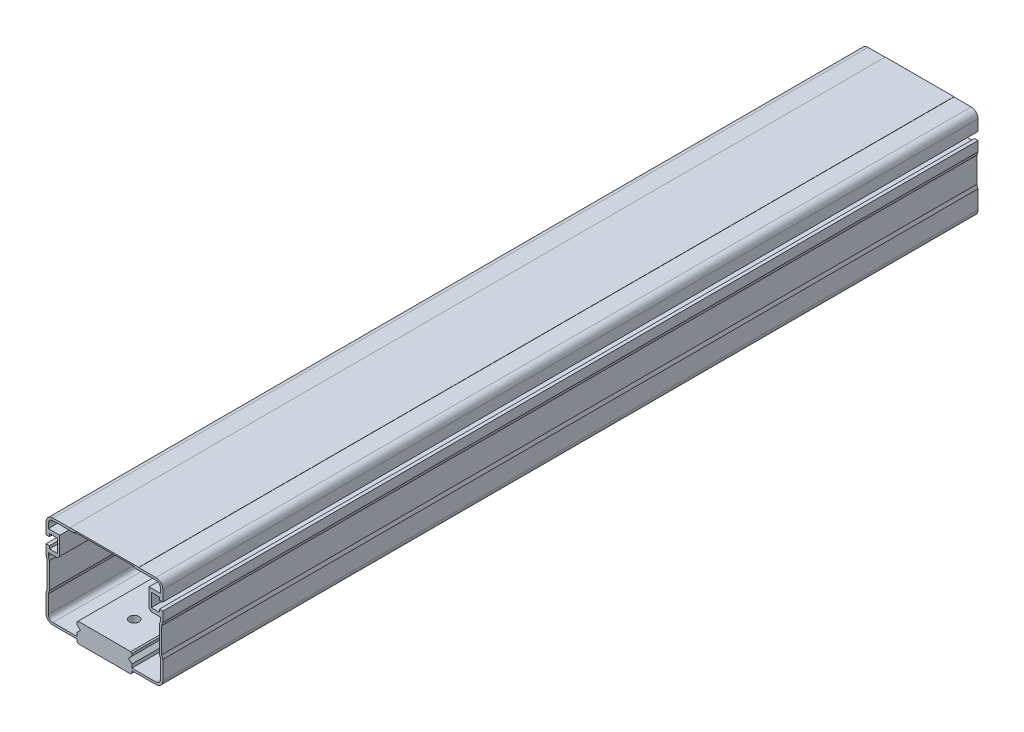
ISO-10303-21;
HEADER;
FILE_DESCRIPTION(('STEP AP214'),'2;1');
FILE_NAME('part.step','',(''),(''),'','','');
FILE_SCHEMA(('AUTOMOTIVE_DESIGN { 1 0 10303 214 1 1 1 1 }'));
ENDSEC;
DATA;
#1=APPLICATION_CONTEXT('core data for automotive mechanical design processes');
#2=APPLICATION_PROTOCOL_DEFINITION('international standard','automotive_design',2000,#1);
#3=PRODUCT_CONTEXT('',#1,'mechanical');
#4=PRODUCT('Part','Part','',(#3));
#5=PRODUCT_RELATED_PRODUCT_CATEGORY('part','',(#4));
#6=PRODUCT_DEFINITION_FORMATION('','',#4);
#7=PRODUCT_DEFINITION_CONTEXT('part definition',#1,'design');
#8=PRODUCT_DEFINITION('design','',#6,#7);
#9=PRODUCT_DEFINITION_SHAPE('','',#8);
#10=(LENGTH_UNIT() NAMED_UNIT(*) SI_UNIT(.MILLI.,.METRE.));
#11=(NAMED_UNIT(*) PLANE_ANGLE_UNIT() SI_UNIT($,.RADIAN.));
#12=(NAMED_UNIT(*) SI_UNIT($,.STERADIAN.) SOLID_ANGLE_UNIT());
#13=UNCERTAINTY_MEASURE_WITH_UNIT(LENGTH_MEASURE(1.E-05),#10,'distance_accuracy_value','');
#14=(GEOMETRIC_REPRESENTATION_CONTEXT(3) GLOBAL_UNCERTAINTY_ASSIGNED_CONTEXT((#13)) GLOBAL_UNIT_ASSIGNED_CONTEXT((#10,
#11,#12)) REPRESENTATION_CONTEXT('',''));
#15=CARTESIAN_POINT('',(0.,0.,0.));
#16=DIRECTION('',(0.,0.,1.));
#17=DIRECTION('',(1.,0.,0.));
#18=AXIS2_PLACEMENT_3D('',#15,#16,#17);
#19=CARTESIAN_POINT('',(22.5000000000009,39.0000000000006,356.));
#20=DIRECTION('',(0.,0.,1.));
#21=DIRECTION('',(1.,0.,0.));
#22=AXIS2_PLACEMENT_3D('',#19,#20,#21);
#23=PLANE('',#22);
#24=CARTESIAN_POINT('',(22.5000000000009,39.0000000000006,356.));
#25=DIRECTION('',(0.,0.,1.));
#26=DIRECTION('',(1.,0.,0.));
#27=AXIS2_PLACEMENT_3D('',#24,#25,#26);
#28=CIRCLE('',#27,3.);
#29=CARTESIAN_POINT('',(25.5000000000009,39.0000000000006,356.));
#30=VERTEX_POINT('',#29);
#31=CARTESIAN_POINT('',(22.5000000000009,42.0000000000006,356.));
#32=VERTEX_POINT('',#31);
#33=EDGE_CURVE('E861',#30,#32,#28,.T.);
#34=ORIENTED_EDGE('',*,*,#33,.T.);
#35=DIRECTION('',(-1.,0.,0.));
#36=VECTOR('',#35,1.);
#37=CARTESIAN_POINT('',(22.5000000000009,42.0000000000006,356.));
#38=LINE('',#37,#36);
#39=CARTESIAN_POINT('',(15.0000000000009,42.0000000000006,356.));
#40=VERTEX_POINT('',#39);
#41=EDGE_CURVE('E864',#32,#40,#38,.T.);
#42=ORIENTED_EDGE('',*,*,#41,.T.);
#43=DIRECTION('',(0.,1.,0.));
#44=VECTOR('',#43,1.);
#45=CARTESIAN_POINT('',(15.0000000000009,42.0000000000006,356.));
#46=LINE('',#45,#44);
#47=CARTESIAN_POINT('',(15.0000000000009,42.1000000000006,356.));
#48=VERTEX_POINT('',#47);
#49=EDGE_CURVE('E867',#40,#48,#46,.T.);
#50=ORIENTED_EDGE('',*,*,#49,.T.);
#51=DIRECTION('',(-1.,0.,0.));
#52=VECTOR('',#51,1.);
#53=CARTESIAN_POINT('',(15.0000000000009,42.1000000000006,356.));
#54=LINE('',#53,#52);
#55=CARTESIAN_POINT('',(-14.9999999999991,42.1000000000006,356.));
#56=VERTEX_POINT('',#55);
#57=EDGE_CURVE('E869',#48,#56,#54,.T.);
#58=ORIENTED_EDGE('',*,*,#57,.T.);
#59=DIRECTION('',(0.,-1.,0.));
#60=VECTOR('',#59,1.);
#61=CARTESIAN_POINT('',(-14.9999999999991,42.1000000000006,356.));
#62=LINE('',#61,#60);
#63=CARTESIAN_POINT('',(-14.9999999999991,42.0000000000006,356.));
#64=VERTEX_POINT('',#63);
#65=EDGE_CURVE('E871',#56,#64,#62,.T.);
#66=ORIENTED_EDGE('',*,*,#65,.T.);
#67=DIRECTION('',(-1.,0.,0.));
#68=VECTOR('',#67,1.);
#69=CARTESIAN_POINT('',(-14.9999999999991,42.0000000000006,356.));
#70=LINE('',#69,#68);
#71=CARTESIAN_POINT('',(-22.4999999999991,42.0000000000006,356.));
#72=VERTEX_POINT('',#71);
#73=EDGE_CURVE('E873',#64,#72,#70,.T.);
#74=ORIENTED_EDGE('',*,*,#73,.T.);
#75=CARTESIAN_POINT('',(-22.4999999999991,39.0000000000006,356.));
#76=DIRECTION('',(0.,0.,1.));
#77=DIRECTION('',(1.,0.,0.));
#78=AXIS2_PLACEMENT_3D('',#75,#76,#77);
#79=CIRCLE('',#78,3.);
#80=CARTESIAN_POINT('',(-25.4999999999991,39.0000000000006,356.));
#81=VERTEX_POINT('',#80);
#82=EDGE_CURVE('E875',#72,#81,#79,.T.);
#83=ORIENTED_EDGE('',*,*,#82,.T.);
#84=DIRECTION('',(0.,-1.,0.));
#85=VECTOR('',#84,1.);
#86=CARTESIAN_POINT('',(-25.4999999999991,39.0000000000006,356.));
#87=LINE('',#86,#85);
#88=CARTESIAN_POINT('',(-25.4999999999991,34.2000000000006,356.));
#89=VERTEX_POINT('',#88);
#90=EDGE_CURVE('E877',#81,#89,#87,.T.);
#91=ORIENTED_EDGE('',*,*,#90,.T.);
#92=DIRECTION('',(1.,0.,0.));
#93=VECTOR('',#92,1.);
#94=CARTESIAN_POINT('',(-25.4999999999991,34.2000000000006,356.));
#95=LINE('',#94,#93);
#96=CARTESIAN_POINT('',(-23.9999999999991,34.2000000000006,356.));
#97=VERTEX_POINT('',#96);
#98=EDGE_CURVE('E879',#89,#97,#95,.T.);
#99=ORIENTED_EDGE('',*,*,#98,.T.);
#100=DIRECTION('',(0.,1.,0.));
#101=VECTOR('',#100,1.);
#102=CARTESIAN_POINT('',(-23.9999999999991,34.2000000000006,356.));
#103=LINE('',#102,#101);
#104=CARTESIAN_POINT('',(-23.9999999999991,35.4000000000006,356.));
#105=VERTEX_POINT('',#104);
#106=EDGE_CURVE('E881',#97,#105,#103,.T.);
#107=ORIENTED_EDGE('',*,*,#106,.T.);
#108=DIRECTION('',(1.,0.,0.));
#109=VECTOR('',#108,1.);
#110=CARTESIAN_POINT('',(-23.9999999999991,35.4000000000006,356.));
#111=LINE('',#110,#109);
#112=CARTESIAN_POINT('',(-20.4999999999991,35.4000000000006,356.));
#113=VERTEX_POINT('',#112);
#114=EDGE_CURVE('E883',#105,#113,#111,.T.);
#115=ORIENTED_EDGE('',*,*,#114,.T.);
#116=DIRECTION('',(0.,-1.,0.));
#117=VECTOR('',#116,1.);
#118=CARTESIAN_POINT('',(-20.4999999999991,35.4000000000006,356.));
#119=LINE('',#118,#117);
#120=CARTESIAN_POINT('',(-20.4999999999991,29.6000000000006,356.));
#121=VERTEX_POINT('',#120);
#122=EDGE_CURVE('E885',#113,#121,#119,.T.);
#123=ORIENTED_EDGE('',*,*,#122,.T.);
#124=DIRECTION('',(-1.,0.,0.));
#125=VECTOR('',#124,1.);
#126=CARTESIAN_POINT('',(-20.4999999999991,29.6000000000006,356.));
#127=LINE('',#126,#125);
#128=CARTESIAN_POINT('',(-23.9999999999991,29.6000000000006,356.));
#129=VERTEX_POINT('',#128);
#130=EDGE_CURVE('E887',#121,#129,#127,.T.);
#131=ORIENTED_EDGE('',*,*,#130,.T.);
#132=DIRECTION('',(0.,1.,0.));
#133=VECTOR('',#132,1.);
#134=CARTESIAN_POINT('',(-23.9999999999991,29.6000000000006,356.));
#135=LINE('',#134,#133);
#136=CARTESIAN_POINT('',(-23.9999999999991,30.8000000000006,356.));
#137=VERTEX_POINT('',#136);
#138=EDGE_CURVE('E889',#129,#137,#135,.T.);
#139=ORIENTED_EDGE('',*,*,#138,.T.);
#140=DIRECTION('',(-1.,0.,0.));
#141=VECTOR('',#140,1.);
#142=CARTESIAN_POINT('',(-23.9999999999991,30.8000000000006,356.));
#143=LINE('',#142,#141);
#144=CARTESIAN_POINT('',(-25.4999999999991,30.8000000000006,356.));
#145=VERTEX_POINT('',#144);
#146=EDGE_CURVE('E891',#137,#145,#143,.T.);
#147=ORIENTED_EDGE('',*,*,#146,.T.);
#148=DIRECTION('',(0.,-1.,0.));
#149=VECTOR('',#148,1.);
#150=CARTESIAN_POINT('',(-25.4999999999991,30.8000000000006,356.));
#151=LINE('',#150,#149);
#152=CARTESIAN_POINT('',(-25.4999999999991,26.500000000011,356.));
#153=VERTEX_POINT('',#152);
#154=EDGE_CURVE('E893',#145,#153,#151,.T.);
#155=ORIENTED_EDGE('',*,*,#154,.T.);
#156=DIRECTION('',(0.316227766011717,-0.948683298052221,0.));
#157=VECTOR('',#156,1.);
#158=CARTESIAN_POINT('',(-25.4999999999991,26.500000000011,356.));
#159=LINE('',#158,#157);
#160=CARTESIAN_POINT('',(-25.0000000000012,24.9999999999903,356.));
#161=VERTEX_POINT('',#160);
#162=EDGE_CURVE('E895',#153,#161,#159,.T.);
#163=ORIENTED_EDGE('',*,*,#162,.T.);
#164=DIRECTION('',(0.,-1.,0.));
#165=VECTOR('',#164,1.);
#166=CARTESIAN_POINT('',(-25.0000000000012,24.9999999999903,356.));
#167=LINE('',#166,#165);
#168=CARTESIAN_POINT('',(-25.0000000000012,14.000000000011,356.));
#169=VERTEX_POINT('',#168);
#170=EDGE_CURVE('E897',#161,#169,#167,.T.);
#171=ORIENTED_EDGE('',*,*,#170,.T.);
#172=DIRECTION('',(-0.316227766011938,-0.948683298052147,0.));
#173=VECTOR('',#172,1.);
#174=CARTESIAN_POINT('',(-25.0000000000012,14.000000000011,356.));
#175=LINE('',#174,#173);
#176=CARTESIAN_POINT('',(-25.4999999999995,12.4999999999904,356.));
#177=VERTEX_POINT('',#176);
#178=EDGE_CURVE('E899',#169,#177,#175,.T.);
#179=ORIENTED_EDGE('',*,*,#178,.T.);
#180=DIRECTION('',(0.,-1.,0.));
#181=VECTOR('',#180,1.);
#182=CARTESIAN_POINT('',(-25.4999999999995,12.4999999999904,356.));
#183=LINE('',#182,#181);
#184=CARTESIAN_POINT('',(-25.4999999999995,4.50000000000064,356.));
#185=VERTEX_POINT('',#184);
#186=EDGE_CURVE('E901',#177,#185,#183,.T.);
#187=ORIENTED_EDGE('',*,*,#186,.T.);
#188=CARTESIAN_POINT('',(-22.4999999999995,4.50000000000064,356.));
#189=DIRECTION('',(0.,0.,1.));
#190=DIRECTION('',(1.,0.,0.));
#191=AXIS2_PLACEMENT_3D('',#188,#189,#190);
#192=CIRCLE('',#191,3.);
#193=CARTESIAN_POINT('',(-22.4999999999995,1.50000000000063,356.));
#194=VERTEX_POINT('',#193);
#195=EDGE_CURVE('E903',#185,#194,#192,.T.);
#196=ORIENTED_EDGE('',*,*,#195,.T.);
#197=DIRECTION('',(1.,0.,0.));
#198=VECTOR('',#197,1.);
#199=CARTESIAN_POINT('',(-22.4999999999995,1.50000000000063,356.));
#200=LINE('',#199,#198);
#201=CARTESIAN_POINT('',(-11.9999999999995,1.50000000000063,356.));
#202=VERTEX_POINT('',#201);
#203=EDGE_CURVE('E905',#194,#202,#200,.T.);
#204=ORIENTED_EDGE('',*,*,#203,.T.);
#205=DIRECTION('',(0.,-1.,0.));
#206=VECTOR('',#205,1.);
#207=CARTESIAN_POINT('',(-11.9999999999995,1.50000000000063,356.));
#208=LINE('',#207,#206);
#209=CARTESIAN_POINT('',(-11.9999999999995,0.499999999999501,356.));
#210=VERTEX_POINT('',#209);
#211=EDGE_CURVE('E907',#202,#210,#208,.T.);
#212=ORIENTED_EDGE('',*,*,#211,.T.);
#213=DIRECTION('',(0.707106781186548,-0.707106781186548,0.));
#214=VECTOR('',#213,1.);
#215=CARTESIAN_POINT('',(-11.9999999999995,0.499999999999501,356.));
#216=LINE('',#215,#214);
#217=CARTESIAN_POINT('',(-11.5,0.,356.));
#218=VERTEX_POINT('',#217);
#219=EDGE_CURVE('E909',#210,#218,#216,.T.);
#220=ORIENTED_EDGE('',*,*,#219,.T.);
#221=DIRECTION('',(1.,0.,0.));
#222=VECTOR('',#221,1.);
#223=CARTESIAN_POINT('',(-11.5,0.,356.));
#224=LINE('',#223,#222);
#225=CARTESIAN_POINT('',(11.5000000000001,3.95516952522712E-13,356.));
#226=VERTEX_POINT('',#225);
#227=EDGE_CURVE('E911',#218,#226,#224,.T.);
#228=ORIENTED_EDGE('',*,*,#227,.T.);
#229=DIRECTION('',(0.707106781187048,0.707106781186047,0.));
#230=VECTOR('',#229,1.);
#231=CARTESIAN_POINT('',(11.5000000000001,3.95516952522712E-13,356.));
#232=LINE('',#231,#230);
#233=CARTESIAN_POINT('',(11.9999999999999,0.499999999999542,356.));
#234=VERTEX_POINT('',#233);
#235=EDGE_CURVE('E913',#226,#234,#232,.T.);
#236=ORIENTED_EDGE('',*,*,#235,.T.);
#237=DIRECTION('',(0.,1.,0.));
#238=VECTOR('',#237,1.);
#239=CARTESIAN_POINT('',(11.9999999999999,0.499999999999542,356.));
#240=LINE('',#239,#238);
#241=CARTESIAN_POINT('',(11.9999999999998,1.50000000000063,356.));
#242=VERTEX_POINT('',#241);
#243=EDGE_CURVE('E915',#234,#242,#240,.T.);
#244=ORIENTED_EDGE('',*,*,#243,.T.);
#245=DIRECTION('',(1.,0.,0.));
#246=VECTOR('',#245,1.);
#247=CARTESIAN_POINT('',(11.9999999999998,1.50000000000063,356.));
#248=LINE('',#247,#246);
#249=CARTESIAN_POINT('',(22.4999999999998,1.50000000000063,356.));
#250=VERTEX_POINT('',#249);
#251=EDGE_CURVE('E917',#242,#250,#248,.T.);
#252=ORIENTED_EDGE('',*,*,#251,.T.);
#253=CARTESIAN_POINT('',(22.4999999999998,4.50000000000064,356.));
#254=DIRECTION('',(0.,0.,1.));
#255=DIRECTION('',(1.,0.,0.));
#256=AXIS2_PLACEMENT_3D('',#253,#254,#255);
#257=CIRCLE('',#256,3.);
#258=CARTESIAN_POINT('',(25.4999999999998,4.50000000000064,356.));
#259=VERTEX_POINT('',#258);
#260=EDGE_CURVE('E919',#250,#259,#257,.T.);
#261=ORIENTED_EDGE('',*,*,#260,.T.);
#262=DIRECTION('',(0.,1.,0.));
#263=VECTOR('',#262,1.);
#264=CARTESIAN_POINT('',(25.4999999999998,4.50000000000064,356.));
#265=LINE('',#264,#263);
#266=CARTESIAN_POINT('',(25.4999999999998,12.4999999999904,356.));
#267=VERTEX_POINT('',#266);
#268=EDGE_CURVE('E921',#259,#267,#265,.T.);
#269=ORIENTED_EDGE('',*,*,#268,.T.);
#270=DIRECTION('',(-0.316227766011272,0.948683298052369,0.));
#271=VECTOR('',#270,1.);
#272=CARTESIAN_POINT('',(25.4999999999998,12.4999999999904,356.));
#273=LINE('',#272,#271);
#274=CARTESIAN_POINT('',(25.0000000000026,14.0000000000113,356.));
#275=VERTEX_POINT('',#274);
#276=EDGE_CURVE('E923',#267,#275,#273,.T.);
#277=ORIENTED_EDGE('',*,*,#276,.T.);
#278=DIRECTION('',(0.,1.,0.));
#279=VECTOR('',#278,1.);
#280=CARTESIAN_POINT('',(25.0000000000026,14.0000000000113,356.));
#281=LINE('',#280,#279);
#282=CARTESIAN_POINT('',(25.0000000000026,24.9999999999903,356.));
#283=VERTEX_POINT('',#282);
#284=EDGE_CURVE('E925',#275,#283,#281,.T.);
#285=ORIENTED_EDGE('',*,*,#284,.T.);
#286=DIRECTION('',(0.316227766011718,0.948683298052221,0.));
#287=VECTOR('',#286,1.);
#288=CARTESIAN_POINT('',(25.0000000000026,24.9999999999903,356.));
#289=LINE('',#288,#287);
#290=CARTESIAN_POINT('',(25.5000000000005,26.500000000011,356.));
#291=VERTEX_POINT('',#290);
#292=EDGE_CURVE('E927',#283,#291,#289,.T.);
#293=ORIENTED_EDGE('',*,*,#292,.T.);
#294=DIRECTION('',(0.,1.,0.));
#295=VECTOR('',#294,1.);
#296=CARTESIAN_POINT('',(25.5000000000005,26.500000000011,356.));
#297=LINE('',#296,#295);
#298=CARTESIAN_POINT('',(25.5000000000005,30.8000000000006,356.));
#299=VERTEX_POINT('',#298);
#300=EDGE_CURVE('E929',#291,#299,#297,.T.);
#301=ORIENTED_EDGE('',*,*,#300,.T.);
#302=DIRECTION('',(-1.,0.,0.));
#303=VECTOR('',#302,1.);
#304=CARTESIAN_POINT('',(25.5000000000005,30.8000000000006,356.));
#305=LINE('',#304,#303);
#306=CARTESIAN_POINT('',(24.0000000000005,30.8000000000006,356.));
#307=VERTEX_POINT('',#306);
#308=EDGE_CURVE('E931',#299,#307,#305,.T.);
#309=ORIENTED_EDGE('',*,*,#308,.T.);
#310=DIRECTION('',(0.,-1.,0.));
#311=VECTOR('',#310,1.);
#312=CARTESIAN_POINT('',(24.0000000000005,30.8000000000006,356.));
#313=LINE('',#312,#311);
#314=CARTESIAN_POINT('',(24.0000000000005,29.6000000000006,356.));
#315=VERTEX_POINT('',#314);
#316=EDGE_CURVE('E933',#307,#315,#313,.T.);
#317=ORIENTED_EDGE('',*,*,#316,.T.);
#318=DIRECTION('',(-1.,0.,0.));
#319=VECTOR('',#318,1.);
#320=CARTESIAN_POINT('',(24.0000000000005,29.6000000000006,356.));
#321=LINE('',#320,#319);
#322=CARTESIAN_POINT('',(20.5000000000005,29.6000000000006,356.));
#323=VERTEX_POINT('',#322);
#324=EDGE_CURVE('E935',#315,#323,#321,.T.);
#325=ORIENTED_EDGE('',*,*,#324,.T.);
#326=DIRECTION('',(0.,1.,0.));
#327=VECTOR('',#326,1.);
#328=CARTESIAN_POINT('',(20.5000000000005,29.6000000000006,356.));
#329=LINE('',#328,#327);
#330=CARTESIAN_POINT('',(20.5000000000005,35.4000000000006,356.));
#331=VERTEX_POINT('',#330);
#332=EDGE_CURVE('E937',#323,#331,#329,.T.);
#333=ORIENTED_EDGE('',*,*,#332,.T.);
#334=DIRECTION('',(1.,0.,0.));
#335=VECTOR('',#334,1.);
#336=CARTESIAN_POINT('',(20.5000000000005,35.4000000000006,356.));
#337=LINE('',#336,#335);
#338=CARTESIAN_POINT('',(24.0000000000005,35.4000000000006,356.));
#339=VERTEX_POINT('',#338);
#340=EDGE_CURVE('E939',#331,#339,#337,.T.);
#341=ORIENTED_EDGE('',*,*,#340,.T.);
#342=DIRECTION('',(0.,-1.,0.));
#343=VECTOR('',#342,1.);
#344=CARTESIAN_POINT('',(24.0000000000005,35.4000000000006,356.));
#345=LINE('',#344,#343);
#346=CARTESIAN_POINT('',(24.0000000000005,34.2000000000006,356.));
#347=VERTEX_POINT('',#346);
#348=EDGE_CURVE('E941',#339,#347,#345,.T.);
#349=ORIENTED_EDGE('',*,*,#348,.T.);
#350=DIRECTION('',(1.,0.,0.));
#351=VECTOR('',#350,1.);
#352=CARTESIAN_POINT('',(24.0000000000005,34.2000000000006,356.));
#353=LINE('',#352,#351);
#354=CARTESIAN_POINT('',(25.5000000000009,34.2000000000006,356.));
#355=VERTEX_POINT('',#354);
#356=EDGE_CURVE('E943',#347,#355,#353,.T.);
#357=ORIENTED_EDGE('',*,*,#356,.T.);
#358=DIRECTION('',(0.,1.,0.));
#359=VECTOR('',#358,1.);
#360=CARTESIAN_POINT('',(25.5000000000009,34.2000000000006,356.));
#361=LINE('',#360,#359);
#362=EDGE_CURVE('E945',#355,#30,#361,.T.);
#363=ORIENTED_EDGE('',*,*,#362,.T.);
#364=EDGE_LOOP('',(#34,#42,#50,#58,#66,#74,#83,#91,#99,#107,#115,#123,#131,#139,#147,#155,#163,
#171,#179,#187,#196,#204,#212,#220,#228,#236,#244,#252,#261,#269,#277,#285,#293,#301,#309,#317,
#325,#333,#341,#349,#357,#363));
#365=FACE_BOUND('',#364,.T.);
#366=DIRECTION('',(0.,1.,0.));
#367=VECTOR('',#366,1.);
#368=CARTESIAN_POINT('',(24.4999999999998,4.50000000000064,356.));
#369=LINE('',#368,#367);
#370=CARTESIAN_POINT('',(24.4999999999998,4.50000000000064,356.));
#371=VERTEX_POINT('',#370);
#372=CARTESIAN_POINT('',(24.4999999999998,12.3377223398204,356.));
#373=VERTEX_POINT('',#372);
#374=EDGE_CURVE('E564',#371,#373,#369,.T.);
#375=ORIENTED_EDGE('',*,*,#374,.F.);
#376=CARTESIAN_POINT('',(22.4999999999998,4.50000000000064,356.));
#377=DIRECTION('',(0.,0.,1.));
#378=DIRECTION('',(1.,0.,0.));
#379=AXIS2_PLACEMENT_3D('',#376,#377,#378);
#380=CIRCLE('',#379,2.);
#381=CARTESIAN_POINT('',(22.4999999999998,2.50000000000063,356.));
#382=VERTEX_POINT('',#381);
#383=EDGE_CURVE('E556',#382,#371,#380,.T.);
#384=ORIENTED_EDGE('',*,*,#383,.F.);
#385=DIRECTION('',(1.,0.,0.));
#386=VECTOR('',#385,1.);
#387=CARTESIAN_POINT('',(11.9999999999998,2.50000000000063,356.));
#388=LINE('',#387,#386);
#389=CARTESIAN_POINT('',(11.9999999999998,2.50000000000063,356.));
#390=VERTEX_POINT('',#389);
#391=EDGE_CURVE('E658',#390,#382,#388,.T.);
#392=ORIENTED_EDGE('',*,*,#391,.F.);
#393=DIRECTION('',(0.,-1.,0.));
#394=VECTOR('',#393,1.);
#395=CARTESIAN_POINT('',(11.9999999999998,4.00000000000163,356.));
#396=LINE('',#395,#394);
#397=CARTESIAN_POINT('',(11.9999999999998,4.00000000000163,356.));
#398=VERTEX_POINT('',#397);
#399=EDGE_CURVE('E656',#398,#390,#396,.T.);
#400=ORIENTED_EDGE('',*,*,#399,.F.);
#401=DIRECTION('',(0.707106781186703,-0.707106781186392,0.));
#402=VECTOR('',#401,1.);
#403=CARTESIAN_POINT('',(10.5000000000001,5.50000000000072,356.));
#404=LINE('',#403,#402);
#405=CARTESIAN_POINT('',(10.5000000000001,5.50000000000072,356.));
#406=VERTEX_POINT('',#405);
#407=EDGE_CURVE('E654',#406,#398,#404,.T.);
#408=ORIENTED_EDGE('',*,*,#407,.F.);
#409=DIRECTION('',(-0.707106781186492,-0.707106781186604,0.));
#410=VECTOR('',#409,1.);
#411=CARTESIAN_POINT('',(11.9999999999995,7.00000000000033,356.));
#412=LINE('',#411,#410);
#413=CARTESIAN_POINT('',(11.9999999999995,7.00000000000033,356.));
#414=VERTEX_POINT('',#413);
#415=EDGE_CURVE('E652',#414,#406,#412,.T.);
#416=ORIENTED_EDGE('',*,*,#415,.F.);
#417=DIRECTION('',(0.,-1.,0.));
#418=VECTOR('',#417,1.);
#419=CARTESIAN_POINT('',(11.9999999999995,8.00000000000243,356.));
#420=LINE('',#419,#418);
#421=CARTESIAN_POINT('',(11.9999999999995,8.00000000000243,356.));
#422=VERTEX_POINT('',#421);
#423=EDGE_CURVE('E650',#422,#414,#420,.T.);
#424=ORIENTED_EDGE('',*,*,#423,.F.);
#425=DIRECTION('',(0.707106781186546,-0.707106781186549,0.));
#426=VECTOR('',#425,1.);
#427=CARTESIAN_POINT('',(11.5,8.50000000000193,356.));
#428=LINE('',#427,#426);
#429=CARTESIAN_POINT('',(11.5,8.50000000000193,356.));
#430=VERTEX_POINT('',#429);
#431=EDGE_CURVE('E648',#430,#422,#428,.T.);
#432=ORIENTED_EDGE('',*,*,#431,.F.);
#433=DIRECTION('',(1.,0.,0.));
#434=VECTOR('',#433,1.);
#435=CARTESIAN_POINT('',(-11.5000000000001,8.50000000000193,356.));
#436=LINE('',#435,#434);
#437=CARTESIAN_POINT('',(-11.5000000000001,8.50000000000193,356.));
#438=VERTEX_POINT('',#437);
#439=EDGE_CURVE('E646',#438,#430,#436,.T.);
#440=ORIENTED_EDGE('',*,*,#439,.F.);
#441=DIRECTION('',(0.707106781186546,0.707106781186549,0.));
#442=VECTOR('',#441,1.);
#443=CARTESIAN_POINT('',(-11.9999999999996,8.00000000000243,356.));
#444=LINE('',#443,#442);
#445=CARTESIAN_POINT('',(-11.9999999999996,8.00000000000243,356.));
#446=VERTEX_POINT('',#445);
#447=EDGE_CURVE('E644',#446,#438,#444,.T.);
#448=ORIENTED_EDGE('',*,*,#447,.F.);
#449=DIRECTION('',(0.,1.,0.));
#450=VECTOR('',#449,1.);
#451=CARTESIAN_POINT('',(-11.9999999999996,7.00000000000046,356.));
#452=LINE('',#451,#450);
#453=CARTESIAN_POINT('',(-11.9999999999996,7.00000000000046,356.));
#454=VERTEX_POINT('',#453);
#455=EDGE_CURVE('E642',#454,#446,#452,.T.);
#456=ORIENTED_EDGE('',*,*,#455,.F.);
#457=DIRECTION('',(-0.707106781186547,0.707106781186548,0.));
#458=VECTOR('',#457,1.);
#459=CARTESIAN_POINT('',(-10.5000000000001,5.50000000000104,356.));
#460=LINE('',#459,#458);
#461=CARTESIAN_POINT('',(-10.5000000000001,5.50000000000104,356.));
#462=VERTEX_POINT('',#461);
#463=EDGE_CURVE('E640',#462,#454,#460,.T.);
#464=ORIENTED_EDGE('',*,*,#463,.F.);
#465=DIRECTION('',(0.707106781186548,0.707106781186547,0.));
#466=VECTOR('',#465,1.);
#467=CARTESIAN_POINT('',(-11.9999999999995,4.00000000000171,356.));
#468=LINE('',#467,#466);
#469=CARTESIAN_POINT('',(-11.9999999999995,4.00000000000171,356.));
#470=VERTEX_POINT('',#469);
#471=EDGE_CURVE('E638',#470,#462,#468,.T.);
#472=ORIENTED_EDGE('',*,*,#471,.F.);
#473=DIRECTION('',(0.,1.,0.));
#474=VECTOR('',#473,1.);
#475=CARTESIAN_POINT('',(-11.9999999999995,2.50000000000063,356.));
#476=LINE('',#475,#474);
#477=CARTESIAN_POINT('',(-11.9999999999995,2.50000000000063,356.));
#478=VERTEX_POINT('',#477);
#479=EDGE_CURVE('E636',#478,#470,#476,.T.);
#480=ORIENTED_EDGE('',*,*,#479,.F.);
#481=DIRECTION('',(1.,0.,0.));
#482=VECTOR('',#481,1.);
#483=CARTESIAN_POINT('',(-22.4999999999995,2.50000000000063,356.));
#484=LINE('',#483,#482);
#485=CARTESIAN_POINT('',(-22.4999999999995,2.50000000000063,356.));
#486=VERTEX_POINT('',#485);
#487=EDGE_CURVE('E634',#486,#478,#484,.T.);
#488=ORIENTED_EDGE('',*,*,#487,.F.);
#489=CARTESIAN_POINT('',(-22.4999999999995,4.50000000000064,356.));
#490=DIRECTION('',(0.,0.,1.));
#491=DIRECTION('',(1.,0.,0.));
#492=AXIS2_PLACEMENT_3D('',#489,#490,#491);
#493=CIRCLE('',#492,2.);
#494=CARTESIAN_POINT('',(-24.4999999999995,4.50000000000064,356.));
#495=VERTEX_POINT('',#494);
#496=EDGE_CURVE('E632',#495,#486,#493,.T.);
#497=ORIENTED_EDGE('',*,*,#496,.F.);
#498=DIRECTION('',(0.,-1.,0.));
#499=VECTOR('',#498,1.);
#500=CARTESIAN_POINT('',(-24.4999999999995,12.3377223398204,356.));
#501=LINE('',#500,#499);
#502=CARTESIAN_POINT('',(-24.4999999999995,12.3377223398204,356.));
#503=VERTEX_POINT('',#502);
#504=EDGE_CURVE('E630',#503,#495,#501,.T.);
#505=ORIENTED_EDGE('',*,*,#504,.F.);
#506=DIRECTION('',(-0.316227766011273,-0.948683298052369,0.));
#507=VECTOR('',#506,1.);
#508=CARTESIAN_POINT('',(-24.0000000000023,13.8377223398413,356.));
#509=LINE('',#508,#507);
#510=CARTESIAN_POINT('',(-24.0000000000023,13.8377223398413,356.));
#511=VERTEX_POINT('',#510);
#512=EDGE_CURVE('E628',#511,#503,#509,.T.);
#513=ORIENTED_EDGE('',*,*,#512,.F.);
#514=DIRECTION('',(0.,-1.,0.));
#515=VECTOR('',#514,1.);
#516=CARTESIAN_POINT('',(-24.0000000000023,25.1622776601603,356.));
#517=LINE('',#516,#515);
#518=CARTESIAN_POINT('',(-24.0000000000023,25.1622776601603,356.));
#519=VERTEX_POINT('',#518);
#520=EDGE_CURVE('E626',#519,#511,#517,.T.);
#521=ORIENTED_EDGE('',*,*,#520,.F.);
#522=DIRECTION('',(0.316227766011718,-0.948683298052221,0.));
#523=VECTOR('',#522,1.);
#524=CARTESIAN_POINT('',(-24.5000000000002,26.662277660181,356.));
#525=LINE('',#524,#523);
#526=CARTESIAN_POINT('',(-24.5000000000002,26.662277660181,356.));
#527=VERTEX_POINT('',#526);
#528=EDGE_CURVE('E624',#527,#519,#525,.T.);
#529=ORIENTED_EDGE('',*,*,#528,.F.);
#530=DIRECTION('',(0.,-1.,0.));
#531=VECTOR('',#530,1.);
#532=CARTESIAN_POINT('',(-24.5000000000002,28.0000000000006,356.));
#533=LINE('',#532,#531);
#534=CARTESIAN_POINT('',(-24.5000000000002,28.0000000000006,356.));
#535=VERTEX_POINT('',#534);
#536=EDGE_CURVE('E622',#535,#527,#533,.T.);
#537=ORIENTED_EDGE('',*,*,#536,.F.);
#538=DIRECTION('',(-1.,0.,0.));
#539=VECTOR('',#538,1.);
#540=CARTESIAN_POINT('',(-20.5000000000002,28.0000000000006,356.));
#541=LINE('',#540,#539);
#542=CARTESIAN_POINT('',(-20.5000000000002,28.0000000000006,356.));
#543=VERTEX_POINT('',#542);
#544=EDGE_CURVE('E620',#543,#535,#541,.T.);
#545=ORIENTED_EDGE('',*,*,#544,.F.);
#546=DIRECTION('',(-0.707106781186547,-0.707106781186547,0.));
#547=VECTOR('',#546,1.);
#548=CARTESIAN_POINT('',(-19.5000000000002,29.0000000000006,356.));
#549=LINE('',#548,#547);
#550=CARTESIAN_POINT('',(-19.5000000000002,29.0000000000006,356.));
#551=VERTEX_POINT('',#550);
#552=EDGE_CURVE('E618',#551,#543,#549,.T.);
#553=ORIENTED_EDGE('',*,*,#552,.F.);
#554=DIRECTION('',(0.,-1.,0.));
#555=VECTOR('',#554,1.);
#556=CARTESIAN_POINT('',(-19.5000000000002,37.0000000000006,356.));
#557=LINE('',#556,#555);
#558=CARTESIAN_POINT('',(-19.5000000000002,37.0000000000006,356.));
#559=VERTEX_POINT('',#558);
#560=EDGE_CURVE('E616',#559,#551,#557,.T.);
#561=ORIENTED_EDGE('',*,*,#560,.F.);
#562=DIRECTION('',(1.,0.,0.));
#563=VECTOR('',#562,1.);
#564=CARTESIAN_POINT('',(-24.5000000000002,37.0000000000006,356.));
#565=LINE('',#564,#563);
#566=CARTESIAN_POINT('',(-24.5000000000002,37.0000000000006,356.));
#567=VERTEX_POINT('',#566);
#568=EDGE_CURVE('E614',#567,#559,#565,.T.);
#569=ORIENTED_EDGE('',*,*,#568,.F.);
#570=DIRECTION('',(0.,-1.,0.));
#571=VECTOR('',#570,1.);
#572=CARTESIAN_POINT('',(-24.5000000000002,39.0000000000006,356.));
#573=LINE('',#572,#571);
#574=CARTESIAN_POINT('',(-24.5000000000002,39.0000000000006,356.));
#575=VERTEX_POINT('',#574);
#576=EDGE_CURVE('E612',#575,#567,#573,.T.);
#577=ORIENTED_EDGE('',*,*,#576,.F.);
#578=CARTESIAN_POINT('',(-22.5000000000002,39.0000000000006,356.));
#579=DIRECTION('',(0.,0.,1.));
#580=DIRECTION('',(1.,0.,0.));
#581=AXIS2_PLACEMENT_3D('',#578,#579,#580);
#582=CIRCLE('',#581,2.);
#583=CARTESIAN_POINT('',(-22.5000000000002,41.0000000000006,356.));
#584=VERTEX_POINT('',#583);
#585=EDGE_CURVE('E610',#584,#575,#582,.T.);
#586=ORIENTED_EDGE('',*,*,#585,.F.);
#587=DIRECTION('',(-1.,0.,0.));
#588=VECTOR('',#587,1.);
#589=CARTESIAN_POINT('',(-13.0000000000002,41.0000000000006,356.));
#590=LINE('',#589,#588);
#591=CARTESIAN_POINT('',(-13.0000000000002,41.0000000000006,356.));
#592=VERTEX_POINT('',#591);
#593=EDGE_CURVE('E608',#592,#584,#590,.T.);
#594=ORIENTED_EDGE('',*,*,#593,.F.);
#595=DIRECTION('',(0.,-1.,0.));
#596=VECTOR('',#595,1.);
#597=CARTESIAN_POINT('',(-13.0000000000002,41.5000000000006,356.));
#598=LINE('',#597,#596);
#599=CARTESIAN_POINT('',(-13.0000000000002,41.5000000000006,356.));
#600=VERTEX_POINT('',#599);
#601=EDGE_CURVE('E606',#600,#592,#598,.T.);
#602=ORIENTED_EDGE('',*,*,#601,.F.);
#603=DIRECTION('',(-1.,0.,0.));
#604=VECTOR('',#603,1.);
#605=CARTESIAN_POINT('',(12.9999999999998,41.5000000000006,356.));
#606=LINE('',#605,#604);
#607=CARTESIAN_POINT('',(12.9999999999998,41.5000000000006,356.));
#608=VERTEX_POINT('',#607);
#609=EDGE_CURVE('E604',#608,#600,#606,.T.);
#610=ORIENTED_EDGE('',*,*,#609,.F.);
#611=DIRECTION('',(0.,1.,0.));
#612=VECTOR('',#611,1.);
#613=CARTESIAN_POINT('',(12.9999999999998,41.0000000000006,356.));
#614=LINE('',#613,#612);
#615=CARTESIAN_POINT('',(12.9999999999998,41.0000000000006,356.));
#616=VERTEX_POINT('',#615);
#617=EDGE_CURVE('E602',#616,#608,#614,.T.);
#618=ORIENTED_EDGE('',*,*,#617,.F.);
#619=DIRECTION('',(-1.,0.,0.));
#620=VECTOR('',#619,1.);
#621=CARTESIAN_POINT('',(22.4999999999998,41.0000000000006,356.));
#622=LINE('',#621,#620);
#623=CARTESIAN_POINT('',(22.4999999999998,41.0000000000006,356.));
#624=VERTEX_POINT('',#623);
#625=EDGE_CURVE('E600',#624,#616,#622,.T.);
#626=ORIENTED_EDGE('',*,*,#625,.F.);
#627=CARTESIAN_POINT('',(22.4999999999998,39.0000000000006,356.));
#628=DIRECTION('',(0.,0.,1.));
#629=DIRECTION('',(1.,0.,0.));
#630=AXIS2_PLACEMENT_3D('',#627,#628,#629);
#631=CIRCLE('',#630,2.);
#632=CARTESIAN_POINT('',(24.4999999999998,39.0000000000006,356.));
#633=VERTEX_POINT('',#632);
#634=EDGE_CURVE('E598',#633,#624,#631,.T.);
#635=ORIENTED_EDGE('',*,*,#634,.F.);
#636=DIRECTION('',(0.,1.,0.));
#637=VECTOR('',#636,1.);
#638=CARTESIAN_POINT('',(24.4999999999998,37.0000000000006,356.));
#639=LINE('',#638,#637);
#640=CARTESIAN_POINT('',(24.4999999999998,37.0000000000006,356.));
#641=VERTEX_POINT('',#640);
#642=EDGE_CURVE('E596',#641,#633,#639,.T.);
#643=ORIENTED_EDGE('',*,*,#642,.F.);
#644=DIRECTION('',(1.,0.,0.));
#645=VECTOR('',#644,1.);
#646=CARTESIAN_POINT('',(19.4999999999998,37.0000000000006,356.));
#647=LINE('',#646,#645);
#648=CARTESIAN_POINT('',(19.4999999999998,37.0000000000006,356.));
#649=VERTEX_POINT('',#648);
#650=EDGE_CURVE('E594',#649,#641,#647,.T.);
#651=ORIENTED_EDGE('',*,*,#650,.F.);
#652=DIRECTION('',(0.,1.,0.));
#653=VECTOR('',#652,1.);
#654=CARTESIAN_POINT('',(19.4999999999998,29.0000000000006,356.));
#655=LINE('',#654,#653);
#656=CARTESIAN_POINT('',(19.4999999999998,29.0000000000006,356.));
#657=VERTEX_POINT('',#656);
#658=EDGE_CURVE('E592',#657,#649,#655,.T.);
#659=ORIENTED_EDGE('',*,*,#658,.F.);
#660=DIRECTION('',(-0.707106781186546,0.707106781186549,0.));
#661=VECTOR('',#660,1.);
#662=CARTESIAN_POINT('',(20.4999999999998,28.0000000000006,356.));
#663=LINE('',#662,#661);
#664=CARTESIAN_POINT('',(20.4999999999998,28.0000000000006,356.));
#665=VERTEX_POINT('',#664);
#666=EDGE_CURVE('E590',#665,#657,#663,.T.);
#667=ORIENTED_EDGE('',*,*,#666,.F.);
#668=DIRECTION('',(-1.,0.,0.));
#669=VECTOR('',#668,1.);
#670=CARTESIAN_POINT('',(24.4999999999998,28.0000000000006,356.));
#671=LINE('',#670,#669);
#672=CARTESIAN_POINT('',(24.4999999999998,28.0000000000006,356.));
#673=VERTEX_POINT('',#672);
#674=EDGE_CURVE('E588',#673,#665,#671,.T.);
#675=ORIENTED_EDGE('',*,*,#674,.F.);
#676=DIRECTION('',(-1.32270942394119E-13,1.,0.));
#677=VECTOR('',#676,1.);
#678=CARTESIAN_POINT('',(24.5,26.6622776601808,356.));
#679=LINE('',#678,#677);
#680=CARTESIAN_POINT('',(24.5,26.6622776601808,356.));
#681=VERTEX_POINT('',#680);
#682=EDGE_CURVE('E586',#681,#673,#679,.T.);
#683=ORIENTED_EDGE('',*,*,#682,.F.);
#684=DIRECTION('',(0.316227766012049,0.94868329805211,0.));
#685=VECTOR('',#684,1.);
#686=CARTESIAN_POINT('',(24.0000000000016,25.1622776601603,356.));
#687=LINE('',#686,#685);
#688=CARTESIAN_POINT('',(24.0000000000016,25.1622776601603,356.));
#689=VERTEX_POINT('',#688);
#690=EDGE_CURVE('E584',#689,#681,#687,.T.);
#691=ORIENTED_EDGE('',*,*,#690,.F.);
#692=DIRECTION('',(0.,1.,0.));
#693=VECTOR('',#692,1.);
#694=CARTESIAN_POINT('',(24.0000000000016,13.837722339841,356.));
#695=LINE('',#694,#693);
#696=CARTESIAN_POINT('',(24.0000000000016,13.837722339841,356.));
#697=VERTEX_POINT('',#696);
#698=EDGE_CURVE('E579',#697,#689,#695,.T.);
#699=ORIENTED_EDGE('',*,*,#698,.F.);
#700=DIRECTION('',(-0.316227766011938,0.948683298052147,0.));
#701=VECTOR('',#700,1.);
#702=CARTESIAN_POINT('',(24.4999999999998,12.3377223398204,356.));
#703=LINE('',#702,#701);
#704=EDGE_CURVE('E577',#373,#697,#703,.T.);
#705=ORIENTED_EDGE('',*,*,#704,.F.);
#706=EDGE_LOOP('',(#375,#384,#392,#400,#408,#416,#424,#432,#440,#448,#456,#464,#472,#480,#488,
#497,#505,#513,#521,#529,#537,#545,#553,#561,#569,#577,#586,#594,#602,#610,#618,#626,#635,#643,
#651,#659,#667,#675,#683,#691,#699,#705));
#707=FACE_BOUND('',#706,.T.);
#708=ADVANCED_FACE('F35',(#365,#707),#23,.T.);
#709=CARTESIAN_POINT('',(22.5000000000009,39.0000000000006,0.));
#710=DIRECTION('',(0.,0.,1.));
#711=DIRECTION('',(1.,0.,0.));
#712=AXIS2_PLACEMENT_3D('',#709,#710,#711);
#713=PLANE('',#712);
#714=CARTESIAN_POINT('',(22.5000000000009,39.0000000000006,0.));
#715=DIRECTION('',(0.,0.,1.));
#716=DIRECTION('',(1.,0.,0.));
#717=AXIS2_PLACEMENT_3D('',#714,#715,#716);
#718=CIRCLE('',#717,3.);
#719=CARTESIAN_POINT('',(25.5000000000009,39.0000000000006,0.));
#720=VERTEX_POINT('',#719);
#721=CARTESIAN_POINT('',(22.5000000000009,42.0000000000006,0.));
#722=VERTEX_POINT('',#721);
#723=EDGE_CURVE('E572',#720,#722,#718,.T.);
#724=ORIENTED_EDGE('',*,*,#723,.F.);
#725=DIRECTION('',(0.,1.,0.));
#726=VECTOR('',#725,1.);
#727=CARTESIAN_POINT('',(25.5000000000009,34.2000000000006,0.));
#728=LINE('',#727,#726);
#729=CARTESIAN_POINT('',(25.5000000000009,34.2000000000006,0.));
#730=VERTEX_POINT('',#729);
#731=EDGE_CURVE('E865',#730,#720,#728,.T.);
#732=ORIENTED_EDGE('',*,*,#731,.F.);
#733=DIRECTION('',(1.,0.,0.));
#734=VECTOR('',#733,1.);
#735=CARTESIAN_POINT('',(24.0000000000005,34.2000000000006,0.));
#736=LINE('',#735,#734);
#737=CARTESIAN_POINT('',(24.0000000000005,34.2000000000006,0.));
#738=VERTEX_POINT('',#737);
#739=EDGE_CURVE('E1028',#738,#730,#736,.T.);
#740=ORIENTED_EDGE('',*,*,#739,.F.);
#741=DIRECTION('',(0.,-1.,0.));
#742=VECTOR('',#741,1.);
#743=CARTESIAN_POINT('',(24.0000000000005,35.4000000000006,0.));
#744=LINE('',#743,#742);
#745=CARTESIAN_POINT('',(24.0000000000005,35.4000000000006,0.));
#746=VERTEX_POINT('',#745);
#747=EDGE_CURVE('E1026',#746,#738,#744,.T.);
#748=ORIENTED_EDGE('',*,*,#747,.F.);
#749=DIRECTION('',(1.,0.,0.));
#750=VECTOR('',#749,1.);
#751=CARTESIAN_POINT('',(20.5000000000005,35.4000000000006,0.));
#752=LINE('',#751,#750);
#753=CARTESIAN_POINT('',(20.5000000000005,35.4000000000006,0.));
#754=VERTEX_POINT('',#753);
#755=EDGE_CURVE('E1024',#754,#746,#752,.T.);
#756=ORIENTED_EDGE('',*,*,#755,.F.);
#757=DIRECTION('',(0.,1.,0.));
#758=VECTOR('',#757,1.);
#759=CARTESIAN_POINT('',(20.5000000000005,29.6000000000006,0.));
#760=LINE('',#759,#758);
#761=CARTESIAN_POINT('',(20.5000000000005,29.6000000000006,0.));
#762=VERTEX_POINT('',#761);
#763=EDGE_CURVE('E1022',#762,#754,#760,.T.);
#764=ORIENTED_EDGE('',*,*,#763,.F.);
#765=DIRECTION('',(-1.,0.,0.));
#766=VECTOR('',#765,1.);
#767=CARTESIAN_POINT('',(24.0000000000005,29.6000000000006,0.));
#768=LINE('',#767,#766);
#769=CARTESIAN_POINT('',(24.0000000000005,29.6000000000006,0.));
#770=VERTEX_POINT('',#769);
#771=EDGE_CURVE('E1020',#770,#762,#768,.T.);
#772=ORIENTED_EDGE('',*,*,#771,.F.);
#773=DIRECTION('',(0.,-1.,0.));
#774=VECTOR('',#773,1.);
#775=CARTESIAN_POINT('',(24.0000000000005,30.8000000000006,0.));
#776=LINE('',#775,#774);
#777=CARTESIAN_POINT('',(24.0000000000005,30.8000000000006,0.));
#778=VERTEX_POINT('',#777);
#779=EDGE_CURVE('E1018',#778,#770,#776,.T.);
#780=ORIENTED_EDGE('',*,*,#779,.F.);
#781=DIRECTION('',(-1.,0.,0.));
#782=VECTOR('',#781,1.);
#783=CARTESIAN_POINT('',(25.5000000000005,30.8000000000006,0.));
#784=LINE('',#783,#782);
#785=CARTESIAN_POINT('',(25.5000000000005,30.8000000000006,0.));
#786=VERTEX_POINT('',#785);
#787=EDGE_CURVE('E1016',#786,#778,#784,.T.);
#788=ORIENTED_EDGE('',*,*,#787,.F.);
#789=DIRECTION('',(0.,1.,0.));
#790=VECTOR('',#789,1.);
#791=CARTESIAN_POINT('',(25.5000000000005,26.500000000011,0.));
#792=LINE('',#791,#790);
#793=CARTESIAN_POINT('',(25.5000000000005,26.500000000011,0.));
#794=VERTEX_POINT('',#793);
#795=EDGE_CURVE('E1014',#794,#786,#792,.T.);
#796=ORIENTED_EDGE('',*,*,#795,.F.);
#797=DIRECTION('',(0.316227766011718,0.948683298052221,0.));
#798=VECTOR('',#797,1.);
#799=CARTESIAN_POINT('',(25.0000000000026,24.9999999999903,0.));
#800=LINE('',#799,#798);
#801=CARTESIAN_POINT('',(25.0000000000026,24.9999999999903,0.));
#802=VERTEX_POINT('',#801);
#803=EDGE_CURVE('E1012',#802,#794,#800,.T.);
#804=ORIENTED_EDGE('',*,*,#803,.F.);
#805=DIRECTION('',(0.,1.,0.));
#806=VECTOR('',#805,1.);
#807=CARTESIAN_POINT('',(25.0000000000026,14.0000000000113,0.));
#808=LINE('',#807,#806);
#809=CARTESIAN_POINT('',(25.0000000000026,14.0000000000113,0.));
#810=VERTEX_POINT('',#809);
#811=EDGE_CURVE('E1010',#810,#802,#808,.T.);
#812=ORIENTED_EDGE('',*,*,#811,.F.);
#813=DIRECTION('',(-0.316227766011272,0.948683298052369,0.));
#814=VECTOR('',#813,1.);
#815=CARTESIAN_POINT('',(25.4999999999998,12.4999999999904,0.));
#816=LINE('',#815,#814);
#817=CARTESIAN_POINT('',(25.4999999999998,12.4999999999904,0.));
#818=VERTEX_POINT('',#817);
#819=EDGE_CURVE('E1008',#818,#810,#816,.T.);
#820=ORIENTED_EDGE('',*,*,#819,.F.);
#821=DIRECTION('',(0.,1.,0.));
#822=VECTOR('',#821,1.);
#823=CARTESIAN_POINT('',(25.4999999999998,4.50000000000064,0.));
#824=LINE('',#823,#822);
#825=CARTESIAN_POINT('',(25.4999999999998,4.50000000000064,0.));
#826=VERTEX_POINT('',#825);
#827=EDGE_CURVE('E1006',#826,#818,#824,.T.);
#828=ORIENTED_EDGE('',*,*,#827,.F.);
#829=CARTESIAN_POINT('',(22.4999999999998,4.50000000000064,0.));
#830=DIRECTION('',(0.,0.,1.));
#831=DIRECTION('',(1.,0.,0.));
#832=AXIS2_PLACEMENT_3D('',#829,#830,#831);
#833=CIRCLE('',#832,3.);
#834=CARTESIAN_POINT('',(22.4999999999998,1.50000000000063,0.));
#835=VERTEX_POINT('',#834);
#836=EDGE_CURVE('E1004',#835,#826,#833,.T.);
#837=ORIENTED_EDGE('',*,*,#836,.F.);
#838=DIRECTION('',(1.,0.,0.));
#839=VECTOR('',#838,1.);
#840=CARTESIAN_POINT('',(11.9999999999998,1.50000000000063,0.));
#841=LINE('',#840,#839);
#842=CARTESIAN_POINT('',(11.9999999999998,1.50000000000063,0.));
#843=VERTEX_POINT('',#842);
#844=EDGE_CURVE('E1002',#843,#835,#841,.T.);
#845=ORIENTED_EDGE('',*,*,#844,.F.);
#846=DIRECTION('',(0.,1.,0.));
#847=VECTOR('',#846,1.);
#848=CARTESIAN_POINT('',(11.9999999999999,0.499999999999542,0.));
#849=LINE('',#848,#847);
#850=CARTESIAN_POINT('',(11.9999999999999,0.499999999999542,0.));
#851=VERTEX_POINT('',#850);
#852=EDGE_CURVE('E1000',#851,#843,#849,.T.);
#853=ORIENTED_EDGE('',*,*,#852,.F.);
#854=DIRECTION('',(0.707106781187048,0.707106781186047,0.));
#855=VECTOR('',#854,1.);
#856=CARTESIAN_POINT('',(11.5000000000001,3.95516952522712E-13,0.));
#857=LINE('',#856,#855);
#858=CARTESIAN_POINT('',(11.5000000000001,3.95516952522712E-13,0.));
#859=VERTEX_POINT('',#858);
#860=EDGE_CURVE('E998',#859,#851,#857,.T.);
#861=ORIENTED_EDGE('',*,*,#860,.F.);
#862=DIRECTION('',(1.,0.,0.));
#863=VECTOR('',#862,1.);
#864=CARTESIAN_POINT('',(-11.5,0.,0.));
#865=LINE('',#864,#863);
#866=CARTESIAN_POINT('',(-11.5,0.,0.));
#867=VERTEX_POINT('',#866);
#868=EDGE_CURVE('E996',#867,#859,#865,.T.);
#869=ORIENTED_EDGE('',*,*,#868,.F.);
#870=DIRECTION('',(0.707106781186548,-0.707106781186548,0.));
#871=VECTOR('',#870,1.);
#872=CARTESIAN_POINT('',(-11.9999999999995,0.499999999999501,0.));
#873=LINE('',#872,#871);
#874=CARTESIAN_POINT('',(-11.9999999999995,0.499999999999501,0.));
#875=VERTEX_POINT('',#874);
#876=EDGE_CURVE('E994',#875,#867,#873,.T.);
#877=ORIENTED_EDGE('',*,*,#876,.F.);
#878=DIRECTION('',(0.,-1.,0.));
#879=VECTOR('',#878,1.);
#880=CARTESIAN_POINT('',(-11.9999999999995,1.50000000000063,0.));
#881=LINE('',#880,#879);
#882=CARTESIAN_POINT('',(-11.9999999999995,1.50000000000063,0.));
#883=VERTEX_POINT('',#882);
#884=EDGE_CURVE('E992',#883,#875,#881,.T.);
#885=ORIENTED_EDGE('',*,*,#884,.F.);
#886=DIRECTION('',(1.,0.,0.));
#887=VECTOR('',#886,1.);
#888=CARTESIAN_POINT('',(-22.4999999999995,1.50000000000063,0.));
#889=LINE('',#888,#887);
#890=CARTESIAN_POINT('',(-22.4999999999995,1.50000000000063,0.));
#891=VERTEX_POINT('',#890);
#892=EDGE_CURVE('E990',#891,#883,#889,.T.);
#893=ORIENTED_EDGE('',*,*,#892,.F.);
#894=CARTESIAN_POINT('',(-22.4999999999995,4.50000000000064,0.));
#895=DIRECTION('',(0.,0.,1.));
#896=DIRECTION('',(1.,0.,0.));
#897=AXIS2_PLACEMENT_3D('',#894,#895,#896);
#898=CIRCLE('',#897,3.);
#899=CARTESIAN_POINT('',(-25.4999999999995,4.50000000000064,0.));
#900=VERTEX_POINT('',#899);
#901=EDGE_CURVE('E988',#900,#891,#898,.T.);
#902=ORIENTED_EDGE('',*,*,#901,.F.);
#903=DIRECTION('',(0.,-1.,0.));
#904=VECTOR('',#903,1.);
#905=CARTESIAN_POINT('',(-25.4999999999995,12.4999999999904,0.));
#906=LINE('',#905,#904);
#907=CARTESIAN_POINT('',(-25.4999999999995,12.4999999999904,0.));
#908=VERTEX_POINT('',#907);
#909=EDGE_CURVE('E986',#908,#900,#906,.T.);
#910=ORIENTED_EDGE('',*,*,#909,.F.);
#911=DIRECTION('',(-0.316227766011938,-0.948683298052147,0.));
#912=VECTOR('',#911,1.);
#913=CARTESIAN_POINT('',(-25.0000000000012,14.000000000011,0.));
#914=LINE('',#913,#912);
#915=CARTESIAN_POINT('',(-25.0000000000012,14.000000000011,0.));
#916=VERTEX_POINT('',#915);
#917=EDGE_CURVE('E984',#916,#908,#914,.T.);
#918=ORIENTED_EDGE('',*,*,#917,.F.);
#919=DIRECTION('',(0.,-1.,0.));
#920=VECTOR('',#919,1.);
#921=CARTESIAN_POINT('',(-25.0000000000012,24.9999999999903,0.));
#922=LINE('',#921,#920);
#923=CARTESIAN_POINT('',(-25.0000000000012,24.9999999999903,0.));
#924=VERTEX_POINT('',#923);
#925=EDGE_CURVE('E982',#924,#916,#922,.T.);
#926=ORIENTED_EDGE('',*,*,#925,.F.);
#927=DIRECTION('',(0.316227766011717,-0.948683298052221,0.));
#928=VECTOR('',#927,1.);
#929=CARTESIAN_POINT('',(-25.4999999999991,26.500000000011,0.));
#930=LINE('',#929,#928);
#931=CARTESIAN_POINT('',(-25.4999999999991,26.500000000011,0.));
#932=VERTEX_POINT('',#931);
#933=EDGE_CURVE('E980',#932,#924,#930,.T.);
#934=ORIENTED_EDGE('',*,*,#933,.F.);
#935=DIRECTION('',(0.,-1.,0.));
#936=VECTOR('',#935,1.);
#937=CARTESIAN_POINT('',(-25.4999999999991,30.8000000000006,0.));
#938=LINE('',#937,#936);
#939=CARTESIAN_POINT('',(-25.4999999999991,30.8000000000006,0.));
#940=VERTEX_POINT('',#939);
#941=EDGE_CURVE('E978',#940,#932,#938,.T.);
#942=ORIENTED_EDGE('',*,*,#941,.F.);
#943=DIRECTION('',(-1.,0.,0.));
#944=VECTOR('',#943,1.);
#945=CARTESIAN_POINT('',(-23.9999999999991,30.8000000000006,0.));
#946=LINE('',#945,#944);
#947=CARTESIAN_POINT('',(-23.9999999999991,30.8000000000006,0.));
#948=VERTEX_POINT('',#947);
#949=EDGE_CURVE('E976',#948,#940,#946,.T.);
#950=ORIENTED_EDGE('',*,*,#949,.F.);
#951=DIRECTION('',(0.,1.,0.));
#952=VECTOR('',#951,1.);
#953=CARTESIAN_POINT('',(-23.9999999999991,29.6000000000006,0.));
#954=LINE('',#953,#952);
#955=CARTESIAN_POINT('',(-23.9999999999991,29.6000000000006,0.));
#956=VERTEX_POINT('',#955);
#957=EDGE_CURVE('E974',#956,#948,#954,.T.);
#958=ORIENTED_EDGE('',*,*,#957,.F.);
#959=DIRECTION('',(-1.,0.,0.));
#960=VECTOR('',#959,1.);
#961=CARTESIAN_POINT('',(-20.4999999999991,29.6000000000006,0.));
#962=LINE('',#961,#960);
#963=CARTESIAN_POINT('',(-20.4999999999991,29.6000000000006,0.));
#964=VERTEX_POINT('',#963);
#965=EDGE_CURVE('E972',#964,#956,#962,.T.);
#966=ORIENTED_EDGE('',*,*,#965,.F.);
#967=DIRECTION('',(0.,-1.,0.));
#968=VECTOR('',#967,1.);
#969=CARTESIAN_POINT('',(-20.4999999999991,35.4000000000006,0.));
#970=LINE('',#969,#968);
#971=CARTESIAN_POINT('',(-20.4999999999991,35.4000000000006,0.));
#972=VERTEX_POINT('',#971);
#973=EDGE_CURVE('E970',#972,#964,#970,.T.);
#974=ORIENTED_EDGE('',*,*,#973,.F.);
#975=DIRECTION('',(1.,0.,0.));
#976=VECTOR('',#975,1.);
#977=CARTESIAN_POINT('',(-23.9999999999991,35.4000000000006,0.));
#978=LINE('',#977,#976);
#979=CARTESIAN_POINT('',(-23.9999999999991,35.4000000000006,0.));
#980=VERTEX_POINT('',#979);
#981=EDGE_CURVE('E968',#980,#972,#978,.T.);
#982=ORIENTED_EDGE('',*,*,#981,.F.);
#983=DIRECTION('',(0.,1.,0.));
#984=VECTOR('',#983,1.);
#985=CARTESIAN_POINT('',(-23.9999999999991,34.2000000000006,0.));
#986=LINE('',#985,#984);
#987=CARTESIAN_POINT('',(-23.9999999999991,34.2000000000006,0.));
#988=VERTEX_POINT('',#987);
#989=EDGE_CURVE('E966',#988,#980,#986,.T.);
#990=ORIENTED_EDGE('',*,*,#989,.F.);
#991=DIRECTION('',(1.,0.,0.));
#992=VECTOR('',#991,1.);
#993=CARTESIAN_POINT('',(-25.4999999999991,34.2000000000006,0.));
#994=LINE('',#993,#992);
#995=CARTESIAN_POINT('',(-25.4999999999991,34.2000000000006,0.));
#996=VERTEX_POINT('',#995);
#997=EDGE_CURVE('E964',#996,#988,#994,.T.);
#998=ORIENTED_EDGE('',*,*,#997,.F.);
#999=DIRECTION('',(0.,-1.,0.));
#1000=VECTOR('',#999,1.);
#1001=CARTESIAN_POINT('',(-25.4999999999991,39.0000000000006,0.));
#1002=LINE('',#1001,#1000);
#1003=CARTESIAN_POINT('',(-25.4999999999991,39.0000000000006,0.));
#1004=VERTEX_POINT('',#1003);
#1005=EDGE_CURVE('E962',#1004,#996,#1002,.T.);
#1006=ORIENTED_EDGE('',*,*,#1005,.F.);
#1007=CARTESIAN_POINT('',(-22.4999999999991,39.0000000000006,0.));
#1008=DIRECTION('',(0.,0.,1.));
#1009=DIRECTION('',(1.,0.,0.));
#1010=AXIS2_PLACEMENT_3D('',#1007,#1008,#1009);
#1011=CIRCLE('',#1010,3.);
#1012=CARTESIAN_POINT('',(-22.4999999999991,42.0000000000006,0.));
#1013=VERTEX_POINT('',#1012);
#1014=EDGE_CURVE('E960',#1013,#1004,#1011,.T.);
#1015=ORIENTED_EDGE('',*,*,#1014,.F.);
#1016=DIRECTION('',(-1.,0.,0.));
#1017=VECTOR('',#1016,1.);
#1018=CARTESIAN_POINT('',(-14.9999999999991,42.0000000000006,0.));
#1019=LINE('',#1018,#1017);
#1020=CARTESIAN_POINT('',(-14.9999999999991,42.0000000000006,0.));
#1021=VERTEX_POINT('',#1020);
#1022=EDGE_CURVE('E958',#1021,#1013,#1019,.T.);
#1023=ORIENTED_EDGE('',*,*,#1022,.F.);
#1024=DIRECTION('',(0.,-1.,0.));
#1025=VECTOR('',#1024,1.);
#1026=CARTESIAN_POINT('',(-14.9999999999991,42.1000000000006,0.));
#1027=LINE('',#1026,#1025);
#1028=CARTESIAN_POINT('',(-14.9999999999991,42.1000000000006,0.));
#1029=VERTEX_POINT('',#1028);
#1030=EDGE_CURVE('E956',#1029,#1021,#1027,.T.);
#1031=ORIENTED_EDGE('',*,*,#1030,.F.);
#1032=DIRECTION('',(-1.,0.,0.));
#1033=VECTOR('',#1032,1.);
#1034=CARTESIAN_POINT('',(15.0000000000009,42.1000000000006,0.));
#1035=LINE('',#1034,#1033);
#1036=CARTESIAN_POINT('',(15.0000000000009,42.1000000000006,0.));
#1037=VERTEX_POINT('',#1036);
#1038=EDGE_CURVE('E954',#1037,#1029,#1035,.T.);
#1039=ORIENTED_EDGE('',*,*,#1038,.F.);
#1040=DIRECTION('',(0.,1.,0.));
#1041=VECTOR('',#1040,1.);
#1042=CARTESIAN_POINT('',(15.0000000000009,42.0000000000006,0.));
#1043=LINE('',#1042,#1041);
#1044=CARTESIAN_POINT('',(15.0000000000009,42.0000000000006,0.));
#1045=VERTEX_POINT('',#1044);
#1046=EDGE_CURVE('E952',#1045,#1037,#1043,.T.);
#1047=ORIENTED_EDGE('',*,*,#1046,.F.);
#1048=DIRECTION('',(-1.,0.,0.));
#1049=VECTOR('',#1048,1.);
#1050=CARTESIAN_POINT('',(22.5000000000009,42.0000000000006,0.));
#1051=LINE('',#1050,#1049);
#1052=EDGE_CURVE('E950',#722,#1045,#1051,.T.);
#1053=ORIENTED_EDGE('',*,*,#1052,.F.);
#1054=EDGE_LOOP('',(#724,#732,#740,#748,#756,#764,#772,#780,#788,#796,#804,#812,#820,#828,#837,
#845,#853,#861,#869,#877,#885,#893,#902,#910,#918,#926,#934,#942,#950,#958,#966,#974,#982,#990,
#998,#1006,#1015,#1023,#1031,#1039,#1047,#1053));
#1055=FACE_BOUND('',#1054,.T.);
#1056=CARTESIAN_POINT('',(22.4999999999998,4.50000000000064,0.));
#1057=DIRECTION('',(0.,0.,1.));
#1058=DIRECTION('',(1.,0.,0.));
#1059=AXIS2_PLACEMENT_3D('',#1056,#1057,#1058);
#1060=CIRCLE('',#1059,2.);
#1061=CARTESIAN_POINT('',(22.4999999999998,2.50000000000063,0.));
#1062=VERTEX_POINT('',#1061);
#1063=CARTESIAN_POINT('',(24.4999999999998,4.50000000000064,0.));
#1064=VERTEX_POINT('',#1063);
#1065=EDGE_CURVE('E58',#1062,#1064,#1060,.T.);
#1066=ORIENTED_EDGE('',*,*,#1065,.T.);
#1067=DIRECTION('',(0.,1.,0.));
#1068=VECTOR('',#1067,1.);
#1069=CARTESIAN_POINT('',(24.4999999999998,4.50000000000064,0.));
#1070=LINE('',#1069,#1068);
#1071=CARTESIAN_POINT('',(24.4999999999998,12.3377223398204,0.));
#1072=VERTEX_POINT('',#1071);
#1073=EDGE_CURVE('E571',#1064,#1072,#1070,.T.);
#1074=ORIENTED_EDGE('',*,*,#1073,.T.);
#1075=DIRECTION('',(-0.316227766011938,0.948683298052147,0.));
#1076=VECTOR('',#1075,1.);
#1077=CARTESIAN_POINT('',(24.4999999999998,12.3377223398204,0.));
#1078=LINE('',#1077,#1076);
#1079=CARTESIAN_POINT('',(24.0000000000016,13.837722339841,0.));
#1080=VERTEX_POINT('',#1079);
#1081=EDGE_CURVE('E663',#1072,#1080,#1078,.T.);
#1082=ORIENTED_EDGE('',*,*,#1081,.T.);
#1083=DIRECTION('',(0.,1.,0.));
#1084=VECTOR('',#1083,1.);
#1085=CARTESIAN_POINT('',(24.0000000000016,13.837722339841,0.));
#1086=LINE('',#1085,#1084);
#1087=CARTESIAN_POINT('',(24.0000000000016,25.1622776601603,0.));
#1088=VERTEX_POINT('',#1087);
#1089=EDGE_CURVE('E666',#1080,#1088,#1086,.T.);
#1090=ORIENTED_EDGE('',*,*,#1089,.T.);
#1091=DIRECTION('',(0.316227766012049,0.94868329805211,0.));
#1092=VECTOR('',#1091,1.);
#1093=CARTESIAN_POINT('',(24.0000000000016,25.1622776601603,0.));
#1094=LINE('',#1093,#1092);
#1095=CARTESIAN_POINT('',(24.5,26.6622776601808,0.));
#1096=VERTEX_POINT('',#1095);
#1097=EDGE_CURVE('E669',#1088,#1096,#1094,.T.);
#1098=ORIENTED_EDGE('',*,*,#1097,.T.);
#1099=DIRECTION('',(-1.32270942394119E-13,1.,0.));
#1100=VECTOR('',#1099,1.);
#1101=CARTESIAN_POINT('',(24.5,26.6622776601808,0.));
#1102=LINE('',#1101,#1100);
#1103=CARTESIAN_POINT('',(24.4999999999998,28.0000000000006,0.));
#1104=VERTEX_POINT('',#1103);
#1105=EDGE_CURVE('E672',#1096,#1104,#1102,.T.);
#1106=ORIENTED_EDGE('',*,*,#1105,.T.);
#1107=DIRECTION('',(-1.,0.,0.));
#1108=VECTOR('',#1107,1.);
#1109=CARTESIAN_POINT('',(24.4999999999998,28.0000000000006,0.));
#1110=LINE('',#1109,#1108);
#1111=CARTESIAN_POINT('',(20.4999999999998,28.0000000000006,0.));
#1112=VERTEX_POINT('',#1111);
#1113=EDGE_CURVE('E675',#1104,#1112,#1110,.T.);
#1114=ORIENTED_EDGE('',*,*,#1113,.T.);
#1115=DIRECTION('',(-0.707106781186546,0.707106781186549,0.));
#1116=VECTOR('',#1115,1.);
#1117=CARTESIAN_POINT('',(20.4999999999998,28.0000000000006,0.));
#1118=LINE('',#1117,#1116);
#1119=CARTESIAN_POINT('',(19.4999999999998,29.0000000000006,0.));
#1120=VERTEX_POINT('',#1119);
#1121=EDGE_CURVE('E678',#1112,#1120,#1118,.T.);
#1122=ORIENTED_EDGE('',*,*,#1121,.T.);
#1123=DIRECTION('',(0.,1.,0.));
#1124=VECTOR('',#1123,1.);
#1125=CARTESIAN_POINT('',(19.4999999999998,29.0000000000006,0.));
#1126=LINE('',#1125,#1124);
#1127=CARTESIAN_POINT('',(19.4999999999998,37.0000000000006,0.));
#1128=VERTEX_POINT('',#1127);
#1129=EDGE_CURVE('E681',#1120,#1128,#1126,.T.);
#1130=ORIENTED_EDGE('',*,*,#1129,.T.);
#1131=DIRECTION('',(1.,0.,0.));
#1132=VECTOR('',#1131,1.);
#1133=CARTESIAN_POINT('',(19.4999999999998,37.0000000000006,0.));
#1134=LINE('',#1133,#1132);
#1135=CARTESIAN_POINT('',(24.4999999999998,37.0000000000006,0.));
#1136=VERTEX_POINT('',#1135);
#1137=EDGE_CURVE('E684',#1128,#1136,#1134,.T.);
#1138=ORIENTED_EDGE('',*,*,#1137,.T.);
#1139=DIRECTION('',(0.,1.,0.));
#1140=VECTOR('',#1139,1.);
#1141=CARTESIAN_POINT('',(24.4999999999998,37.0000000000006,0.));
#1142=LINE('',#1141,#1140);
#1143=CARTESIAN_POINT('',(24.4999999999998,39.0000000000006,0.));
#1144=VERTEX_POINT('',#1143);
#1145=EDGE_CURVE('E687',#1136,#1144,#1142,.T.);
#1146=ORIENTED_EDGE('',*,*,#1145,.T.);
#1147=CARTESIAN_POINT('',(22.4999999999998,39.0000000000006,0.));
#1148=DIRECTION('',(0.,0.,1.));
#1149=DIRECTION('',(1.,0.,0.));
#1150=AXIS2_PLACEMENT_3D('',#1147,#1148,#1149);
#1151=CIRCLE('',#1150,2.);
#1152=CARTESIAN_POINT('',(22.4999999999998,41.0000000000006,0.));
#1153=VERTEX_POINT('',#1152);
#1154=EDGE_CURVE('E690',#1144,#1153,#1151,.T.);
#1155=ORIENTED_EDGE('',*,*,#1154,.T.);
#1156=DIRECTION('',(-1.,0.,0.));
#1157=VECTOR('',#1156,1.);
#1158=CARTESIAN_POINT('',(22.4999999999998,41.0000000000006,0.));
#1159=LINE('',#1158,#1157);
#1160=CARTESIAN_POINT('',(12.9999999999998,41.0000000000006,0.));
#1161=VERTEX_POINT('',#1160);
#1162=EDGE_CURVE('E693',#1153,#1161,#1159,.T.);
#1163=ORIENTED_EDGE('',*,*,#1162,.T.);
#1164=DIRECTION('',(0.,1.,0.));
#1165=VECTOR('',#1164,1.);
#1166=CARTESIAN_POINT('',(12.9999999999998,41.0000000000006,0.));
#1167=LINE('',#1166,#1165);
#1168=CARTESIAN_POINT('',(12.9999999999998,41.5000000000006,0.));
#1169=VERTEX_POINT('',#1168);
#1170=EDGE_CURVE('E696',#1161,#1169,#1167,.T.);
#1171=ORIENTED_EDGE('',*,*,#1170,.T.);
#1172=DIRECTION('',(-1.,0.,0.));
#1173=VECTOR('',#1172,1.);
#1174=CARTESIAN_POINT('',(12.9999999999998,41.5000000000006,0.));
#1175=LINE('',#1174,#1173);
#1176=CARTESIAN_POINT('',(-13.0000000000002,41.5000000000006,0.));
#1177=VERTEX_POINT('',#1176);
#1178=EDGE_CURVE('E699',#1169,#1177,#1175,.T.);
#1179=ORIENTED_EDGE('',*,*,#1178,.T.);
#1180=DIRECTION('',(0.,-1.,0.));
#1181=VECTOR('',#1180,1.);
#1182=CARTESIAN_POINT('',(-13.0000000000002,41.5000000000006,0.));
#1183=LINE('',#1182,#1181);
#1184=CARTESIAN_POINT('',(-13.0000000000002,41.0000000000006,0.));
#1185=VERTEX_POINT('',#1184);
#1186=EDGE_CURVE('E702',#1177,#1185,#1183,.T.);
#1187=ORIENTED_EDGE('',*,*,#1186,.T.);
#1188=DIRECTION('',(-1.,0.,0.));
#1189=VECTOR('',#1188,1.);
#1190=CARTESIAN_POINT('',(-13.0000000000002,41.0000000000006,0.));
#1191=LINE('',#1190,#1189);
#1192=CARTESIAN_POINT('',(-22.5000000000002,41.0000000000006,0.));
#1193=VERTEX_POINT('',#1192);
#1194=EDGE_CURVE('E705',#1185,#1193,#1191,.T.);
#1195=ORIENTED_EDGE('',*,*,#1194,.T.);
#1196=CARTESIAN_POINT('',(-22.5000000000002,39.0000000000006,0.));
#1197=DIRECTION('',(0.,0.,1.));
#1198=DIRECTION('',(1.,0.,0.));
#1199=AXIS2_PLACEMENT_3D('',#1196,#1197,#1198);
#1200=CIRCLE('',#1199,2.);
#1201=CARTESIAN_POINT('',(-24.5000000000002,39.0000000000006,0.));
#1202=VERTEX_POINT('',#1201);
#1203=EDGE_CURVE('E708',#1193,#1202,#1200,.T.);
#1204=ORIENTED_EDGE('',*,*,#1203,.T.);
#1205=DIRECTION('',(0.,-1.,0.));
#1206=VECTOR('',#1205,1.);
#1207=CARTESIAN_POINT('',(-24.5000000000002,39.0000000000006,0.));
#1208=LINE('',#1207,#1206);
#1209=CARTESIAN_POINT('',(-24.5000000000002,37.0000000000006,0.));
#1210=VERTEX_POINT('',#1209);
#1211=EDGE_CURVE('E711',#1202,#1210,#1208,.T.);
#1212=ORIENTED_EDGE('',*,*,#1211,.T.);
#1213=DIRECTION('',(1.,0.,0.));
#1214=VECTOR('',#1213,1.);
#1215=CARTESIAN_POINT('',(-24.5000000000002,37.0000000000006,0.));
#1216=LINE('',#1215,#1214);
#1217=CARTESIAN_POINT('',(-19.5000000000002,37.0000000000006,0.));
#1218=VERTEX_POINT('',#1217);
#1219=EDGE_CURVE('E714',#1210,#1218,#1216,.T.);
#1220=ORIENTED_EDGE('',*,*,#1219,.T.);
#1221=DIRECTION('',(0.,-1.,0.));
#1222=VECTOR('',#1221,1.);
#1223=CARTESIAN_POINT('',(-19.5000000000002,37.0000000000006,0.));
#1224=LINE('',#1223,#1222);
#1225=CARTESIAN_POINT('',(-19.5000000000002,29.0000000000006,0.));
#1226=VERTEX_POINT('',#1225);
#1227=EDGE_CURVE('E717',#1218,#1226,#1224,.T.);
#1228=ORIENTED_EDGE('',*,*,#1227,.T.);
#1229=DIRECTION('',(-0.707106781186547,-0.707106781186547,0.));
#1230=VECTOR('',#1229,1.);
#1231=CARTESIAN_POINT('',(-19.5000000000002,29.0000000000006,0.));
#1232=LINE('',#1231,#1230);
#1233=CARTESIAN_POINT('',(-20.5000000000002,28.0000000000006,0.));
#1234=VERTEX_POINT('',#1233);
#1235=EDGE_CURVE('E720',#1226,#1234,#1232,.T.);
#1236=ORIENTED_EDGE('',*,*,#1235,.T.);
#1237=DIRECTION('',(-1.,0.,0.));
#1238=VECTOR('',#1237,1.);
#1239=CARTESIAN_POINT('',(-20.5000000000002,28.0000000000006,0.));
#1240=LINE('',#1239,#1238);
#1241=CARTESIAN_POINT('',(-24.5000000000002,28.0000000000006,0.));
#1242=VERTEX_POINT('',#1241);
#1243=EDGE_CURVE('E723',#1234,#1242,#1240,.T.);
#1244=ORIENTED_EDGE('',*,*,#1243,.T.);
#1245=DIRECTION('',(0.,-1.,0.));
#1246=VECTOR('',#1245,1.);
#1247=CARTESIAN_POINT('',(-24.5000000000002,28.0000000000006,0.));
#1248=LINE('',#1247,#1246);
#1249=CARTESIAN_POINT('',(-24.5000000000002,26.662277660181,0.));
#1250=VERTEX_POINT('',#1249);
#1251=EDGE_CURVE('E726',#1242,#1250,#1248,.T.);
#1252=ORIENTED_EDGE('',*,*,#1251,.T.);
#1253=DIRECTION('',(0.316227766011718,-0.948683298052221,0.));
#1254=VECTOR('',#1253,1.);
#1255=CARTESIAN_POINT('',(-24.5000000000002,26.662277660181,0.));
#1256=LINE('',#1255,#1254);
#1257=CARTESIAN_POINT('',(-24.0000000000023,25.1622776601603,0.));
#1258=VERTEX_POINT('',#1257);
#1259=EDGE_CURVE('E729',#1250,#1258,#1256,.T.);
#1260=ORIENTED_EDGE('',*,*,#1259,.T.);
#1261=DIRECTION('',(0.,-1.,0.));
#1262=VECTOR('',#1261,1.);
#1263=CARTESIAN_POINT('',(-24.0000000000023,25.1622776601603,0.));
#1264=LINE('',#1263,#1262);
#1265=CARTESIAN_POINT('',(-24.0000000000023,13.8377223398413,0.));
#1266=VERTEX_POINT('',#1265);
#1267=EDGE_CURVE('E732',#1258,#1266,#1264,.T.);
#1268=ORIENTED_EDGE('',*,*,#1267,.T.);
#1269=DIRECTION('',(-0.316227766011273,-0.948683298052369,0.));
#1270=VECTOR('',#1269,1.);
#1271=CARTESIAN_POINT('',(-24.0000000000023,13.8377223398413,0.));
#1272=LINE('',#1271,#1270);
#1273=CARTESIAN_POINT('',(-24.4999999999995,12.3377223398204,0.));
#1274=VERTEX_POINT('',#1273);
#1275=EDGE_CURVE('E735',#1266,#1274,#1272,.T.);
#1276=ORIENTED_EDGE('',*,*,#1275,.T.);
#1277=DIRECTION('',(0.,-1.,0.));
#1278=VECTOR('',#1277,1.);
#1279=CARTESIAN_POINT('',(-24.4999999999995,12.3377223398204,0.));
#1280=LINE('',#1279,#1278);
#1281=CARTESIAN_POINT('',(-24.4999999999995,4.50000000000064,0.));
#1282=VERTEX_POINT('',#1281);
#1283=EDGE_CURVE('E738',#1274,#1282,#1280,.T.);
#1284=ORIENTED_EDGE('',*,*,#1283,.T.);
#1285=CARTESIAN_POINT('',(-22.4999999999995,4.50000000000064,0.));
#1286=DIRECTION('',(0.,0.,1.));
#1287=DIRECTION('',(1.,0.,0.));
#1288=AXIS2_PLACEMENT_3D('',#1285,#1286,#1287);
#1289=CIRCLE('',#1288,2.);
#1290=CARTESIAN_POINT('',(-22.4999999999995,2.50000000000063,0.));
#1291=VERTEX_POINT('',#1290);
#1292=EDGE_CURVE('E741',#1282,#1291,#1289,.T.);
#1293=ORIENTED_EDGE('',*,*,#1292,.T.);
#1294=DIRECTION('',(1.,0.,0.));
#1295=VECTOR('',#1294,1.);
#1296=CARTESIAN_POINT('',(-22.4999999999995,2.50000000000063,0.));
#1297=LINE('',#1296,#1295);
#1298=CARTESIAN_POINT('',(-11.9999999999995,2.50000000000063,0.));
#1299=VERTEX_POINT('',#1298);
#1300=EDGE_CURVE('E744',#1291,#1299,#1297,.T.);
#1301=ORIENTED_EDGE('',*,*,#1300,.T.);
#1302=DIRECTION('',(0.,1.,0.));
#1303=VECTOR('',#1302,1.);
#1304=CARTESIAN_POINT('',(-11.9999999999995,2.50000000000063,0.));
#1305=LINE('',#1304,#1303);
#1306=CARTESIAN_POINT('',(-11.9999999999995,4.00000000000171,0.));
#1307=VERTEX_POINT('',#1306);
#1308=EDGE_CURVE('E747',#1299,#1307,#1305,.T.);
#1309=ORIENTED_EDGE('',*,*,#1308,.T.);
#1310=DIRECTION('',(0.707106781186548,0.707106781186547,0.));
#1311=VECTOR('',#1310,1.);
#1312=CARTESIAN_POINT('',(-11.9999999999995,4.00000000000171,0.));
#1313=LINE('',#1312,#1311);
#1314=CARTESIAN_POINT('',(-10.5000000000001,5.50000000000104,0.));
#1315=VERTEX_POINT('',#1314);
#1316=EDGE_CURVE('E750',#1307,#1315,#1313,.T.);
#1317=ORIENTED_EDGE('',*,*,#1316,.T.);
#1318=DIRECTION('',(-0.707106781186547,0.707106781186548,0.));
#1319=VECTOR('',#1318,1.);
#1320=CARTESIAN_POINT('',(-10.5000000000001,5.50000000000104,0.));
#1321=LINE('',#1320,#1319);
#1322=CARTESIAN_POINT('',(-11.9999999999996,7.00000000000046,0.));
#1323=VERTEX_POINT('',#1322);
#1324=EDGE_CURVE('E753',#1315,#1323,#1321,.T.);
#1325=ORIENTED_EDGE('',*,*,#1324,.T.);
#1326=DIRECTION('',(0.,1.,0.));
#1327=VECTOR('',#1326,1.);
#1328=CARTESIAN_POINT('',(-11.9999999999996,7.00000000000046,0.));
#1329=LINE('',#1328,#1327);
#1330=CARTESIAN_POINT('',(-11.9999999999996,8.00000000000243,0.));
#1331=VERTEX_POINT('',#1330);
#1332=EDGE_CURVE('E756',#1323,#1331,#1329,.T.);
#1333=ORIENTED_EDGE('',*,*,#1332,.T.);
#1334=DIRECTION('',(0.707106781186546,0.707106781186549,0.));
#1335=VECTOR('',#1334,1.);
#1336=CARTESIAN_POINT('',(-11.9999999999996,8.00000000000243,0.));
#1337=LINE('',#1336,#1335);
#1338=CARTESIAN_POINT('',(-11.5000000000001,8.50000000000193,0.));
#1339=VERTEX_POINT('',#1338);
#1340=EDGE_CURVE('E759',#1331,#1339,#1337,.T.);
#1341=ORIENTED_EDGE('',*,*,#1340,.T.);
#1342=DIRECTION('',(1.,0.,0.));
#1343=VECTOR('',#1342,1.);
#1344=CARTESIAN_POINT('',(-11.5000000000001,8.50000000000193,0.));
#1345=LINE('',#1344,#1343);
#1346=CARTESIAN_POINT('',(11.5,8.50000000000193,0.));
#1347=VERTEX_POINT('',#1346);
#1348=EDGE_CURVE('E762',#1339,#1347,#1345,.T.);
#1349=ORIENTED_EDGE('',*,*,#1348,.T.);
#1350=DIRECTION('',(0.707106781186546,-0.707106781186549,0.));
#1351=VECTOR('',#1350,1.);
#1352=CARTESIAN_POINT('',(11.5,8.50000000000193,0.));
#1353=LINE('',#1352,#1351);
#1354=CARTESIAN_POINT('',(11.9999999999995,8.00000000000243,0.));
#1355=VERTEX_POINT('',#1354);
#1356=EDGE_CURVE('E765',#1347,#1355,#1353,.T.);
#1357=ORIENTED_EDGE('',*,*,#1356,.T.);
#1358=DIRECTION('',(0.,-1.,0.));
#1359=VECTOR('',#1358,1.);
#1360=CARTESIAN_POINT('',(11.9999999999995,8.00000000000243,0.));
#1361=LINE('',#1360,#1359);
#1362=CARTESIAN_POINT('',(11.9999999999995,7.00000000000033,0.));
#1363=VERTEX_POINT('',#1362);
#1364=EDGE_CURVE('E768',#1355,#1363,#1361,.T.);
#1365=ORIENTED_EDGE('',*,*,#1364,.T.);
#1366=DIRECTION('',(-0.707106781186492,-0.707106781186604,0.));
#1367=VECTOR('',#1366,1.);
#1368=CARTESIAN_POINT('',(11.9999999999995,7.00000000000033,0.));
#1369=LINE('',#1368,#1367);
#1370=CARTESIAN_POINT('',(10.5000000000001,5.50000000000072,0.));
#1371=VERTEX_POINT('',#1370);
#1372=EDGE_CURVE('E771',#1363,#1371,#1369,.T.);
#1373=ORIENTED_EDGE('',*,*,#1372,.T.);
#1374=DIRECTION('',(0.707106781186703,-0.707106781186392,0.));
#1375=VECTOR('',#1374,1.);
#1376=CARTESIAN_POINT('',(10.5000000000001,5.50000000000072,0.));
#1377=LINE('',#1376,#1375);
#1378=CARTESIAN_POINT('',(11.9999999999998,4.00000000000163,0.));
#1379=VERTEX_POINT('',#1378);
#1380=EDGE_CURVE('E774',#1371,#1379,#1377,.T.);
#1381=ORIENTED_EDGE('',*,*,#1380,.T.);
#1382=DIRECTION('',(0.,-1.,0.));
#1383=VECTOR('',#1382,1.);
#1384=CARTESIAN_POINT('',(11.9999999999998,4.00000000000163,0.));
#1385=LINE('',#1384,#1383);
#1386=CARTESIAN_POINT('',(11.9999999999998,2.50000000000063,0.));
#1387=VERTEX_POINT('',#1386);
#1388=EDGE_CURVE('E777',#1379,#1387,#1385,.T.);
#1389=ORIENTED_EDGE('',*,*,#1388,.T.);
#1390=DIRECTION('',(1.,0.,0.));
#1391=VECTOR('',#1390,1.);
#1392=CARTESIAN_POINT('',(11.9999999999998,2.50000000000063,0.));
#1393=LINE('',#1392,#1391);
#1394=EDGE_CURVE('E565',#1387,#1062,#1393,.T.);
#1395=ORIENTED_EDGE('',*,*,#1394,.T.);
#1396=EDGE_LOOP('',(#1066,#1074,#1082,#1090,#1098,#1106,#1114,#1122,#1130,#1138,#1146,#1155,
#1163,#1171,#1179,#1187,#1195,#1204,#1212,#1220,#1228,#1236,#1244,#1252,#1260,#1268,#1276,#1284,
#1293,#1301,#1309,#1317,#1325,#1333,#1341,#1349,#1357,#1365,#1373,#1381,#1389,#1395));
#1397=FACE_BOUND('',#1396,.T.);
#1398=ADVANCED_FACE('F1160',(#1055,#1397),#713,.F.);
#1399=CARTESIAN_POINT('',(22.5000000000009,39.0000000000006,356.));
#1400=DIRECTION('',(0.,0.,-1.));
#1401=DIRECTION('',(-1.,0.,0.));
#1402=AXIS2_PLACEMENT_3D('',#1399,#1400,#1401);
#1403=CYLINDRICAL_SURFACE('',#1402,3.);
#1404=ORIENTED_EDGE('',*,*,#723,.T.);
#1405=DIRECTION('',(0.,0.,-1.));
#1406=VECTOR('',#1405,1.);
#1407=CARTESIAN_POINT('',(22.5000000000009,42.0000000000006,356.));
#1408=LINE('',#1407,#1406);
#1409=EDGE_CURVE('E11',#32,#722,#1408,.T.);
#1410=ORIENTED_EDGE('',*,*,#1409,.F.);
#1411=ORIENTED_EDGE('',*,*,#33,.F.);
#1412=DIRECTION('',(0.,0.,-1.));
#1413=VECTOR('',#1412,1.);
#1414=CARTESIAN_POINT('',(25.5000000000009,39.0000000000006,356.));
#1415=LINE('',#1414,#1413);
#1416=EDGE_CURVE('E947',#30,#720,#1415,.T.);
#1417=ORIENTED_EDGE('',*,*,#1416,.T.);
#1418=EDGE_LOOP('',(#1404,#1410,#1411,#1417));
#1419=FACE_BOUND('',#1418,.T.);
#1420=ADVANCED_FACE('F37',(#1419),#1403,.T.);
#1421=CARTESIAN_POINT('',(22.5000000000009,42.0000000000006,356.));
#1422=DIRECTION('',(0.,-1.,0.));
#1423=DIRECTION('',(0.,0.,-1.));
#1424=AXIS2_PLACEMENT_3D('',#1421,#1422,#1423);
#1425=PLANE('',#1424);
#1426=ORIENTED_EDGE('',*,*,#1052,.T.);
#1427=DIRECTION('',(0.,0.,-1.));
#1428=VECTOR('',#1427,1.);
#1429=CARTESIAN_POINT('',(15.0000000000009,42.0000000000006,356.));
#1430=LINE('',#1429,#1428);
#1431=EDGE_CURVE('E43',#40,#1045,#1430,.T.);
#1432=ORIENTED_EDGE('',*,*,#1431,.F.);
#1433=ORIENTED_EDGE('',*,*,#41,.F.);
#1434=ORIENTED_EDGE('',*,*,#1409,.T.);
#1435=EDGE_LOOP('',(#1426,#1432,#1433,#1434));
#1436=FACE_BOUND('',#1435,.T.);
#1437=ADVANCED_FACE('F1177',(#1436),#1425,.F.);
#1438=CARTESIAN_POINT('',(15.0000000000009,42.0000000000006,356.));
#1439=DIRECTION('',(-1.,0.,0.));
#1440=DIRECTION('',(0.,0.,1.));
#1441=AXIS2_PLACEMENT_3D('',#1438,#1439,#1440);
#1442=PLANE('',#1441);
#1443=ORIENTED_EDGE('',*,*,#1046,.T.);
#1444=DIRECTION('',(0.,0.,-1.));
#1445=VECTOR('',#1444,1.);
#1446=CARTESIAN_POINT('',(15.0000000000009,42.1000000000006,356.));
#1447=LINE('',#1446,#1445);
#1448=EDGE_CURVE('E1147',#48,#1037,#1447,.T.);
#1449=ORIENTED_EDGE('',*,*,#1448,.F.);
#1450=ORIENTED_EDGE('',*,*,#49,.F.);
#1451=ORIENTED_EDGE('',*,*,#1431,.T.);
#1452=EDGE_LOOP('',(#1443,#1449,#1450,#1451));
#1453=FACE_BOUND('',#1452,.T.);
#1454=ADVANCED_FACE('F1154',(#1453),#1442,.F.);
#1455=CARTESIAN_POINT('',(15.0000000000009,42.1000000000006,356.));
#1456=DIRECTION('',(0.,-1.,0.));
#1457=DIRECTION('',(0.,0.,-1.));
#1458=AXIS2_PLACEMENT_3D('',#1455,#1456,#1457);
#1459=PLANE('',#1458);
#1460=ORIENTED_EDGE('',*,*,#1038,.T.);
#1461=DIRECTION('',(0.,0.,-1.));
#1462=VECTOR('',#1461,1.);
#1463=CARTESIAN_POINT('',(-14.9999999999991,42.1000000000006,356.));
#1464=LINE('',#1463,#1462);
#1465=EDGE_CURVE('E1144',#56,#1029,#1464,.T.);
#1466=ORIENTED_EDGE('',*,*,#1465,.F.);
#1467=ORIENTED_EDGE('',*,*,#57,.F.);
#1468=ORIENTED_EDGE('',*,*,#1448,.T.);
#1469=EDGE_LOOP('',(#1460,#1466,#1467,#1468));
#1470=FACE_BOUND('',#1469,.T.);
#1471=ADVANCED_FACE('F1166',(#1470),#1459,.F.);
#1472=CARTESIAN_POINT('',(-14.9999999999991,42.1000000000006,356.));
#1473=DIRECTION('',(1.,0.,0.));
#1474=DIRECTION('',(0.,0.,-1.));
#1475=AXIS2_PLACEMENT_3D('',#1472,#1473,#1474);
#1476=PLANE('',#1475);
#1477=ORIENTED_EDGE('',*,*,#1030,.T.);
#1478=DIRECTION('',(0.,0.,-1.));
#1479=VECTOR('',#1478,1.);
#1480=CARTESIAN_POINT('',(-14.9999999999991,42.0000000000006,356.));
#1481=LINE('',#1480,#1479);
#1482=EDGE_CURVE('E1141',#64,#1021,#1481,.T.);
#1483=ORIENTED_EDGE('',*,*,#1482,.F.);
#1484=ORIENTED_EDGE('',*,*,#65,.F.);
#1485=ORIENTED_EDGE('',*,*,#1465,.T.);
#1486=EDGE_LOOP('',(#1477,#1483,#1484,#1485));
#1487=FACE_BOUND('',#1486,.T.);
#1488=ADVANCED_FACE('F1170',(#1487),#1476,.F.);
#1489=CARTESIAN_POINT('',(-14.9999999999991,42.0000000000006,356.));
#1490=DIRECTION('',(0.,-1.,0.));
#1491=DIRECTION('',(0.,0.,-1.));
#1492=AXIS2_PLACEMENT_3D('',#1489,#1490,#1491);
#1493=PLANE('',#1492);
#1494=ORIENTED_EDGE('',*,*,#1022,.T.);
#1495=DIRECTION('',(0.,0.,-1.));
#1496=VECTOR('',#1495,1.);
#1497=CARTESIAN_POINT('',(-22.4999999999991,42.0000000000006,356.));
#1498=LINE('',#1497,#1496);
#1499=EDGE_CURVE('E1138',#72,#1013,#1498,.T.);
#1500=ORIENTED_EDGE('',*,*,#1499,.F.);
#1501=ORIENTED_EDGE('',*,*,#73,.F.);
#1502=ORIENTED_EDGE('',*,*,#1482,.T.);
#1503=EDGE_LOOP('',(#1494,#1500,#1501,#1502));
#1504=FACE_BOUND('',#1503,.T.);
#1505=ADVANCED_FACE('F1360',(#1504),#1493,.F.);
#1506=CARTESIAN_POINT('',(-22.4999999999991,39.0000000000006,356.));
#1507=DIRECTION('',(0.,0.,-1.));
#1508=DIRECTION('',(-1.,0.,0.));
#1509=AXIS2_PLACEMENT_3D('',#1506,#1507,#1508);
#1510=CYLINDRICAL_SURFACE('',#1509,3.);
#1511=ORIENTED_EDGE('',*,*,#1014,.T.);
#1512=DIRECTION('',(0.,0.,-1.));
#1513=VECTOR('',#1512,1.);
#1514=CARTESIAN_POINT('',(-25.4999999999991,39.0000000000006,356.));
#1515=LINE('',#1514,#1513);
#1516=EDGE_CURVE('E1135',#81,#1004,#1515,.T.);
#1517=ORIENTED_EDGE('',*,*,#1516,.F.);
#1518=ORIENTED_EDGE('',*,*,#82,.F.);
#1519=ORIENTED_EDGE('',*,*,#1499,.T.);
#1520=EDGE_LOOP('',(#1511,#1517,#1518,#1519));
#1521=FACE_BOUND('',#1520,.T.);
#1522=ADVANCED_FACE('F1358',(#1521),#1510,.T.);
#1523=CARTESIAN_POINT('',(-25.4999999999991,39.0000000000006,356.));
#1524=DIRECTION('',(1.,0.,0.));
#1525=DIRECTION('',(0.,0.,-1.));
#1526=AXIS2_PLACEMENT_3D('',#1523,#1524,#1525);
#1527=PLANE('',#1526);
#1528=ORIENTED_EDGE('',*,*,#1005,.T.);
#1529=DIRECTION('',(0.,0.,-1.));
#1530=VECTOR('',#1529,1.);
#1531=CARTESIAN_POINT('',(-25.4999999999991,34.2000000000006,356.));
#1532=LINE('',#1531,#1530);
#1533=EDGE_CURVE('E1132',#89,#996,#1532,.T.);
#1534=ORIENTED_EDGE('',*,*,#1533,.F.);
#1535=ORIENTED_EDGE('',*,*,#90,.F.);
#1536=ORIENTED_EDGE('',*,*,#1516,.T.);
#1537=EDGE_LOOP('',(#1528,#1534,#1535,#1536));
#1538=FACE_BOUND('',#1537,.T.);
#1539=ADVANCED_FACE('F1354',(#1538),#1527,.F.);
#1540=CARTESIAN_POINT('',(-25.4999999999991,34.2000000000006,356.));
#1541=DIRECTION('',(0.,1.,0.));
#1542=DIRECTION('',(0.,0.,1.));
#1543=AXIS2_PLACEMENT_3D('',#1540,#1541,#1542);
#1544=PLANE('',#1543);
#1545=ORIENTED_EDGE('',*,*,#997,.T.);
#1546=DIRECTION('',(0.,0.,-1.));
#1547=VECTOR('',#1546,1.);
#1548=CARTESIAN_POINT('',(-23.9999999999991,34.2000000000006,356.));
#1549=LINE('',#1548,#1547);
#1550=EDGE_CURVE('E1129',#97,#988,#1549,.T.);
#1551=ORIENTED_EDGE('',*,*,#1550,.F.);
#1552=ORIENTED_EDGE('',*,*,#98,.F.);
#1553=ORIENTED_EDGE('',*,*,#1533,.T.);
#1554=EDGE_LOOP('',(#1545,#1551,#1552,#1553));
#1555=FACE_BOUND('',#1554,.T.);
#1556=ADVANCED_FACE('F1349',(#1555),#1544,.F.);
#1557=CARTESIAN_POINT('',(-23.9999999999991,34.2000000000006,356.));
#1558=DIRECTION('',(-1.,0.,0.));
#1559=DIRECTION('',(0.,0.,1.));
#1560=AXIS2_PLACEMENT_3D('',#1557,#1558,#1559);
#1561=PLANE('',#1560);
#1562=ORIENTED_EDGE('',*,*,#989,.T.);
#1563=DIRECTION('',(0.,0.,-1.));
#1564=VECTOR('',#1563,1.);
#1565=CARTESIAN_POINT('',(-23.9999999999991,35.4000000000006,356.));
#1566=LINE('',#1565,#1564);
#1567=EDGE_CURVE('E1126',#105,#980,#1566,.T.);
#1568=ORIENTED_EDGE('',*,*,#1567,.F.);
#1569=ORIENTED_EDGE('',*,*,#106,.F.);
#1570=ORIENTED_EDGE('',*,*,#1550,.T.);
#1571=EDGE_LOOP('',(#1562,#1568,#1569,#1570));
#1572=FACE_BOUND('',#1571,.T.);
#1573=ADVANCED_FACE('F1343',(#1572),#1561,.F.);
#1574=CARTESIAN_POINT('',(-23.9999999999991,35.4000000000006,356.));
#1575=DIRECTION('',(0.,1.,0.));
#1576=DIRECTION('',(0.,0.,1.));
#1577=AXIS2_PLACEMENT_3D('',#1574,#1575,#1576);
#1578=PLANE('',#1577);
#1579=ORIENTED_EDGE('',*,*,#981,.T.);
#1580=DIRECTION('',(0.,0.,-1.));
#1581=VECTOR('',#1580,1.);
#1582=CARTESIAN_POINT('',(-20.4999999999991,35.4000000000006,356.));
#1583=LINE('',#1582,#1581);
#1584=EDGE_CURVE('E1123',#113,#972,#1583,.T.);
#1585=ORIENTED_EDGE('',*,*,#1584,.F.);
#1586=ORIENTED_EDGE('',*,*,#114,.F.);
#1587=ORIENTED_EDGE('',*,*,#1567,.T.);
#1588=EDGE_LOOP('',(#1579,#1585,#1586,#1587));
#1589=FACE_BOUND('',#1588,.T.);
#1590=ADVANCED_FACE('F1339',(#1589),#1578,.F.);
#1591=CARTESIAN_POINT('',(-20.4999999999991,35.4000000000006,356.));
#1592=DIRECTION('',(1.,0.,0.));
#1593=DIRECTION('',(0.,0.,-1.));
#1594=AXIS2_PLACEMENT_3D('',#1591,#1592,#1593);
#1595=PLANE('',#1594);
#1596=ORIENTED_EDGE('',*,*,#973,.T.);
#1597=DIRECTION('',(0.,0.,-1.));
#1598=VECTOR('',#1597,1.);
#1599=CARTESIAN_POINT('',(-20.4999999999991,29.6000000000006,356.));
#1600=LINE('',#1599,#1598);
#1601=EDGE_CURVE('E1120',#121,#964,#1600,.T.);
#1602=ORIENTED_EDGE('',*,*,#1601,.F.);
#1603=ORIENTED_EDGE('',*,*,#122,.F.);
#1604=ORIENTED_EDGE('',*,*,#1584,.T.);
#1605=EDGE_LOOP('',(#1596,#1602,#1603,#1604));
#1606=FACE_BOUND('',#1605,.T.);
#1607=ADVANCED_FACE('F1334',(#1606),#1595,.F.);
#1608=CARTESIAN_POINT('',(-20.4999999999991,29.6000000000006,356.));
#1609=DIRECTION('',(0.,-1.,0.));
#1610=DIRECTION('',(0.,0.,-1.));
#1611=AXIS2_PLACEMENT_3D('',#1608,#1609,#1610);
#1612=PLANE('',#1611);
#1613=ORIENTED_EDGE('',*,*,#965,.T.);
#1614=DIRECTION('',(0.,0.,-1.));
#1615=VECTOR('',#1614,1.);
#1616=CARTESIAN_POINT('',(-23.9999999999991,29.6000000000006,356.));
#1617=LINE('',#1616,#1615);
#1618=EDGE_CURVE('E1117',#129,#956,#1617,.T.);
#1619=ORIENTED_EDGE('',*,*,#1618,.F.);
#1620=ORIENTED_EDGE('',*,*,#130,.F.);
#1621=ORIENTED_EDGE('',*,*,#1601,.T.);
#1622=EDGE_LOOP('',(#1613,#1619,#1620,#1621));
#1623=FACE_BOUND('',#1622,.T.);
#1624=ADVANCED_FACE('F1328',(#1623),#1612,.F.);
#1625=CARTESIAN_POINT('',(-23.9999999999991,29.6000000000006,356.));
#1626=DIRECTION('',(-1.,0.,0.));
#1627=DIRECTION('',(0.,0.,1.));
#1628=AXIS2_PLACEMENT_3D('',#1625,#1626,#1627);
#1629=PLANE('',#1628);
#1630=ORIENTED_EDGE('',*,*,#957,.T.);
#1631=DIRECTION('',(0.,0.,-1.));
#1632=VECTOR('',#1631,1.);
#1633=CARTESIAN_POINT('',(-23.9999999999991,30.8000000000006,356.));
#1634=LINE('',#1633,#1632);
#1635=EDGE_CURVE('E1114',#137,#948,#1634,.T.);
#1636=ORIENTED_EDGE('',*,*,#1635,.F.);
#1637=ORIENTED_EDGE('',*,*,#138,.F.);
#1638=ORIENTED_EDGE('',*,*,#1618,.T.);
#1639=EDGE_LOOP('',(#1630,#1636,#1637,#1638));
#1640=FACE_BOUND('',#1639,.T.);
#1641=ADVANCED_FACE('F1324',(#1640),#1629,.F.);
#1642=CARTESIAN_POINT('',(-23.9999999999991,30.8000000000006,356.));
#1643=DIRECTION('',(0.,-1.,0.));
#1644=DIRECTION('',(0.,0.,-1.));
#1645=AXIS2_PLACEMENT_3D('',#1642,#1643,#1644);
#1646=PLANE('',#1645);
#1647=ORIENTED_EDGE('',*,*,#949,.T.);
#1648=DIRECTION('',(0.,0.,-1.));
#1649=VECTOR('',#1648,1.);
#1650=CARTESIAN_POINT('',(-25.4999999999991,30.8000000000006,356.));
#1651=LINE('',#1650,#1649);
#1652=EDGE_CURVE('E1111',#145,#940,#1651,.T.);
#1653=ORIENTED_EDGE('',*,*,#1652,.F.);
#1654=ORIENTED_EDGE('',*,*,#146,.F.);
#1655=ORIENTED_EDGE('',*,*,#1635,.T.);
#1656=EDGE_LOOP('',(#1647,#1653,#1654,#1655));
#1657=FACE_BOUND('',#1656,.T.);
#1658=ADVANCED_FACE('F1319',(#1657),#1646,.F.);
#1659=CARTESIAN_POINT('',(-25.4999999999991,30.8000000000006,356.));
#1660=DIRECTION('',(1.,0.,0.));
#1661=DIRECTION('',(0.,0.,-1.));
#1662=AXIS2_PLACEMENT_3D('',#1659,#1660,#1661);
#1663=PLANE('',#1662);
#1664=ORIENTED_EDGE('',*,*,#941,.T.);
#1665=DIRECTION('',(0.,0.,-1.));
#1666=VECTOR('',#1665,1.);
#1667=CARTESIAN_POINT('',(-25.4999999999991,26.500000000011,356.));
#1668=LINE('',#1667,#1666);
#1669=EDGE_CURVE('E1108',#153,#932,#1668,.T.);
#1670=ORIENTED_EDGE('',*,*,#1669,.F.);
#1671=ORIENTED_EDGE('',*,*,#154,.F.);
#1672=ORIENTED_EDGE('',*,*,#1652,.T.);
#1673=EDGE_LOOP('',(#1664,#1670,#1671,#1672));
#1674=FACE_BOUND('',#1673,.T.);
#1675=ADVANCED_FACE('F1313',(#1674),#1663,.F.);
#1676=CARTESIAN_POINT('',(-25.4999999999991,26.500000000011,356.));
#1677=DIRECTION('',(0.948683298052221,0.316227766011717,0.));
#1678=DIRECTION('',(-0.316227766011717,0.948683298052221,0.));
#1679=AXIS2_PLACEMENT_3D('',#1676,#1677,#1678);
#1680=PLANE('',#1679);
#1681=ORIENTED_EDGE('',*,*,#933,.T.);
#1682=DIRECTION('',(0.,0.,-1.));
#1683=VECTOR('',#1682,1.);
#1684=CARTESIAN_POINT('',(-25.0000000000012,24.9999999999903,356.));
#1685=LINE('',#1684,#1683);
#1686=EDGE_CURVE('E1105',#161,#924,#1685,.T.);
#1687=ORIENTED_EDGE('',*,*,#1686,.F.);
#1688=ORIENTED_EDGE('',*,*,#162,.F.);
#1689=ORIENTED_EDGE('',*,*,#1669,.T.);
#1690=EDGE_LOOP('',(#1681,#1687,#1688,#1689));
#1691=FACE_BOUND('',#1690,.T.);
#1692=ADVANCED_FACE('F1309',(#1691),#1680,.F.);
#1693=CARTESIAN_POINT('',(-25.0000000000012,24.9999999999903,356.));
#1694=DIRECTION('',(1.,0.,0.));
#1695=DIRECTION('',(0.,0.,-1.));
#1696=AXIS2_PLACEMENT_3D('',#1693,#1694,#1695);
#1697=PLANE('',#1696);
#1698=ORIENTED_EDGE('',*,*,#925,.T.);
#1699=DIRECTION('',(0.,0.,-1.));
#1700=VECTOR('',#1699,1.);
#1701=CARTESIAN_POINT('',(-25.0000000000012,14.000000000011,356.));
#1702=LINE('',#1701,#1700);
#1703=EDGE_CURVE('E1102',#169,#916,#1702,.T.);
#1704=ORIENTED_EDGE('',*,*,#1703,.F.);
#1705=ORIENTED_EDGE('',*,*,#170,.F.);
#1706=ORIENTED_EDGE('',*,*,#1686,.T.);
#1707=EDGE_LOOP('',(#1698,#1704,#1705,#1706));
#1708=FACE_BOUND('',#1707,.T.);
#1709=ADVANCED_FACE('F1304',(#1708),#1697,.F.);
#1710=CARTESIAN_POINT('',(-25.0000000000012,14.000000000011,356.));
#1711=DIRECTION('',(0.948683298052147,-0.316227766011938,0.));
#1712=DIRECTION('',(0.316227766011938,0.948683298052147,0.));
#1713=AXIS2_PLACEMENT_3D('',#1710,#1711,#1712);
#1714=PLANE('',#1713);
#1715=ORIENTED_EDGE('',*,*,#917,.T.);
#1716=DIRECTION('',(0.,0.,-1.));
#1717=VECTOR('',#1716,1.);
#1718=CARTESIAN_POINT('',(-25.4999999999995,12.4999999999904,356.));
#1719=LINE('',#1718,#1717);
#1720=EDGE_CURVE('E1099',#177,#908,#1719,.T.);
#1721=ORIENTED_EDGE('',*,*,#1720,.F.);
#1722=ORIENTED_EDGE('',*,*,#178,.F.);
#1723=ORIENTED_EDGE('',*,*,#1703,.T.);
#1724=EDGE_LOOP('',(#1715,#1721,#1722,#1723));
#1725=FACE_BOUND('',#1724,.T.);
#1726=ADVANCED_FACE('F1298',(#1725),#1714,.F.);
#1727=CARTESIAN_POINT('',(-25.4999999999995,12.4999999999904,356.));
#1728=DIRECTION('',(1.,0.,0.));
#1729=DIRECTION('',(0.,0.,-1.));
#1730=AXIS2_PLACEMENT_3D('',#1727,#1728,#1729);
#1731=PLANE('',#1730);
#1732=ORIENTED_EDGE('',*,*,#909,.T.);
#1733=DIRECTION('',(0.,0.,-1.));
#1734=VECTOR('',#1733,1.);
#1735=CARTESIAN_POINT('',(-25.4999999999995,4.50000000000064,356.));
#1736=LINE('',#1735,#1734);
#1737=EDGE_CURVE('E1096',#185,#900,#1736,.T.);
#1738=ORIENTED_EDGE('',*,*,#1737,.F.);
#1739=ORIENTED_EDGE('',*,*,#186,.F.);
#1740=ORIENTED_EDGE('',*,*,#1720,.T.);
#1741=EDGE_LOOP('',(#1732,#1738,#1739,#1740));
#1742=FACE_BOUND('',#1741,.T.);
#1743=ADVANCED_FACE('F1294',(#1742),#1731,.F.);
#1744=CARTESIAN_POINT('',(-22.4999999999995,4.50000000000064,356.));
#1745=DIRECTION('',(0.,0.,-1.));
#1746=DIRECTION('',(-1.,0.,0.));
#1747=AXIS2_PLACEMENT_3D('',#1744,#1745,#1746);
#1748=CYLINDRICAL_SURFACE('',#1747,3.);
#1749=ORIENTED_EDGE('',*,*,#901,.T.);
#1750=DIRECTION('',(0.,0.,-1.));
#1751=VECTOR('',#1750,1.);
#1752=CARTESIAN_POINT('',(-22.4999999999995,1.50000000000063,356.));
#1753=LINE('',#1752,#1751);
#1754=EDGE_CURVE('E1093',#194,#891,#1753,.T.);
#1755=ORIENTED_EDGE('',*,*,#1754,.F.);
#1756=ORIENTED_EDGE('',*,*,#195,.F.);
#1757=ORIENTED_EDGE('',*,*,#1737,.T.);
#1758=EDGE_LOOP('',(#1749,#1755,#1756,#1757));
#1759=FACE_BOUND('',#1758,.T.);
#1760=ADVANCED_FACE('F1289',(#1759),#1748,.T.);
#1761=CARTESIAN_POINT('',(-22.4999999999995,1.50000000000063,356.));
#1762=DIRECTION('',(0.,1.,0.));
#1763=DIRECTION('',(0.,0.,1.));
#1764=AXIS2_PLACEMENT_3D('',#1761,#1762,#1763);
#1765=PLANE('',#1764);
#1766=ORIENTED_EDGE('',*,*,#892,.T.);
#1767=DIRECTION('',(0.,0.,-1.));
#1768=VECTOR('',#1767,1.);
#1769=CARTESIAN_POINT('',(-11.9999999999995,1.50000000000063,356.));
#1770=LINE('',#1769,#1768);
#1771=EDGE_CURVE('E1090',#202,#883,#1770,.T.);
#1772=ORIENTED_EDGE('',*,*,#1771,.F.);
#1773=ORIENTED_EDGE('',*,*,#203,.F.);
#1774=ORIENTED_EDGE('',*,*,#1754,.T.);
#1775=EDGE_LOOP('',(#1766,#1772,#1773,#1774));
#1776=FACE_BOUND('',#1775,.T.);
#1777=ADVANCED_FACE('F1283',(#1776),#1765,.F.);
#1778=CARTESIAN_POINT('',(-11.9999999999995,1.50000000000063,356.));
#1779=DIRECTION('',(1.,0.,0.));
#1780=DIRECTION('',(0.,0.,-1.));
#1781=AXIS2_PLACEMENT_3D('',#1778,#1779,#1780);
#1782=PLANE('',#1781);
#1783=ORIENTED_EDGE('',*,*,#884,.T.);
#1784=DIRECTION('',(0.,0.,-1.));
#1785=VECTOR('',#1784,1.);
#1786=CARTESIAN_POINT('',(-11.9999999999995,0.499999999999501,356.));
#1787=LINE('',#1786,#1785);
#1788=EDGE_CURVE('E1087',#210,#875,#1787,.T.);
#1789=ORIENTED_EDGE('',*,*,#1788,.F.);
#1790=ORIENTED_EDGE('',*,*,#211,.F.);
#1791=ORIENTED_EDGE('',*,*,#1771,.T.);
#1792=EDGE_LOOP('',(#1783,#1789,#1790,#1791));
#1793=FACE_BOUND('',#1792,.T.);
#1794=ADVANCED_FACE('F1279',(#1793),#1782,.F.);
#1795=CARTESIAN_POINT('',(-11.9999999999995,0.499999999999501,356.));
#1796=DIRECTION('',(0.707106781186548,0.707106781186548,0.));
#1797=DIRECTION('',(-0.707106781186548,0.707106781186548,0.));
#1798=AXIS2_PLACEMENT_3D('',#1795,#1796,#1797);
#1799=PLANE('',#1798);
#1800=ORIENTED_EDGE('',*,*,#876,.T.);
#1801=DIRECTION('',(0.,0.,-1.));
#1802=VECTOR('',#1801,1.);
#1803=CARTESIAN_POINT('',(-11.5,0.,356.));
#1804=LINE('',#1803,#1802);
#1805=EDGE_CURVE('E1084',#218,#867,#1804,.T.);
#1806=ORIENTED_EDGE('',*,*,#1805,.F.);
#1807=ORIENTED_EDGE('',*,*,#219,.F.);
#1808=ORIENTED_EDGE('',*,*,#1788,.T.);
#1809=EDGE_LOOP('',(#1800,#1806,#1807,#1808));
#1810=FACE_BOUND('',#1809,.T.);
#1811=ADVANCED_FACE('F1274',(#1810),#1799,.F.);
#1812=CARTESIAN_POINT('',(-11.5,0.,356.));
#1813=DIRECTION('',(0.,1.,0.));
#1814=DIRECTION('',(-1.,0.,0.));
#1815=AXIS2_PLACEMENT_3D('',#1812,#1813,#1814);
#1816=PLANE('',#1815);
#1817=CARTESIAN_POINT('',(0.,0.,343.));
#1818=DIRECTION('',(0.,-1.,0.));
#1819=DIRECTION('',(0.,0.,-1.));
#1820=AXIS2_PLACEMENT_3D('',#1817,#1818,#1819);
#1821=CIRCLE('',#1820,2.1);
#1822=CARTESIAN_POINT('',(0.,0.,340.9));
#1823=VERTEX_POINT('',#1822);
#1824=EDGE_CURVE('E2241',#1823,#1823,#1821,.T.);
#1825=ORIENTED_EDGE('',*,*,#1824,.F.);
#1826=EDGE_LOOP('',(#1825));
#1827=FACE_BOUND('',#1826,.T.);
#1828=CARTESIAN_POINT('',(0.,0.,303.));
#1829=DIRECTION('',(0.,-1.,0.));
#1830=DIRECTION('',(0.,0.,-1.));
#1831=AXIS2_PLACEMENT_3D('',#1828,#1829,#1830);
#1832=CIRCLE('',#1831,2.1);
#1833=CARTESIAN_POINT('',(0.,0.,300.9));
#1834=VERTEX_POINT('',#1833);
#1835=EDGE_CURVE('E2243',#1834,#1834,#1832,.T.);
#1836=ORIENTED_EDGE('',*,*,#1835,.F.);
#1837=EDGE_LOOP('',(#1836));
#1838=FACE_BOUND('',#1837,.T.);
#1839=CARTESIAN_POINT('',(0.,0.,263.));
#1840=DIRECTION('',(0.,-1.,0.));
#1841=DIRECTION('',(0.,0.,-1.));
#1842=AXIS2_PLACEMENT_3D('',#1839,#1840,#1841);
#1843=CIRCLE('',#1842,2.1);
#1844=CARTESIAN_POINT('',(0.,0.,260.9));
#1845=VERTEX_POINT('',#1844);
#1846=EDGE_CURVE('E2251',#1845,#1845,#1843,.T.);
#1847=ORIENTED_EDGE('',*,*,#1846,.F.);
#1848=EDGE_LOOP('',(#1847));
#1849=FACE_BOUND('',#1848,.T.);
#1850=CARTESIAN_POINT('',(0.,0.,223.));
#1851=DIRECTION('',(0.,-1.,0.));
#1852=DIRECTION('',(0.,0.,-1.));
#1853=AXIS2_PLACEMENT_3D('',#1850,#1851,#1852);
#1854=CIRCLE('',#1853,2.1);
#1855=CARTESIAN_POINT('',(0.,0.,220.9));
#1856=VERTEX_POINT('',#1855);
#1857=EDGE_CURVE('E2257',#1856,#1856,#1854,.T.);
#1858=ORIENTED_EDGE('',*,*,#1857,.F.);
#1859=EDGE_LOOP('',(#1858));
#1860=FACE_BOUND('',#1859,.T.);
#1861=CARTESIAN_POINT('',(0.,0.,183.));
#1862=DIRECTION('',(0.,-1.,0.));
#1863=DIRECTION('',(0.,0.,-1.));
#1864=AXIS2_PLACEMENT_3D('',#1861,#1862,#1863);
#1865=CIRCLE('',#1864,2.1);
#1866=CARTESIAN_POINT('',(0.,0.,180.9));
#1867=VERTEX_POINT('',#1866);
#1868=EDGE_CURVE('E2263',#1867,#1867,#1865,.T.);
#1869=ORIENTED_EDGE('',*,*,#1868,.F.);
#1870=EDGE_LOOP('',(#1869));
#1871=FACE_BOUND('',#1870,.T.);
#1872=CARTESIAN_POINT('',(0.,0.,143.));
#1873=DIRECTION('',(0.,-1.,0.));
#1874=DIRECTION('',(0.,0.,-1.));
#1875=AXIS2_PLACEMENT_3D('',#1872,#1873,#1874);
#1876=CIRCLE('',#1875,2.1);
#1877=CARTESIAN_POINT('',(0.,0.,140.9));
#1878=VERTEX_POINT('',#1877);
#1879=EDGE_CURVE('E2269',#1878,#1878,#1876,.T.);
#1880=ORIENTED_EDGE('',*,*,#1879,.F.);
#1881=EDGE_LOOP('',(#1880));
#1882=FACE_BOUND('',#1881,.T.);
#1883=CARTESIAN_POINT('',(0.,0.,103.));
#1884=DIRECTION('',(0.,-1.,0.));
#1885=DIRECTION('',(0.,0.,-1.));
#1886=AXIS2_PLACEMENT_3D('',#1883,#1884,#1885);
#1887=CIRCLE('',#1886,2.1);
#1888=CARTESIAN_POINT('',(0.,0.,100.9));
#1889=VERTEX_POINT('',#1888);
#1890=EDGE_CURVE('E2275',#1889,#1889,#1887,.T.);
#1891=ORIENTED_EDGE('',*,*,#1890,.F.);
#1892=EDGE_LOOP('',(#1891));
#1893=FACE_BOUND('',#1892,.T.);
#1894=CARTESIAN_POINT('',(0.,0.,63.));
#1895=DIRECTION('',(0.,-1.,0.));
#1896=DIRECTION('',(0.,0.,-1.));
#1897=AXIS2_PLACEMENT_3D('',#1894,#1895,#1896);
#1898=CIRCLE('',#1897,2.1);
#1899=CARTESIAN_POINT('',(0.,0.,60.9));
#1900=VERTEX_POINT('',#1899);
#1901=EDGE_CURVE('E2281',#1900,#1900,#1898,.T.);
#1902=ORIENTED_EDGE('',*,*,#1901,.F.);
#1903=EDGE_LOOP('',(#1902));
#1904=FACE_BOUND('',#1903,.T.);
#1905=CARTESIAN_POINT('',(0.,0.,23.));
#1906=DIRECTION('',(0.,-1.,0.));
#1907=DIRECTION('',(0.,0.,-1.));
#1908=AXIS2_PLACEMENT_3D('',#1905,#1906,#1907);
#1909=CIRCLE('',#1908,2.1);
#1910=CARTESIAN_POINT('',(0.,0.,20.9));
#1911=VERTEX_POINT('',#1910);
#1912=EDGE_CURVE('E2287',#1911,#1911,#1909,.T.);
#1913=ORIENTED_EDGE('',*,*,#1912,.F.);
#1914=EDGE_LOOP('',(#1913));
#1915=FACE_BOUND('',#1914,.T.);
#1916=ORIENTED_EDGE('',*,*,#868,.T.);
#1917=DIRECTION('',(0.,0.,-1.));
#1918=VECTOR('',#1917,1.);
#1919=CARTESIAN_POINT('',(11.5000000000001,3.95516952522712E-13,356.));
#1920=LINE('',#1919,#1918);
#1921=EDGE_CURVE('E1081',#226,#859,#1920,.T.);
#1922=ORIENTED_EDGE('',*,*,#1921,.F.);
#1923=ORIENTED_EDGE('',*,*,#227,.F.);
#1924=ORIENTED_EDGE('',*,*,#1805,.T.);
#1925=EDGE_LOOP('',(#1916,#1922,#1923,#1924));
#1926=FACE_BOUND('',#1925,.T.);
#1927=ADVANCED_FACE('F1268',(#1827,#1838,#1849,#1860,#1871,#1882,#1893,#1904,#1915,#1926),#1816,.F.);
#1928=CARTESIAN_POINT('',(11.5000000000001,3.95516952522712E-13,356.));
#1929=DIRECTION('',(-0.707106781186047,0.707106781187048,0.));
#1930=DIRECTION('',(-0.707106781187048,-0.707106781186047,0.));
#1931=AXIS2_PLACEMENT_3D('',#1928,#1929,#1930);
#1932=PLANE('',#1931);
#1933=ORIENTED_EDGE('',*,*,#860,.T.);
#1934=DIRECTION('',(0.,0.,-1.));
#1935=VECTOR('',#1934,1.);
#1936=CARTESIAN_POINT('',(11.9999999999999,0.499999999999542,356.));
#1937=LINE('',#1936,#1935);
#1938=EDGE_CURVE('E1078',#234,#851,#1937,.T.);
#1939=ORIENTED_EDGE('',*,*,#1938,.F.);
#1940=ORIENTED_EDGE('',*,*,#235,.F.);
#1941=ORIENTED_EDGE('',*,*,#1921,.T.);
#1942=EDGE_LOOP('',(#1933,#1939,#1940,#1941));
#1943=FACE_BOUND('',#1942,.T.);
#1944=ADVANCED_FACE('F1264',(#1943),#1932,.F.);
#1945=CARTESIAN_POINT('',(11.9999999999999,0.499999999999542,356.));
#1946=DIRECTION('',(-1.,0.,0.));
#1947=DIRECTION('',(0.,-1.,0.));
#1948=AXIS2_PLACEMENT_3D('',#1945,#1946,#1947);
#1949=PLANE('',#1948);
#1950=ORIENTED_EDGE('',*,*,#852,.T.);
#1951=DIRECTION('',(0.,0.,-1.));
#1952=VECTOR('',#1951,1.);
#1953=CARTESIAN_POINT('',(11.9999999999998,1.50000000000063,356.));
#1954=LINE('',#1953,#1952);
#1955=EDGE_CURVE('E1075',#242,#843,#1954,.T.);
#1956=ORIENTED_EDGE('',*,*,#1955,.F.);
#1957=ORIENTED_EDGE('',*,*,#243,.F.);
#1958=ORIENTED_EDGE('',*,*,#1938,.T.);
#1959=EDGE_LOOP('',(#1950,#1956,#1957,#1958));
#1960=FACE_BOUND('',#1959,.T.);
#1961=ADVANCED_FACE('F1259',(#1960),#1949,.F.);
#1962=CARTESIAN_POINT('',(11.9999999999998,1.50000000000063,356.));
#1963=DIRECTION('',(0.,1.,0.));
#1964=DIRECTION('',(0.,0.,1.));
#1965=AXIS2_PLACEMENT_3D('',#1962,#1963,#1964);
#1966=PLANE('',#1965);
#1967=ORIENTED_EDGE('',*,*,#844,.T.);
#1968=DIRECTION('',(0.,0.,-1.));
#1969=VECTOR('',#1968,1.);
#1970=CARTESIAN_POINT('',(22.4999999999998,1.50000000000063,356.));
#1971=LINE('',#1970,#1969);
#1972=EDGE_CURVE('E1072',#250,#835,#1971,.T.);
#1973=ORIENTED_EDGE('',*,*,#1972,.F.);
#1974=ORIENTED_EDGE('',*,*,#251,.F.);
#1975=ORIENTED_EDGE('',*,*,#1955,.T.);
#1976=EDGE_LOOP('',(#1967,#1973,#1974,#1975));
#1977=FACE_BOUND('',#1976,.T.);
#1978=ADVANCED_FACE('F1253',(#1977),#1966,.F.);
#1979=CARTESIAN_POINT('',(22.4999999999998,4.50000000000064,356.));
#1980=DIRECTION('',(0.,0.,-1.));
#1981=DIRECTION('',(-1.,0.,0.));
#1982=AXIS2_PLACEMENT_3D('',#1979,#1980,#1981);
#1983=CYLINDRICAL_SURFACE('',#1982,3.);
#1984=ORIENTED_EDGE('',*,*,#836,.T.);
#1985=DIRECTION('',(0.,0.,-1.));
#1986=VECTOR('',#1985,1.);
#1987=CARTESIAN_POINT('',(25.4999999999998,4.50000000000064,356.));
#1988=LINE('',#1987,#1986);
#1989=EDGE_CURVE('E1069',#259,#826,#1988,.T.);
#1990=ORIENTED_EDGE('',*,*,#1989,.F.);
#1991=ORIENTED_EDGE('',*,*,#260,.F.);
#1992=ORIENTED_EDGE('',*,*,#1972,.T.);
#1993=EDGE_LOOP('',(#1984,#1990,#1991,#1992));
#1994=FACE_BOUND('',#1993,.T.);
#1995=ADVANCED_FACE('F1249',(#1994),#1983,.T.);
#1996=CARTESIAN_POINT('',(25.4999999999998,4.50000000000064,356.));
#1997=DIRECTION('',(-1.,0.,0.));
#1998=DIRECTION('',(0.,0.,1.));
#1999=AXIS2_PLACEMENT_3D('',#1996,#1997,#1998);
#2000=PLANE('',#1999);
#2001=ORIENTED_EDGE('',*,*,#827,.T.);
#2002=DIRECTION('',(0.,0.,-1.));
#2003=VECTOR('',#2002,1.);
#2004=CARTESIAN_POINT('',(25.4999999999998,12.4999999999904,356.));
#2005=LINE('',#2004,#2003);
#2006=EDGE_CURVE('E1066',#267,#818,#2005,.T.);
#2007=ORIENTED_EDGE('',*,*,#2006,.F.);
#2008=ORIENTED_EDGE('',*,*,#268,.F.);
#2009=ORIENTED_EDGE('',*,*,#1989,.T.);
#2010=EDGE_LOOP('',(#2001,#2007,#2008,#2009));
#2011=FACE_BOUND('',#2010,.T.);
#2012=ADVANCED_FACE('F1244',(#2011),#2000,.F.);
#2013=CARTESIAN_POINT('',(25.4999999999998,12.4999999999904,356.));
#2014=DIRECTION('',(-0.948683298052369,-0.316227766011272,0.));
#2015=DIRECTION('',(0.316227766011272,-0.948683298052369,0.));
#2016=AXIS2_PLACEMENT_3D('',#2013,#2014,#2015);
#2017=PLANE('',#2016);
#2018=ORIENTED_EDGE('',*,*,#819,.T.);
#2019=DIRECTION('',(0.,0.,-1.));
#2020=VECTOR('',#2019,1.);
#2021=CARTESIAN_POINT('',(25.0000000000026,14.0000000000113,356.));
#2022=LINE('',#2021,#2020);
#2023=EDGE_CURVE('E1063',#275,#810,#2022,.T.);
#2024=ORIENTED_EDGE('',*,*,#2023,.F.);
#2025=ORIENTED_EDGE('',*,*,#276,.F.);
#2026=ORIENTED_EDGE('',*,*,#2006,.T.);
#2027=EDGE_LOOP('',(#2018,#2024,#2025,#2026));
#2028=FACE_BOUND('',#2027,.T.);
#2029=ADVANCED_FACE('F1238',(#2028),#2017,.F.);
#2030=CARTESIAN_POINT('',(25.0000000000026,14.0000000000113,356.));
#2031=DIRECTION('',(-1.,0.,0.));
#2032=DIRECTION('',(0.,0.,1.));
#2033=AXIS2_PLACEMENT_3D('',#2030,#2031,#2032);
#2034=PLANE('',#2033);
#2035=ORIENTED_EDGE('',*,*,#811,.T.);
#2036=DIRECTION('',(0.,0.,-1.));
#2037=VECTOR('',#2036,1.);
#2038=CARTESIAN_POINT('',(25.0000000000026,24.9999999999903,356.));
#2039=LINE('',#2038,#2037);
#2040=EDGE_CURVE('E1060',#283,#802,#2039,.T.);
#2041=ORIENTED_EDGE('',*,*,#2040,.F.);
#2042=ORIENTED_EDGE('',*,*,#284,.F.);
#2043=ORIENTED_EDGE('',*,*,#2023,.T.);
#2044=EDGE_LOOP('',(#2035,#2041,#2042,#2043));
#2045=FACE_BOUND('',#2044,.T.);
#2046=ADVANCED_FACE('F1234',(#2045),#2034,.F.);
#2047=CARTESIAN_POINT('',(25.0000000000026,24.9999999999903,356.));
#2048=DIRECTION('',(-0.948683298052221,0.316227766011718,0.));
#2049=DIRECTION('',(-0.316227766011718,-0.948683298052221,0.));
#2050=AXIS2_PLACEMENT_3D('',#2047,#2048,#2049);
#2051=PLANE('',#2050);
#2052=ORIENTED_EDGE('',*,*,#803,.T.);
#2053=DIRECTION('',(0.,0.,-1.));
#2054=VECTOR('',#2053,1.);
#2055=CARTESIAN_POINT('',(25.5000000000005,26.500000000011,356.));
#2056=LINE('',#2055,#2054);
#2057=EDGE_CURVE('E1057',#291,#794,#2056,.T.);
#2058=ORIENTED_EDGE('',*,*,#2057,.F.);
#2059=ORIENTED_EDGE('',*,*,#292,.F.);
#2060=ORIENTED_EDGE('',*,*,#2040,.T.);
#2061=EDGE_LOOP('',(#2052,#2058,#2059,#2060));
#2062=FACE_BOUND('',#2061,.T.);
#2063=ADVANCED_FACE('F1229',(#2062),#2051,.F.);
#2064=CARTESIAN_POINT('',(25.5000000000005,26.500000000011,356.));
#2065=DIRECTION('',(-1.,0.,0.));
#2066=DIRECTION('',(0.,0.,1.));
#2067=AXIS2_PLACEMENT_3D('',#2064,#2065,#2066);
#2068=PLANE('',#2067);
#2069=ORIENTED_EDGE('',*,*,#795,.T.);
#2070=DIRECTION('',(0.,0.,-1.));
#2071=VECTOR('',#2070,1.);
#2072=CARTESIAN_POINT('',(25.5000000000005,30.8000000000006,356.));
#2073=LINE('',#2072,#2071);
#2074=EDGE_CURVE('E1054',#299,#786,#2073,.T.);
#2075=ORIENTED_EDGE('',*,*,#2074,.F.);
#2076=ORIENTED_EDGE('',*,*,#300,.F.);
#2077=ORIENTED_EDGE('',*,*,#2057,.T.);
#2078=EDGE_LOOP('',(#2069,#2075,#2076,#2077));
#2079=FACE_BOUND('',#2078,.T.);
#2080=ADVANCED_FACE('F1223',(#2079),#2068,.F.);
#2081=CARTESIAN_POINT('',(25.5000000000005,30.8000000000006,356.));
#2082=DIRECTION('',(0.,-1.,0.));
#2083=DIRECTION('',(0.,0.,-1.));
#2084=AXIS2_PLACEMENT_3D('',#2081,#2082,#2083);
#2085=PLANE('',#2084);
#2086=ORIENTED_EDGE('',*,*,#787,.T.);
#2087=DIRECTION('',(0.,0.,-1.));
#2088=VECTOR('',#2087,1.);
#2089=CARTESIAN_POINT('',(24.0000000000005,30.8000000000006,356.));
#2090=LINE('',#2089,#2088);
#2091=EDGE_CURVE('E1051',#307,#778,#2090,.T.);
#2092=ORIENTED_EDGE('',*,*,#2091,.F.);
#2093=ORIENTED_EDGE('',*,*,#308,.F.);
#2094=ORIENTED_EDGE('',*,*,#2074,.T.);
#2095=EDGE_LOOP('',(#2086,#2092,#2093,#2094));
#2096=FACE_BOUND('',#2095,.T.);
#2097=ADVANCED_FACE('F1219',(#2096),#2085,.F.);
#2098=CARTESIAN_POINT('',(24.0000000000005,30.8000000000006,356.));
#2099=DIRECTION('',(1.,0.,0.));
#2100=DIRECTION('',(0.,0.,-1.));
#2101=AXIS2_PLACEMENT_3D('',#2098,#2099,#2100);
#2102=PLANE('',#2101);
#2103=ORIENTED_EDGE('',*,*,#779,.T.);
#2104=DIRECTION('',(0.,0.,-1.));
#2105=VECTOR('',#2104,1.);
#2106=CARTESIAN_POINT('',(24.0000000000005,29.6000000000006,356.));
#2107=LINE('',#2106,#2105);
#2108=EDGE_CURVE('E1048',#315,#770,#2107,.T.);
#2109=ORIENTED_EDGE('',*,*,#2108,.F.);
#2110=ORIENTED_EDGE('',*,*,#316,.F.);
#2111=ORIENTED_EDGE('',*,*,#2091,.T.);
#2112=EDGE_LOOP('',(#2103,#2109,#2110,#2111));
#2113=FACE_BOUND('',#2112,.T.);
#2114=ADVANCED_FACE('F1214',(#2113),#2102,.F.);
#2115=CARTESIAN_POINT('',(24.0000000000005,29.6000000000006,356.));
#2116=DIRECTION('',(0.,-1.,0.));
#2117=DIRECTION('',(0.,0.,-1.));
#2118=AXIS2_PLACEMENT_3D('',#2115,#2116,#2117);
#2119=PLANE('',#2118);
#2120=ORIENTED_EDGE('',*,*,#771,.T.);
#2121=DIRECTION('',(0.,0.,-1.));
#2122=VECTOR('',#2121,1.);
#2123=CARTESIAN_POINT('',(20.5000000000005,29.6000000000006,356.));
#2124=LINE('',#2123,#2122);
#2125=EDGE_CURVE('E1045',#323,#762,#2124,.T.);
#2126=ORIENTED_EDGE('',*,*,#2125,.F.);
#2127=ORIENTED_EDGE('',*,*,#324,.F.);
#2128=ORIENTED_EDGE('',*,*,#2108,.T.);
#2129=EDGE_LOOP('',(#2120,#2126,#2127,#2128));
#2130=FACE_BOUND('',#2129,.T.);
#2131=ADVANCED_FACE('F1208',(#2130),#2119,.F.);
#2132=CARTESIAN_POINT('',(20.5000000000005,29.6000000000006,356.));
#2133=DIRECTION('',(-1.,0.,0.));
#2134=DIRECTION('',(0.,0.,1.));
#2135=AXIS2_PLACEMENT_3D('',#2132,#2133,#2134);
#2136=PLANE('',#2135);
#2137=ORIENTED_EDGE('',*,*,#763,.T.);
#2138=DIRECTION('',(0.,0.,-1.));
#2139=VECTOR('',#2138,1.);
#2140=CARTESIAN_POINT('',(20.5000000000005,35.4000000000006,356.));
#2141=LINE('',#2140,#2139);
#2142=EDGE_CURVE('E1042',#331,#754,#2141,.T.);
#2143=ORIENTED_EDGE('',*,*,#2142,.F.);
#2144=ORIENTED_EDGE('',*,*,#332,.F.);
#2145=ORIENTED_EDGE('',*,*,#2125,.T.);
#2146=EDGE_LOOP('',(#2137,#2143,#2144,#2145));
#2147=FACE_BOUND('',#2146,.T.);
#2148=ADVANCED_FACE('F1204',(#2147),#2136,.F.);
#2149=CARTESIAN_POINT('',(20.5000000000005,35.4000000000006,356.));
#2150=DIRECTION('',(0.,1.,0.));
#2151=DIRECTION('',(0.,0.,1.));
#2152=AXIS2_PLACEMENT_3D('',#2149,#2150,#2151);
#2153=PLANE('',#2152);
#2154=ORIENTED_EDGE('',*,*,#755,.T.);
#2155=DIRECTION('',(0.,0.,-1.));
#2156=VECTOR('',#2155,1.);
#2157=CARTESIAN_POINT('',(24.0000000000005,35.4000000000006,356.));
#2158=LINE('',#2157,#2156);
#2159=EDGE_CURVE('E1039',#339,#746,#2158,.T.);
#2160=ORIENTED_EDGE('',*,*,#2159,.F.);
#2161=ORIENTED_EDGE('',*,*,#340,.F.);
#2162=ORIENTED_EDGE('',*,*,#2142,.T.);
#2163=EDGE_LOOP('',(#2154,#2160,#2161,#2162));
#2164=FACE_BOUND('',#2163,.T.);
#2165=ADVANCED_FACE('F1199',(#2164),#2153,.F.);
#2166=CARTESIAN_POINT('',(24.0000000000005,35.4000000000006,356.));
#2167=DIRECTION('',(1.,0.,0.));
#2168=DIRECTION('',(0.,0.,-1.));
#2169=AXIS2_PLACEMENT_3D('',#2166,#2167,#2168);
#2170=PLANE('',#2169);
#2171=ORIENTED_EDGE('',*,*,#747,.T.);
#2172=DIRECTION('',(0.,0.,-1.));
#2173=VECTOR('',#2172,1.);
#2174=CARTESIAN_POINT('',(24.0000000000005,34.2000000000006,356.));
#2175=LINE('',#2174,#2173);
#2176=EDGE_CURVE('E1036',#347,#738,#2175,.T.);
#2177=ORIENTED_EDGE('',*,*,#2176,.F.);
#2178=ORIENTED_EDGE('',*,*,#348,.F.);
#2179=ORIENTED_EDGE('',*,*,#2159,.T.);
#2180=EDGE_LOOP('',(#2171,#2177,#2178,#2179));
#2181=FACE_BOUND('',#2180,.T.);
#2182=ADVANCED_FACE('F1193',(#2181),#2170,.F.);
#2183=CARTESIAN_POINT('',(24.0000000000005,34.2000000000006,356.));
#2184=DIRECTION('',(0.,1.,0.));
#2185=DIRECTION('',(0.,0.,1.));
#2186=AXIS2_PLACEMENT_3D('',#2183,#2184,#2185);
#2187=PLANE('',#2186);
#2188=ORIENTED_EDGE('',*,*,#739,.T.);
#2189=DIRECTION('',(0.,0.,-1.));
#2190=VECTOR('',#2189,1.);
#2191=CARTESIAN_POINT('',(25.5000000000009,34.2000000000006,356.));
#2192=LINE('',#2191,#2190);
#2193=EDGE_CURVE('E1033',#355,#730,#2192,.T.);
#2194=ORIENTED_EDGE('',*,*,#2193,.F.);
#2195=ORIENTED_EDGE('',*,*,#356,.F.);
#2196=ORIENTED_EDGE('',*,*,#2176,.T.);
#2197=EDGE_LOOP('',(#2188,#2194,#2195,#2196));
#2198=FACE_BOUND('',#2197,.T.);
#2199=ADVANCED_FACE('F1189',(#2198),#2187,.F.);
#2200=CARTESIAN_POINT('',(25.5000000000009,34.2000000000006,356.));
#2201=DIRECTION('',(-1.,0.,0.));
#2202=DIRECTION('',(0.,0.,1.));
#2203=AXIS2_PLACEMENT_3D('',#2200,#2201,#2202);
#2204=PLANE('',#2203);
#2205=ORIENTED_EDGE('',*,*,#731,.T.);
#2206=ORIENTED_EDGE('',*,*,#1416,.F.);
#2207=ORIENTED_EDGE('',*,*,#362,.F.);
#2208=ORIENTED_EDGE('',*,*,#2193,.T.);
#2209=EDGE_LOOP('',(#2205,#2206,#2207,#2208));
#2210=FACE_BOUND('',#2209,.T.);
#2211=ADVANCED_FACE('F1184',(#2210),#2204,.F.);
#2212=CARTESIAN_POINT('',(22.4999999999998,4.50000000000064,356.));
#2213=DIRECTION('',(0.,0.,-1.));
#2214=DIRECTION('',(-1.,0.,0.));
#2215=AXIS2_PLACEMENT_3D('',#2212,#2213,#2214);
#2216=CYLINDRICAL_SURFACE('',#2215,2.);
#2217=ORIENTED_EDGE('',*,*,#1065,.F.);
#2218=DIRECTION('',(0.,0.,-1.));
#2219=VECTOR('',#2218,1.);
#2220=CARTESIAN_POINT('',(22.4999999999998,2.50000000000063,356.));
#2221=LINE('',#2220,#2219);
#2222=EDGE_CURVE('E560',#382,#1062,#2221,.T.);
#2223=ORIENTED_EDGE('',*,*,#2222,.F.);
#2224=ORIENTED_EDGE('',*,*,#383,.T.);
#2225=DIRECTION('',(0.,0.,-1.));
#2226=VECTOR('',#2225,1.);
#2227=CARTESIAN_POINT('',(24.4999999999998,4.50000000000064,356.));
#2228=LINE('',#2227,#2226);
#2229=EDGE_CURVE('E559',#371,#1064,#2228,.T.);
#2230=ORIENTED_EDGE('',*,*,#2229,.T.);
#2231=EDGE_LOOP('',(#2217,#2223,#2224,#2230));
#2232=FACE_BOUND('',#2231,.T.);
#2233=ADVANCED_FACE('F558',(#2232),#2216,.F.);
#2234=CARTESIAN_POINT('',(24.4999999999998,4.50000000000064,356.));
#2235=DIRECTION('',(-1.,0.,0.));
#2236=DIRECTION('',(0.,0.,1.));
#2237=AXIS2_PLACEMENT_3D('',#2234,#2235,#2236);
#2238=PLANE('',#2237);
#2239=ORIENTED_EDGE('',*,*,#1073,.F.);
#2240=ORIENTED_EDGE('',*,*,#2229,.F.);
#2241=ORIENTED_EDGE('',*,*,#374,.T.);
#2242=DIRECTION('',(0.,0.,-1.));
#2243=VECTOR('',#2242,1.);
#2244=CARTESIAN_POINT('',(24.4999999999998,12.3377223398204,356.));
#2245=LINE('',#2244,#2243);
#2246=EDGE_CURVE('E573',#373,#1072,#2245,.T.);
#2247=ORIENTED_EDGE('',*,*,#2246,.T.);
#2248=EDGE_LOOP('',(#2239,#2240,#2241,#2247));
#2249=FACE_BOUND('',#2248,.T.);
#2250=ADVANCED_FACE('F568',(#2249),#2238,.T.);
#2251=CARTESIAN_POINT('',(24.4999999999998,12.3377223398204,356.));
#2252=DIRECTION('',(-0.948683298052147,-0.316227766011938,0.));
#2253=DIRECTION('',(0.316227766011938,-0.948683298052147,0.));
#2254=AXIS2_PLACEMENT_3D('',#2251,#2252,#2253);
#2255=PLANE('',#2254);
#2256=ORIENTED_EDGE('',*,*,#1081,.F.);
#2257=ORIENTED_EDGE('',*,*,#2246,.F.);
#2258=ORIENTED_EDGE('',*,*,#704,.T.);
#2259=DIRECTION('',(0.,0.,-1.));
#2260=VECTOR('',#2259,1.);
#2261=CARTESIAN_POINT('',(24.0000000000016,13.837722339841,356.));
#2262=LINE('',#2261,#2260);
#2263=EDGE_CURVE('E858',#697,#1080,#2262,.T.);
#2264=ORIENTED_EDGE('',*,*,#2263,.T.);
#2265=EDGE_LOOP('',(#2256,#2257,#2258,#2264));
#2266=FACE_BOUND('',#2265,.T.);
#2267=ADVANCED_FACE('F1601',(#2266),#2255,.T.);
#2268=CARTESIAN_POINT('',(24.0000000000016,13.837722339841,356.));
#2269=DIRECTION('',(-1.,0.,0.));
#2270=DIRECTION('',(0.,0.,1.));
#2271=AXIS2_PLACEMENT_3D('',#2268,#2269,#2270);
#2272=PLANE('',#2271);
#2273=ORIENTED_EDGE('',*,*,#1089,.F.);
#2274=ORIENTED_EDGE('',*,*,#2263,.F.);
#2275=ORIENTED_EDGE('',*,*,#698,.T.);
#2276=DIRECTION('',(0.,0.,-1.));
#2277=VECTOR('',#2276,1.);
#2278=CARTESIAN_POINT('',(24.0000000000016,25.1622776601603,356.));
#2279=LINE('',#2278,#2277);
#2280=EDGE_CURVE('E856',#689,#1088,#2279,.T.);
#2281=ORIENTED_EDGE('',*,*,#2280,.T.);
#2282=EDGE_LOOP('',(#2273,#2274,#2275,#2281));
#2283=FACE_BOUND('',#2282,.T.);
#2284=ADVANCED_FACE('F1607',(#2283),#2272,.T.);
#2285=CARTESIAN_POINT('',(24.0000000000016,25.1622776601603,356.));
#2286=DIRECTION('',(-0.94868329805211,0.316227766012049,0.));
#2287=DIRECTION('',(-0.316227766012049,-0.94868329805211,0.));
#2288=AXIS2_PLACEMENT_3D('',#2285,#2286,#2287);
#2289=PLANE('',#2288);
#2290=ORIENTED_EDGE('',*,*,#1097,.F.);
#2291=ORIENTED_EDGE('',*,*,#2280,.F.);
#2292=ORIENTED_EDGE('',*,*,#690,.T.);
#2293=DIRECTION('',(0.,0.,-1.));
#2294=VECTOR('',#2293,1.);
#2295=CARTESIAN_POINT('',(24.5,26.6622776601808,356.));
#2296=LINE('',#2295,#2294);
#2297=EDGE_CURVE('E854',#681,#1096,#2296,.T.);
#2298=ORIENTED_EDGE('',*,*,#2297,.T.);
#2299=EDGE_LOOP('',(#2290,#2291,#2292,#2298));
#2300=FACE_BOUND('',#2299,.T.);
#2301=ADVANCED_FACE('F1615',(#2300),#2289,.T.);
#2302=CARTESIAN_POINT('',(24.5,26.6622776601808,356.));
#2303=DIRECTION('',(-1.,-1.32270942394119E-13,0.));
#2304=DIRECTION('',(1.32270942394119E-13,-1.,0.));
#2305=AXIS2_PLACEMENT_3D('',#2302,#2303,#2304);
#2306=PLANE('',#2305);
#2307=ORIENTED_EDGE('',*,*,#1105,.F.);
#2308=ORIENTED_EDGE('',*,*,#2297,.F.);
#2309=ORIENTED_EDGE('',*,*,#682,.T.);
#2310=DIRECTION('',(0.,0.,-1.));
#2311=VECTOR('',#2310,1.);
#2312=CARTESIAN_POINT('',(24.4999999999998,28.0000000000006,356.));
#2313=LINE('',#2312,#2311);
#2314=EDGE_CURVE('E852',#673,#1104,#2313,.T.);
#2315=ORIENTED_EDGE('',*,*,#2314,.T.);
#2316=EDGE_LOOP('',(#2307,#2308,#2309,#2315));
#2317=FACE_BOUND('',#2316,.T.);
#2318=ADVANCED_FACE('F1623',(#2317),#2306,.T.);
#2319=CARTESIAN_POINT('',(24.4999999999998,28.0000000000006,356.));
#2320=DIRECTION('',(0.,-1.,0.));
#2321=DIRECTION('',(0.,0.,-1.));
#2322=AXIS2_PLACEMENT_3D('',#2319,#2320,#2321);
#2323=PLANE('',#2322);
#2324=ORIENTED_EDGE('',*,*,#1113,.F.);
#2325=ORIENTED_EDGE('',*,*,#2314,.F.);
#2326=ORIENTED_EDGE('',*,*,#674,.T.);
#2327=DIRECTION('',(0.,0.,-1.));
#2328=VECTOR('',#2327,1.);
#2329=CARTESIAN_POINT('',(20.4999999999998,28.0000000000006,356.));
#2330=LINE('',#2329,#2328);
#2331=EDGE_CURVE('E850',#665,#1112,#2330,.T.);
#2332=ORIENTED_EDGE('',*,*,#2331,.T.);
#2333=EDGE_LOOP('',(#2324,#2325,#2326,#2332));
#2334=FACE_BOUND('',#2333,.T.);
#2335=ADVANCED_FACE('F1631',(#2334),#2323,.T.);
#2336=CARTESIAN_POINT('',(20.4999999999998,28.0000000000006,356.));
#2337=DIRECTION('',(-0.707106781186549,-0.707106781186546,0.));
#2338=DIRECTION('',(0.707106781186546,-0.707106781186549,0.));
#2339=AXIS2_PLACEMENT_3D('',#2336,#2337,#2338);
#2340=PLANE('',#2339);
#2341=ORIENTED_EDGE('',*,*,#1121,.F.);
#2342=ORIENTED_EDGE('',*,*,#2331,.F.);
#2343=ORIENTED_EDGE('',*,*,#666,.T.);
#2344=DIRECTION('',(0.,0.,-1.));
#2345=VECTOR('',#2344,1.);
#2346=CARTESIAN_POINT('',(19.4999999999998,29.0000000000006,356.));
#2347=LINE('',#2346,#2345);
#2348=EDGE_CURVE('E848',#657,#1120,#2347,.T.);
#2349=ORIENTED_EDGE('',*,*,#2348,.T.);
#2350=EDGE_LOOP('',(#2341,#2342,#2343,#2349));
#2351=FACE_BOUND('',#2350,.T.);
#2352=ADVANCED_FACE('F1639',(#2351),#2340,.T.);
#2353=CARTESIAN_POINT('',(19.4999999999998,29.0000000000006,356.));
#2354=DIRECTION('',(-1.,0.,0.));
#2355=DIRECTION('',(0.,0.,1.));
#2356=AXIS2_PLACEMENT_3D('',#2353,#2354,#2355);
#2357=PLANE('',#2356);
#2358=ORIENTED_EDGE('',*,*,#1129,.F.);
#2359=ORIENTED_EDGE('',*,*,#2348,.F.);
#2360=ORIENTED_EDGE('',*,*,#658,.T.);
#2361=DIRECTION('',(0.,0.,-1.));
#2362=VECTOR('',#2361,1.);
#2363=CARTESIAN_POINT('',(19.4999999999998,37.0000000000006,356.));
#2364=LINE('',#2363,#2362);
#2365=EDGE_CURVE('E846',#649,#1128,#2364,.T.);
#2366=ORIENTED_EDGE('',*,*,#2365,.T.);
#2367=EDGE_LOOP('',(#2358,#2359,#2360,#2366));
#2368=FACE_BOUND('',#2367,.T.);
#2369=ADVANCED_FACE('F1647',(#2368),#2357,.T.);
#2370=CARTESIAN_POINT('',(19.4999999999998,37.0000000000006,356.));
#2371=DIRECTION('',(0.,1.,0.));
#2372=DIRECTION('',(0.,0.,1.));
#2373=AXIS2_PLACEMENT_3D('',#2370,#2371,#2372);
#2374=PLANE('',#2373);
#2375=ORIENTED_EDGE('',*,*,#1137,.F.);
#2376=ORIENTED_EDGE('',*,*,#2365,.F.);
#2377=ORIENTED_EDGE('',*,*,#650,.T.);
#2378=DIRECTION('',(0.,0.,-1.));
#2379=VECTOR('',#2378,1.);
#2380=CARTESIAN_POINT('',(24.4999999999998,37.0000000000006,356.));
#2381=LINE('',#2380,#2379);
#2382=EDGE_CURVE('E844',#641,#1136,#2381,.T.);
#2383=ORIENTED_EDGE('',*,*,#2382,.T.);
#2384=EDGE_LOOP('',(#2375,#2376,#2377,#2383));
#2385=FACE_BOUND('',#2384,.T.);
#2386=ADVANCED_FACE('F1655',(#2385),#2374,.T.);
#2387=CARTESIAN_POINT('',(24.4999999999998,37.0000000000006,356.));
#2388=DIRECTION('',(-1.,0.,0.));
#2389=DIRECTION('',(0.,-1.,0.));
#2390=AXIS2_PLACEMENT_3D('',#2387,#2388,#2389);
#2391=PLANE('',#2390);
#2392=ORIENTED_EDGE('',*,*,#1145,.F.);
#2393=ORIENTED_EDGE('',*,*,#2382,.F.);
#2394=ORIENTED_EDGE('',*,*,#642,.T.);
#2395=DIRECTION('',(0.,0.,-1.));
#2396=VECTOR('',#2395,1.);
#2397=CARTESIAN_POINT('',(24.4999999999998,39.0000000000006,356.));
#2398=LINE('',#2397,#2396);
#2399=EDGE_CURVE('E842',#633,#1144,#2398,.T.);
#2400=ORIENTED_EDGE('',*,*,#2399,.T.);
#2401=EDGE_LOOP('',(#2392,#2393,#2394,#2400));
#2402=FACE_BOUND('',#2401,.T.);
#2403=ADVANCED_FACE('F1663',(#2402),#2391,.T.);
#2404=CARTESIAN_POINT('',(22.4999999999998,39.0000000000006,356.));
#2405=DIRECTION('',(0.,0.,-1.));
#2406=DIRECTION('',(-1.,0.,0.));
#2407=AXIS2_PLACEMENT_3D('',#2404,#2405,#2406);
#2408=CYLINDRICAL_SURFACE('',#2407,2.);
#2409=ORIENTED_EDGE('',*,*,#1154,.F.);
#2410=ORIENTED_EDGE('',*,*,#2399,.F.);
#2411=ORIENTED_EDGE('',*,*,#634,.T.);
#2412=DIRECTION('',(0.,0.,-1.));
#2413=VECTOR('',#2412,1.);
#2414=CARTESIAN_POINT('',(22.4999999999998,41.0000000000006,356.));
#2415=LINE('',#2414,#2413);
#2416=EDGE_CURVE('E840',#624,#1153,#2415,.T.);
#2417=ORIENTED_EDGE('',*,*,#2416,.T.);
#2418=EDGE_LOOP('',(#2409,#2410,#2411,#2417));
#2419=FACE_BOUND('',#2418,.T.);
#2420=ADVANCED_FACE('F1671',(#2419),#2408,.F.);
#2421=CARTESIAN_POINT('',(22.4999999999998,41.0000000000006,356.));
#2422=DIRECTION('',(0.,-1.,0.));
#2423=DIRECTION('',(0.,0.,-1.));
#2424=AXIS2_PLACEMENT_3D('',#2421,#2422,#2423);
#2425=PLANE('',#2424);
#2426=ORIENTED_EDGE('',*,*,#1162,.F.);
#2427=ORIENTED_EDGE('',*,*,#2416,.F.);
#2428=ORIENTED_EDGE('',*,*,#625,.T.);
#2429=DIRECTION('',(0.,0.,-1.));
#2430=VECTOR('',#2429,1.);
#2431=CARTESIAN_POINT('',(12.9999999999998,41.0000000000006,356.));
#2432=LINE('',#2431,#2430);
#2433=EDGE_CURVE('E838',#616,#1161,#2432,.T.);
#2434=ORIENTED_EDGE('',*,*,#2433,.T.);
#2435=EDGE_LOOP('',(#2426,#2427,#2428,#2434));
#2436=FACE_BOUND('',#2435,.T.);
#2437=ADVANCED_FACE('F1679',(#2436),#2425,.T.);
#2438=CARTESIAN_POINT('',(12.9999999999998,41.0000000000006,356.));
#2439=DIRECTION('',(-1.,0.,0.));
#2440=DIRECTION('',(0.,-1.,0.));
#2441=AXIS2_PLACEMENT_3D('',#2438,#2439,#2440);
#2442=PLANE('',#2441);
#2443=ORIENTED_EDGE('',*,*,#1170,.F.);
#2444=ORIENTED_EDGE('',*,*,#2433,.F.);
#2445=ORIENTED_EDGE('',*,*,#617,.T.);
#2446=DIRECTION('',(0.,0.,-1.));
#2447=VECTOR('',#2446,1.);
#2448=CARTESIAN_POINT('',(12.9999999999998,41.5000000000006,356.));
#2449=LINE('',#2448,#2447);
#2450=EDGE_CURVE('E836',#608,#1169,#2449,.T.);
#2451=ORIENTED_EDGE('',*,*,#2450,.T.);
#2452=EDGE_LOOP('',(#2443,#2444,#2445,#2451));
#2453=FACE_BOUND('',#2452,.T.);
#2454=ADVANCED_FACE('F1687',(#2453),#2442,.T.);
#2455=CARTESIAN_POINT('',(12.9999999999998,41.5000000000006,356.));
#2456=DIRECTION('',(0.,-1.,0.));
#2457=DIRECTION('',(0.,0.,-1.));
#2458=AXIS2_PLACEMENT_3D('',#2455,#2456,#2457);
#2459=PLANE('',#2458);
#2460=ORIENTED_EDGE('',*,*,#1178,.F.);
#2461=ORIENTED_EDGE('',*,*,#2450,.F.);
#2462=ORIENTED_EDGE('',*,*,#609,.T.);
#2463=DIRECTION('',(0.,0.,-1.));
#2464=VECTOR('',#2463,1.);
#2465=CARTESIAN_POINT('',(-13.0000000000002,41.5000000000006,356.));
#2466=LINE('',#2465,#2464);
#2467=EDGE_CURVE('E834',#600,#1177,#2466,.T.);
#2468=ORIENTED_EDGE('',*,*,#2467,.T.);
#2469=EDGE_LOOP('',(#2460,#2461,#2462,#2468));
#2470=FACE_BOUND('',#2469,.T.);
#2471=ADVANCED_FACE('F1695',(#2470),#2459,.T.);
#2472=CARTESIAN_POINT('',(-13.0000000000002,41.5000000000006,356.));
#2473=DIRECTION('',(1.,0.,0.));
#2474=DIRECTION('',(0.,1.,0.));
#2475=AXIS2_PLACEMENT_3D('',#2472,#2473,#2474);
#2476=PLANE('',#2475);
#2477=ORIENTED_EDGE('',*,*,#1186,.F.);
#2478=ORIENTED_EDGE('',*,*,#2467,.F.);
#2479=ORIENTED_EDGE('',*,*,#601,.T.);
#2480=DIRECTION('',(0.,0.,-1.));
#2481=VECTOR('',#2480,1.);
#2482=CARTESIAN_POINT('',(-13.0000000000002,41.0000000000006,356.));
#2483=LINE('',#2482,#2481);
#2484=EDGE_CURVE('E832',#592,#1185,#2483,.T.);
#2485=ORIENTED_EDGE('',*,*,#2484,.T.);
#2486=EDGE_LOOP('',(#2477,#2478,#2479,#2485));
#2487=FACE_BOUND('',#2486,.T.);
#2488=ADVANCED_FACE('F1703',(#2487),#2476,.T.);
#2489=CARTESIAN_POINT('',(-13.0000000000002,41.0000000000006,356.));
#2490=DIRECTION('',(0.,-1.,0.));
#2491=DIRECTION('',(0.,0.,-1.));
#2492=AXIS2_PLACEMENT_3D('',#2489,#2490,#2491);
#2493=PLANE('',#2492);
#2494=ORIENTED_EDGE('',*,*,#1194,.F.);
#2495=ORIENTED_EDGE('',*,*,#2484,.F.);
#2496=ORIENTED_EDGE('',*,*,#593,.T.);
#2497=DIRECTION('',(0.,0.,-1.));
#2498=VECTOR('',#2497,1.);
#2499=CARTESIAN_POINT('',(-22.5000000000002,41.0000000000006,356.));
#2500=LINE('',#2499,#2498);
#2501=EDGE_CURVE('E830',#584,#1193,#2500,.T.);
#2502=ORIENTED_EDGE('',*,*,#2501,.T.);
#2503=EDGE_LOOP('',(#2494,#2495,#2496,#2502));
#2504=FACE_BOUND('',#2503,.T.);
#2505=ADVANCED_FACE('F1711',(#2504),#2493,.T.);
#2506=CARTESIAN_POINT('',(-22.5000000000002,39.0000000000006,356.));
#2507=DIRECTION('',(0.,0.,-1.));
#2508=DIRECTION('',(-1.,0.,0.));
#2509=AXIS2_PLACEMENT_3D('',#2506,#2507,#2508);
#2510=CYLINDRICAL_SURFACE('',#2509,2.);
#2511=ORIENTED_EDGE('',*,*,#1203,.F.);
#2512=ORIENTED_EDGE('',*,*,#2501,.F.);
#2513=ORIENTED_EDGE('',*,*,#585,.T.);
#2514=DIRECTION('',(0.,0.,-1.));
#2515=VECTOR('',#2514,1.);
#2516=CARTESIAN_POINT('',(-24.5000000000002,39.0000000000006,356.));
#2517=LINE('',#2516,#2515);
#2518=EDGE_CURVE('E828',#575,#1202,#2517,.T.);
#2519=ORIENTED_EDGE('',*,*,#2518,.T.);
#2520=EDGE_LOOP('',(#2511,#2512,#2513,#2519));
#2521=FACE_BOUND('',#2520,.T.);
#2522=ADVANCED_FACE('F1719',(#2521),#2510,.F.);
#2523=CARTESIAN_POINT('',(-24.5000000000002,39.0000000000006,356.));
#2524=DIRECTION('',(1.,0.,0.));
#2525=DIRECTION('',(0.,1.,0.));
#2526=AXIS2_PLACEMENT_3D('',#2523,#2524,#2525);
#2527=PLANE('',#2526);
#2528=ORIENTED_EDGE('',*,*,#1211,.F.);
#2529=ORIENTED_EDGE('',*,*,#2518,.F.);
#2530=ORIENTED_EDGE('',*,*,#576,.T.);
#2531=DIRECTION('',(0.,0.,-1.));
#2532=VECTOR('',#2531,1.);
#2533=CARTESIAN_POINT('',(-24.5000000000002,37.0000000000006,356.));
#2534=LINE('',#2533,#2532);
#2535=EDGE_CURVE('E826',#567,#1210,#2534,.T.);
#2536=ORIENTED_EDGE('',*,*,#2535,.T.);
#2537=EDGE_LOOP('',(#2528,#2529,#2530,#2536));
#2538=FACE_BOUND('',#2537,.T.);
#2539=ADVANCED_FACE('F1727',(#2538),#2527,.T.);
#2540=CARTESIAN_POINT('',(-24.5000000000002,37.0000000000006,356.));
#2541=DIRECTION('',(0.,1.,0.));
#2542=DIRECTION('',(0.,0.,1.));
#2543=AXIS2_PLACEMENT_3D('',#2540,#2541,#2542);
#2544=PLANE('',#2543);
#2545=ORIENTED_EDGE('',*,*,#1219,.F.);
#2546=ORIENTED_EDGE('',*,*,#2535,.F.);
#2547=ORIENTED_EDGE('',*,*,#568,.T.);
#2548=DIRECTION('',(0.,0.,-1.));
#2549=VECTOR('',#2548,1.);
#2550=CARTESIAN_POINT('',(-19.5000000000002,37.0000000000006,356.));
#2551=LINE('',#2550,#2549);
#2552=EDGE_CURVE('E824',#559,#1218,#2551,.T.);
#2553=ORIENTED_EDGE('',*,*,#2552,.T.);
#2554=EDGE_LOOP('',(#2545,#2546,#2547,#2553));
#2555=FACE_BOUND('',#2554,.T.);
#2556=ADVANCED_FACE('F1735',(#2555),#2544,.T.);
#2557=CARTESIAN_POINT('',(-19.5000000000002,37.0000000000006,356.));
#2558=DIRECTION('',(1.,0.,0.));
#2559=DIRECTION('',(0.,0.,-1.));
#2560=AXIS2_PLACEMENT_3D('',#2557,#2558,#2559);
#2561=PLANE('',#2560);
#2562=ORIENTED_EDGE('',*,*,#1227,.F.);
#2563=ORIENTED_EDGE('',*,*,#2552,.F.);
#2564=ORIENTED_EDGE('',*,*,#560,.T.);
#2565=DIRECTION('',(0.,0.,-1.));
#2566=VECTOR('',#2565,1.);
#2567=CARTESIAN_POINT('',(-19.5000000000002,29.0000000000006,356.));
#2568=LINE('',#2567,#2566);
#2569=EDGE_CURVE('E822',#551,#1226,#2568,.T.);
#2570=ORIENTED_EDGE('',*,*,#2569,.T.);
#2571=EDGE_LOOP('',(#2562,#2563,#2564,#2570));
#2572=FACE_BOUND('',#2571,.T.);
#2573=ADVANCED_FACE('F1743',(#2572),#2561,.T.);
#2574=CARTESIAN_POINT('',(-19.5000000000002,29.0000000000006,356.));
#2575=DIRECTION('',(0.707106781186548,-0.707106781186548,0.));
#2576=DIRECTION('',(0.707106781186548,0.707106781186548,0.));
#2577=AXIS2_PLACEMENT_3D('',#2574,#2575,#2576);
#2578=PLANE('',#2577);
#2579=ORIENTED_EDGE('',*,*,#1235,.F.);
#2580=ORIENTED_EDGE('',*,*,#2569,.F.);
#2581=ORIENTED_EDGE('',*,*,#552,.T.);
#2582=DIRECTION('',(0.,0.,-1.));
#2583=VECTOR('',#2582,1.);
#2584=CARTESIAN_POINT('',(-20.5000000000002,28.0000000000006,356.));
#2585=LINE('',#2584,#2583);
#2586=EDGE_CURVE('E820',#543,#1234,#2585,.T.);
#2587=ORIENTED_EDGE('',*,*,#2586,.T.);
#2588=EDGE_LOOP('',(#2579,#2580,#2581,#2587));
#2589=FACE_BOUND('',#2588,.T.);
#2590=ADVANCED_FACE('F1751',(#2589),#2578,.T.);
#2591=CARTESIAN_POINT('',(-20.5000000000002,28.0000000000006,356.));
#2592=DIRECTION('',(0.,-1.,0.));
#2593=DIRECTION('',(0.,0.,-1.));
#2594=AXIS2_PLACEMENT_3D('',#2591,#2592,#2593);
#2595=PLANE('',#2594);
#2596=ORIENTED_EDGE('',*,*,#1243,.F.);
#2597=ORIENTED_EDGE('',*,*,#2586,.F.);
#2598=ORIENTED_EDGE('',*,*,#544,.T.);
#2599=DIRECTION('',(0.,0.,-1.));
#2600=VECTOR('',#2599,1.);
#2601=CARTESIAN_POINT('',(-24.5000000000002,28.0000000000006,356.));
#2602=LINE('',#2601,#2600);
#2603=EDGE_CURVE('E818',#535,#1242,#2602,.T.);
#2604=ORIENTED_EDGE('',*,*,#2603,.T.);
#2605=EDGE_LOOP('',(#2596,#2597,#2598,#2604));
#2606=FACE_BOUND('',#2605,.T.);
#2607=ADVANCED_FACE('F1759',(#2606),#2595,.T.);
#2608=CARTESIAN_POINT('',(-24.5000000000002,28.0000000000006,356.));
#2609=DIRECTION('',(1.,0.,0.));
#2610=DIRECTION('',(0.,1.,0.));
#2611=AXIS2_PLACEMENT_3D('',#2608,#2609,#2610);
#2612=PLANE('',#2611);
#2613=ORIENTED_EDGE('',*,*,#1251,.F.);
#2614=ORIENTED_EDGE('',*,*,#2603,.F.);
#2615=ORIENTED_EDGE('',*,*,#536,.T.);
#2616=DIRECTION('',(0.,0.,-1.));
#2617=VECTOR('',#2616,1.);
#2618=CARTESIAN_POINT('',(-24.5000000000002,26.662277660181,356.));
#2619=LINE('',#2618,#2617);
#2620=EDGE_CURVE('E816',#527,#1250,#2619,.T.);
#2621=ORIENTED_EDGE('',*,*,#2620,.T.);
#2622=EDGE_LOOP('',(#2613,#2614,#2615,#2621));
#2623=FACE_BOUND('',#2622,.T.);
#2624=ADVANCED_FACE('F1767',(#2623),#2612,.T.);
#2625=CARTESIAN_POINT('',(-24.5000000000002,26.662277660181,356.));
#2626=DIRECTION('',(0.948683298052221,0.316227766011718,0.));
#2627=DIRECTION('',(-0.316227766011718,0.948683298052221,0.));
#2628=AXIS2_PLACEMENT_3D('',#2625,#2626,#2627);
#2629=PLANE('',#2628);
#2630=ORIENTED_EDGE('',*,*,#1259,.F.);
#2631=ORIENTED_EDGE('',*,*,#2620,.F.);
#2632=ORIENTED_EDGE('',*,*,#528,.T.);
#2633=DIRECTION('',(0.,0.,-1.));
#2634=VECTOR('',#2633,1.);
#2635=CARTESIAN_POINT('',(-24.0000000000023,25.1622776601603,356.));
#2636=LINE('',#2635,#2634);
#2637=EDGE_CURVE('E814',#519,#1258,#2636,.T.);
#2638=ORIENTED_EDGE('',*,*,#2637,.T.);
#2639=EDGE_LOOP('',(#2630,#2631,#2632,#2638));
#2640=FACE_BOUND('',#2639,.T.);
#2641=ADVANCED_FACE('F1775',(#2640),#2629,.T.);
#2642=CARTESIAN_POINT('',(-24.0000000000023,25.1622776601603,356.));
#2643=DIRECTION('',(1.,0.,0.));
#2644=DIRECTION('',(0.,0.,-1.));
#2645=AXIS2_PLACEMENT_3D('',#2642,#2643,#2644);
#2646=PLANE('',#2645);
#2647=ORIENTED_EDGE('',*,*,#1267,.F.);
#2648=ORIENTED_EDGE('',*,*,#2637,.F.);
#2649=ORIENTED_EDGE('',*,*,#520,.T.);
#2650=DIRECTION('',(0.,0.,-1.));
#2651=VECTOR('',#2650,1.);
#2652=CARTESIAN_POINT('',(-24.0000000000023,13.8377223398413,356.));
#2653=LINE('',#2652,#2651);
#2654=EDGE_CURVE('E812',#511,#1266,#2653,.T.);
#2655=ORIENTED_EDGE('',*,*,#2654,.T.);
#2656=EDGE_LOOP('',(#2647,#2648,#2649,#2655));
#2657=FACE_BOUND('',#2656,.T.);
#2658=ADVANCED_FACE('F1783',(#2657),#2646,.T.);
#2659=CARTESIAN_POINT('',(-24.0000000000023,13.8377223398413,356.));
#2660=DIRECTION('',(0.948683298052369,-0.316227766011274,0.));
#2661=DIRECTION('',(0.316227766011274,0.948683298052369,0.));
#2662=AXIS2_PLACEMENT_3D('',#2659,#2660,#2661);
#2663=PLANE('',#2662);
#2664=ORIENTED_EDGE('',*,*,#1275,.F.);
#2665=ORIENTED_EDGE('',*,*,#2654,.F.);
#2666=ORIENTED_EDGE('',*,*,#512,.T.);
#2667=DIRECTION('',(0.,0.,-1.));
#2668=VECTOR('',#2667,1.);
#2669=CARTESIAN_POINT('',(-24.4999999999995,12.3377223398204,356.));
#2670=LINE('',#2669,#2668);
#2671=EDGE_CURVE('E810',#503,#1274,#2670,.T.);
#2672=ORIENTED_EDGE('',*,*,#2671,.T.);
#2673=EDGE_LOOP('',(#2664,#2665,#2666,#2672));
#2674=FACE_BOUND('',#2673,.T.);
#2675=ADVANCED_FACE('F1791',(#2674),#2663,.T.);
#2676=CARTESIAN_POINT('',(-24.4999999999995,12.3377223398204,356.));
#2677=DIRECTION('',(1.,0.,0.));
#2678=DIRECTION('',(0.,0.,-1.));
#2679=AXIS2_PLACEMENT_3D('',#2676,#2677,#2678);
#2680=PLANE('',#2679);
#2681=ORIENTED_EDGE('',*,*,#1283,.F.);
#2682=ORIENTED_EDGE('',*,*,#2671,.F.);
#2683=ORIENTED_EDGE('',*,*,#504,.T.);
#2684=DIRECTION('',(0.,0.,-1.));
#2685=VECTOR('',#2684,1.);
#2686=CARTESIAN_POINT('',(-24.4999999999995,4.50000000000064,356.));
#2687=LINE('',#2686,#2685);
#2688=EDGE_CURVE('E808',#495,#1282,#2687,.T.);
#2689=ORIENTED_EDGE('',*,*,#2688,.T.);
#2690=EDGE_LOOP('',(#2681,#2682,#2683,#2689));
#2691=FACE_BOUND('',#2690,.T.);
#2692=ADVANCED_FACE('F1799',(#2691),#2680,.T.);
#2693=CARTESIAN_POINT('',(-22.4999999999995,4.50000000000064,356.));
#2694=DIRECTION('',(0.,0.,-1.));
#2695=DIRECTION('',(-1.,0.,0.));
#2696=AXIS2_PLACEMENT_3D('',#2693,#2694,#2695);
#2697=CYLINDRICAL_SURFACE('',#2696,2.);
#2698=ORIENTED_EDGE('',*,*,#1292,.F.);
#2699=ORIENTED_EDGE('',*,*,#2688,.F.);
#2700=ORIENTED_EDGE('',*,*,#496,.T.);
#2701=DIRECTION('',(0.,0.,-1.));
#2702=VECTOR('',#2701,1.);
#2703=CARTESIAN_POINT('',(-22.4999999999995,2.50000000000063,356.));
#2704=LINE('',#2703,#2702);
#2705=EDGE_CURVE('E806',#486,#1291,#2704,.T.);
#2706=ORIENTED_EDGE('',*,*,#2705,.T.);
#2707=EDGE_LOOP('',(#2698,#2699,#2700,#2706));
#2708=FACE_BOUND('',#2707,.T.);
#2709=ADVANCED_FACE('F1807',(#2708),#2697,.F.);
#2710=CARTESIAN_POINT('',(-22.4999999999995,2.50000000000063,356.));
#2711=DIRECTION('',(0.,1.,0.));
#2712=DIRECTION('',(0.,0.,1.));
#2713=AXIS2_PLACEMENT_3D('',#2710,#2711,#2712);
#2714=PLANE('',#2713);
#2715=ORIENTED_EDGE('',*,*,#1300,.F.);
#2716=ORIENTED_EDGE('',*,*,#2705,.F.);
#2717=ORIENTED_EDGE('',*,*,#487,.T.);
#2718=DIRECTION('',(0.,0.,-1.));
#2719=VECTOR('',#2718,1.);
#2720=CARTESIAN_POINT('',(-11.9999999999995,2.50000000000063,356.));
#2721=LINE('',#2720,#2719);
#2722=EDGE_CURVE('E804',#478,#1299,#2721,.T.);
#2723=ORIENTED_EDGE('',*,*,#2722,.T.);
#2724=EDGE_LOOP('',(#2715,#2716,#2717,#2723));
#2725=FACE_BOUND('',#2724,.T.);
#2726=ADVANCED_FACE('F1815',(#2725),#2714,.T.);
#2727=CARTESIAN_POINT('',(-11.9999999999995,2.50000000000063,356.));
#2728=DIRECTION('',(-1.,0.,0.));
#2729=DIRECTION('',(0.,0.,1.));
#2730=AXIS2_PLACEMENT_3D('',#2727,#2728,#2729);
#2731=PLANE('',#2730);
#2732=ORIENTED_EDGE('',*,*,#1308,.F.);
#2733=ORIENTED_EDGE('',*,*,#2722,.F.);
#2734=ORIENTED_EDGE('',*,*,#479,.T.);
#2735=DIRECTION('',(0.,0.,-1.));
#2736=VECTOR('',#2735,1.);
#2737=CARTESIAN_POINT('',(-11.9999999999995,4.00000000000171,356.));
#2738=LINE('',#2737,#2736);
#2739=EDGE_CURVE('E802',#470,#1307,#2738,.T.);
#2740=ORIENTED_EDGE('',*,*,#2739,.T.);
#2741=EDGE_LOOP('',(#2732,#2733,#2734,#2740));
#2742=FACE_BOUND('',#2741,.T.);
#2743=ADVANCED_FACE('F1823',(#2742),#2731,.T.);
#2744=CARTESIAN_POINT('',(-11.9999999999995,4.00000000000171,356.));
#2745=DIRECTION('',(-0.707106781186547,0.707106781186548,0.));
#2746=DIRECTION('',(-0.707106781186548,-0.707106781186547,0.));
#2747=AXIS2_PLACEMENT_3D('',#2744,#2745,#2746);
#2748=PLANE('',#2747);
#2749=ORIENTED_EDGE('',*,*,#1316,.F.);
#2750=ORIENTED_EDGE('',*,*,#2739,.F.);
#2751=ORIENTED_EDGE('',*,*,#471,.T.);
#2752=DIRECTION('',(0.,0.,-1.));
#2753=VECTOR('',#2752,1.);
#2754=CARTESIAN_POINT('',(-10.5000000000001,5.50000000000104,356.));
#2755=LINE('',#2754,#2753);
#2756=EDGE_CURVE('E800',#462,#1315,#2755,.T.);
#2757=ORIENTED_EDGE('',*,*,#2756,.T.);
#2758=EDGE_LOOP('',(#2749,#2750,#2751,#2757));
#2759=FACE_BOUND('',#2758,.T.);
#2760=ADVANCED_FACE('F1831',(#2759),#2748,.T.);
#2761=CARTESIAN_POINT('',(-10.5000000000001,5.50000000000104,356.));
#2762=DIRECTION('',(-0.707106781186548,-0.707106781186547,0.));
#2763=DIRECTION('',(0.707106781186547,-0.707106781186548,0.));
#2764=AXIS2_PLACEMENT_3D('',#2761,#2762,#2763);
#2765=PLANE('',#2764);
#2766=ORIENTED_EDGE('',*,*,#1324,.F.);
#2767=ORIENTED_EDGE('',*,*,#2756,.F.);
#2768=ORIENTED_EDGE('',*,*,#463,.T.);
#2769=DIRECTION('',(0.,0.,-1.));
#2770=VECTOR('',#2769,1.);
#2771=CARTESIAN_POINT('',(-11.9999999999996,7.00000000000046,356.));
#2772=LINE('',#2771,#2770);
#2773=EDGE_CURVE('E798',#454,#1323,#2772,.T.);
#2774=ORIENTED_EDGE('',*,*,#2773,.T.);
#2775=EDGE_LOOP('',(#2766,#2767,#2768,#2774));
#2776=FACE_BOUND('',#2775,.T.);
#2777=ADVANCED_FACE('F1839',(#2776),#2765,.T.);
#2778=CARTESIAN_POINT('',(-11.9999999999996,7.00000000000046,356.));
#2779=DIRECTION('',(-1.,0.,0.));
#2780=DIRECTION('',(0.,0.,1.));
#2781=AXIS2_PLACEMENT_3D('',#2778,#2779,#2780);
#2782=PLANE('',#2781);
#2783=ORIENTED_EDGE('',*,*,#1332,.F.);
#2784=ORIENTED_EDGE('',*,*,#2773,.F.);
#2785=ORIENTED_EDGE('',*,*,#455,.T.);
#2786=DIRECTION('',(0.,0.,-1.));
#2787=VECTOR('',#2786,1.);
#2788=CARTESIAN_POINT('',(-11.9999999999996,8.00000000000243,356.));
#2789=LINE('',#2788,#2787);
#2790=EDGE_CURVE('E796',#446,#1331,#2789,.T.);
#2791=ORIENTED_EDGE('',*,*,#2790,.T.);
#2792=EDGE_LOOP('',(#2783,#2784,#2785,#2791));
#2793=FACE_BOUND('',#2792,.T.);
#2794=ADVANCED_FACE('F1847',(#2793),#2782,.T.);
#2795=CARTESIAN_POINT('',(-11.9999999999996,8.00000000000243,356.));
#2796=DIRECTION('',(-0.707106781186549,0.707106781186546,0.));
#2797=DIRECTION('',(-0.707106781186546,-0.707106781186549,0.));
#2798=AXIS2_PLACEMENT_3D('',#2795,#2796,#2797);
#2799=PLANE('',#2798);
#2800=ORIENTED_EDGE('',*,*,#1340,.F.);
#2801=ORIENTED_EDGE('',*,*,#2790,.F.);
#2802=ORIENTED_EDGE('',*,*,#447,.T.);
#2803=DIRECTION('',(0.,0.,-1.));
#2804=VECTOR('',#2803,1.);
#2805=CARTESIAN_POINT('',(-11.5000000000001,8.50000000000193,356.));
#2806=LINE('',#2805,#2804);
#2807=EDGE_CURVE('E794',#438,#1339,#2806,.T.);
#2808=ORIENTED_EDGE('',*,*,#2807,.T.);
#2809=EDGE_LOOP('',(#2800,#2801,#2802,#2808));
#2810=FACE_BOUND('',#2809,.T.);
#2811=ADVANCED_FACE('F1855',(#2810),#2799,.T.);
#2812=CARTESIAN_POINT('',(-11.5000000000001,8.50000000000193,356.));
#2813=DIRECTION('',(0.,1.,0.));
#2814=DIRECTION('',(0.,0.,1.));
#2815=AXIS2_PLACEMENT_3D('',#2812,#2813,#2814);
#2816=PLANE('',#2815);
#2817=CARTESIAN_POINT('',(0.,8.50000000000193,343.));
#2818=DIRECTION('',(0.,1.,0.));
#2819=DIRECTION('',(0.,0.,1.));
#2820=AXIS2_PLACEMENT_3D('',#2817,#2818,#2819);
#2821=CIRCLE('',#2820,2.1);
#2822=CARTESIAN_POINT('',(0.,8.50000000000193,345.1));
#2823=VERTEX_POINT('',#2822);
#2824=EDGE_CURVE('E2238',#2823,#2823,#2821,.T.);
#2825=ORIENTED_EDGE('',*,*,#2824,.F.);
#2826=EDGE_LOOP('',(#2825));
#2827=FACE_BOUND('',#2826,.T.);
#2828=CARTESIAN_POINT('',(0.,8.50000000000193,303.));
#2829=DIRECTION('',(0.,1.,0.));
#2830=DIRECTION('',(0.,0.,1.));
#2831=AXIS2_PLACEMENT_3D('',#2828,#2829,#2830);
#2832=CIRCLE('',#2831,2.1);
#2833=CARTESIAN_POINT('',(0.,8.50000000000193,305.1));
#2834=VERTEX_POINT('',#2833);
#2835=EDGE_CURVE('E2248',#2834,#2834,#2832,.T.);
#2836=ORIENTED_EDGE('',*,*,#2835,.F.);
#2837=EDGE_LOOP('',(#2836));
#2838=FACE_BOUND('',#2837,.T.);
#2839=CARTESIAN_POINT('',(0.,8.50000000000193,263.));
#2840=DIRECTION('',(0.,1.,0.));
#2841=DIRECTION('',(0.,0.,1.));
#2842=AXIS2_PLACEMENT_3D('',#2839,#2840,#2841);
#2843=CIRCLE('',#2842,2.1);
#2844=CARTESIAN_POINT('',(0.,8.50000000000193,265.1));
#2845=VERTEX_POINT('',#2844);
#2846=EDGE_CURVE('E2254',#2845,#2845,#2843,.T.);
#2847=ORIENTED_EDGE('',*,*,#2846,.F.);
#2848=EDGE_LOOP('',(#2847));
#2849=FACE_BOUND('',#2848,.T.);
#2850=CARTESIAN_POINT('',(0.,8.50000000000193,223.));
#2851=DIRECTION('',(0.,1.,0.));
#2852=DIRECTION('',(0.,0.,1.));
#2853=AXIS2_PLACEMENT_3D('',#2850,#2851,#2852);
#2854=CIRCLE('',#2853,2.1);
#2855=CARTESIAN_POINT('',(0.,8.50000000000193,225.1));
#2856=VERTEX_POINT('',#2855);
#2857=EDGE_CURVE('E2260',#2856,#2856,#2854,.T.);
#2858=ORIENTED_EDGE('',*,*,#2857,.F.);
#2859=EDGE_LOOP('',(#2858));
#2860=FACE_BOUND('',#2859,.T.);
#2861=CARTESIAN_POINT('',(0.,8.50000000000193,183.));
#2862=DIRECTION('',(0.,1.,0.));
#2863=DIRECTION('',(0.,0.,1.));
#2864=AXIS2_PLACEMENT_3D('',#2861,#2862,#2863);
#2865=CIRCLE('',#2864,2.1);
#2866=CARTESIAN_POINT('',(0.,8.50000000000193,185.1));
#2867=VERTEX_POINT('',#2866);
#2868=EDGE_CURVE('E2266',#2867,#2867,#2865,.T.);
#2869=ORIENTED_EDGE('',*,*,#2868,.F.);
#2870=EDGE_LOOP('',(#2869));
#2871=FACE_BOUND('',#2870,.T.);
#2872=CARTESIAN_POINT('',(0.,8.50000000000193,143.));
#2873=DIRECTION('',(0.,1.,0.));
#2874=DIRECTION('',(0.,0.,1.));
#2875=AXIS2_PLACEMENT_3D('',#2872,#2873,#2874);
#2876=CIRCLE('',#2875,2.1);
#2877=CARTESIAN_POINT('',(0.,8.50000000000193,145.1));
#2878=VERTEX_POINT('',#2877);
#2879=EDGE_CURVE('E2272',#2878,#2878,#2876,.T.);
#2880=ORIENTED_EDGE('',*,*,#2879,.F.);
#2881=EDGE_LOOP('',(#2880));
#2882=FACE_BOUND('',#2881,.T.);
#2883=CARTESIAN_POINT('',(0.,8.50000000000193,103.));
#2884=DIRECTION('',(0.,1.,0.));
#2885=DIRECTION('',(0.,0.,1.));
#2886=AXIS2_PLACEMENT_3D('',#2883,#2884,#2885);
#2887=CIRCLE('',#2886,2.1);
#2888=CARTESIAN_POINT('',(0.,8.50000000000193,105.1));
#2889=VERTEX_POINT('',#2888);
#2890=EDGE_CURVE('E2278',#2889,#2889,#2887,.T.);
#2891=ORIENTED_EDGE('',*,*,#2890,.F.);
#2892=EDGE_LOOP('',(#2891));
#2893=FACE_BOUND('',#2892,.T.);
#2894=CARTESIAN_POINT('',(0.,8.50000000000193,63.));
#2895=DIRECTION('',(0.,1.,0.));
#2896=DIRECTION('',(0.,0.,1.));
#2897=AXIS2_PLACEMENT_3D('',#2894,#2895,#2896);
#2898=CIRCLE('',#2897,2.1);
#2899=CARTESIAN_POINT('',(0.,8.50000000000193,65.1));
#2900=VERTEX_POINT('',#2899);
#2901=EDGE_CURVE('E2284',#2900,#2900,#2898,.T.);
#2902=ORIENTED_EDGE('',*,*,#2901,.F.);
#2903=EDGE_LOOP('',(#2902));
#2904=FACE_BOUND('',#2903,.T.);
#2905=CARTESIAN_POINT('',(0.,8.50000000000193,23.));
#2906=DIRECTION('',(0.,1.,0.));
#2907=DIRECTION('',(0.,0.,1.));
#2908=AXIS2_PLACEMENT_3D('',#2905,#2906,#2907);
#2909=CIRCLE('',#2908,2.1);
#2910=CARTESIAN_POINT('',(0.,8.50000000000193,25.1));
#2911=VERTEX_POINT('',#2910);
#2912=EDGE_CURVE('E661',#2911,#2911,#2909,.T.);
#2913=ORIENTED_EDGE('',*,*,#2912,.F.);
#2914=EDGE_LOOP('',(#2913));
#2915=FACE_BOUND('',#2914,.T.);
#2916=ORIENTED_EDGE('',*,*,#1348,.F.);
#2917=ORIENTED_EDGE('',*,*,#2807,.F.);
#2918=ORIENTED_EDGE('',*,*,#439,.T.);
#2919=DIRECTION('',(0.,0.,-1.));
#2920=VECTOR('',#2919,1.);
#2921=CARTESIAN_POINT('',(11.5,8.50000000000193,356.));
#2922=LINE('',#2921,#2920);
#2923=EDGE_CURVE('E792',#430,#1347,#2922,.T.);
#2924=ORIENTED_EDGE('',*,*,#2923,.T.);
#2925=EDGE_LOOP('',(#2916,#2917,#2918,#2924));
#2926=FACE_BOUND('',#2925,.T.);
#2927=ADVANCED_FACE('F1863',(#2827,#2838,#2849,#2860,#2871,#2882,#2893,#2904,#2915,#2926),#2816,.T.);
#2928=CARTESIAN_POINT('',(11.5,8.50000000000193,356.));
#2929=DIRECTION('',(0.707106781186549,0.707106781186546,0.));
#2930=DIRECTION('',(-0.707106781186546,0.707106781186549,0.));
#2931=AXIS2_PLACEMENT_3D('',#2928,#2929,#2930);
#2932=PLANE('',#2931);
#2933=ORIENTED_EDGE('',*,*,#1356,.F.);
#2934=ORIENTED_EDGE('',*,*,#2923,.F.);
#2935=ORIENTED_EDGE('',*,*,#431,.T.);
#2936=DIRECTION('',(0.,0.,-1.));
#2937=VECTOR('',#2936,1.);
#2938=CARTESIAN_POINT('',(11.9999999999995,8.00000000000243,356.));
#2939=LINE('',#2938,#2937);
#2940=EDGE_CURVE('E790',#422,#1355,#2939,.T.);
#2941=ORIENTED_EDGE('',*,*,#2940,.T.);
#2942=EDGE_LOOP('',(#2933,#2934,#2935,#2941));
#2943=FACE_BOUND('',#2942,.T.);
#2944=ADVANCED_FACE('F1871',(#2943),#2932,.T.);
#2945=CARTESIAN_POINT('',(11.9999999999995,8.00000000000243,356.));
#2946=DIRECTION('',(1.,0.,0.));
#2947=DIRECTION('',(0.,0.,-1.));
#2948=AXIS2_PLACEMENT_3D('',#2945,#2946,#2947);
#2949=PLANE('',#2948);
#2950=ORIENTED_EDGE('',*,*,#1364,.F.);
#2951=ORIENTED_EDGE('',*,*,#2940,.F.);
#2952=ORIENTED_EDGE('',*,*,#423,.T.);
#2953=DIRECTION('',(0.,0.,-1.));
#2954=VECTOR('',#2953,1.);
#2955=CARTESIAN_POINT('',(11.9999999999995,7.00000000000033,356.));
#2956=LINE('',#2955,#2954);
#2957=EDGE_CURVE('E788',#414,#1363,#2956,.T.);
#2958=ORIENTED_EDGE('',*,*,#2957,.T.);
#2959=EDGE_LOOP('',(#2950,#2951,#2952,#2958));
#2960=FACE_BOUND('',#2959,.T.);
#2961=ADVANCED_FACE('F1879',(#2960),#2949,.T.);
#2962=CARTESIAN_POINT('',(11.9999999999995,7.00000000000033,356.));
#2963=DIRECTION('',(0.707106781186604,-0.707106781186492,0.));
#2964=DIRECTION('',(0.707106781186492,0.707106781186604,0.));
#2965=AXIS2_PLACEMENT_3D('',#2962,#2963,#2964);
#2966=PLANE('',#2965);
#2967=ORIENTED_EDGE('',*,*,#1372,.F.);
#2968=ORIENTED_EDGE('',*,*,#2957,.F.);
#2969=ORIENTED_EDGE('',*,*,#415,.T.);
#2970=DIRECTION('',(0.,0.,-1.));
#2971=VECTOR('',#2970,1.);
#2972=CARTESIAN_POINT('',(10.5000000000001,5.50000000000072,356.));
#2973=LINE('',#2972,#2971);
#2974=EDGE_CURVE('E786',#406,#1371,#2973,.T.);
#2975=ORIENTED_EDGE('',*,*,#2974,.T.);
#2976=EDGE_LOOP('',(#2967,#2968,#2969,#2975));
#2977=FACE_BOUND('',#2976,.T.);
#2978=ADVANCED_FACE('F1887',(#2977),#2966,.T.);
#2979=CARTESIAN_POINT('',(10.5000000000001,5.50000000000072,356.));
#2980=DIRECTION('',(0.707106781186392,0.707106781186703,0.));
#2981=DIRECTION('',(-0.707106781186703,0.707106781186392,0.));
#2982=AXIS2_PLACEMENT_3D('',#2979,#2980,#2981);
#2983=PLANE('',#2982);
#2984=ORIENTED_EDGE('',*,*,#1380,.F.);
#2985=ORIENTED_EDGE('',*,*,#2974,.F.);
#2986=ORIENTED_EDGE('',*,*,#407,.T.);
#2987=DIRECTION('',(0.,0.,-1.));
#2988=VECTOR('',#2987,1.);
#2989=CARTESIAN_POINT('',(11.9999999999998,4.00000000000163,356.));
#2990=LINE('',#2989,#2988);
#2991=EDGE_CURVE('E784',#398,#1379,#2990,.T.);
#2992=ORIENTED_EDGE('',*,*,#2991,.T.);
#2993=EDGE_LOOP('',(#2984,#2985,#2986,#2992));
#2994=FACE_BOUND('',#2993,.T.);
#2995=ADVANCED_FACE('F1895',(#2994),#2983,.T.);
#2996=CARTESIAN_POINT('',(11.9999999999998,4.00000000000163,356.));
#2997=DIRECTION('',(1.,0.,0.));
#2998=DIRECTION('',(0.,1.,0.));
#2999=AXIS2_PLACEMENT_3D('',#2996,#2997,#2998);
#3000=PLANE('',#2999);
#3001=ORIENTED_EDGE('',*,*,#1388,.F.);
#3002=ORIENTED_EDGE('',*,*,#2991,.F.);
#3003=ORIENTED_EDGE('',*,*,#399,.T.);
#3004=DIRECTION('',(0.,0.,-1.));
#3005=VECTOR('',#3004,1.);
#3006=CARTESIAN_POINT('',(11.9999999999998,2.50000000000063,356.));
#3007=LINE('',#3006,#3005);
#3008=EDGE_CURVE('E50',#390,#1387,#3007,.T.);
#3009=ORIENTED_EDGE('',*,*,#3008,.T.);
#3010=EDGE_LOOP('',(#3001,#3002,#3003,#3009));
#3011=FACE_BOUND('',#3010,.T.);
#3012=ADVANCED_FACE('F1903',(#3011),#3000,.T.);
#3013=CARTESIAN_POINT('',(11.9999999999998,2.50000000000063,356.));
#3014=DIRECTION('',(0.,1.,0.));
#3015=DIRECTION('',(0.,0.,1.));
#3016=AXIS2_PLACEMENT_3D('',#3013,#3014,#3015);
#3017=PLANE('',#3016);
#3018=ORIENTED_EDGE('',*,*,#1394,.F.);
#3019=ORIENTED_EDGE('',*,*,#3008,.F.);
#3020=ORIENTED_EDGE('',*,*,#391,.T.);
#3021=ORIENTED_EDGE('',*,*,#2222,.T.);
#3022=EDGE_LOOP('',(#3018,#3019,#3020,#3021));
#3023=FACE_BOUND('',#3022,.T.);
#3024=ADVANCED_FACE('F1911',(#3023),#3017,.T.);
#3025=CARTESIAN_POINT('',(0.,0.,23.));
#3026=DIRECTION('',(0.,-1.,0.));
#3027=DIRECTION('',(0.,0.,-1.));
#3028=AXIS2_PLACEMENT_3D('',#3025,#3026,#3027);
#3029=CYLINDRICAL_SURFACE('',#3028,2.1);
#3030=ORIENTED_EDGE('',*,*,#2912,.T.);
#3031=EDGE_LOOP('',(#3030));
#3032=FACE_BOUND('',#3031,.T.);
#3033=ORIENTED_EDGE('',*,*,#1912,.T.);
#3034=EDGE_LOOP('',(#3033));
#3035=FACE_BOUND('',#3034,.T.);
#3036=ADVANCED_FACE('F1918',(#3032,#3035),#3029,.F.);
#3037=CARTESIAN_POINT('',(0.,0.,63.));
#3038=DIRECTION('',(0.,-1.,0.));
#3039=DIRECTION('',(0.,0.,-1.));
#3040=AXIS2_PLACEMENT_3D('',#3037,#3038,#3039);
#3041=CYLINDRICAL_SURFACE('',#3040,2.1);
#3042=ORIENTED_EDGE('',*,*,#2901,.T.);
#3043=EDGE_LOOP('',(#3042));
#3044=FACE_BOUND('',#3043,.T.);
#3045=ORIENTED_EDGE('',*,*,#1901,.T.);
#3046=EDGE_LOOP('',(#3045));
#3047=FACE_BOUND('',#3046,.T.);
#3048=ADVANCED_FACE('F1925',(#3044,#3047),#3041,.F.);
#3049=CARTESIAN_POINT('',(0.,0.,103.));
#3050=DIRECTION('',(0.,-1.,0.));
#3051=DIRECTION('',(0.,0.,-1.));
#3052=AXIS2_PLACEMENT_3D('',#3049,#3050,#3051);
#3053=CYLINDRICAL_SURFACE('',#3052,2.1);
#3054=ORIENTED_EDGE('',*,*,#2890,.T.);
#3055=EDGE_LOOP('',(#3054));
#3056=FACE_BOUND('',#3055,.T.);
#3057=ORIENTED_EDGE('',*,*,#1890,.T.);
#3058=EDGE_LOOP('',(#3057));
#3059=FACE_BOUND('',#3058,.T.);
#3060=ADVANCED_FACE('F1932',(#3056,#3059),#3053,.F.);
#3061=CARTESIAN_POINT('',(0.,0.,143.));
#3062=DIRECTION('',(0.,-1.,0.));
#3063=DIRECTION('',(0.,0.,-1.));
#3064=AXIS2_PLACEMENT_3D('',#3061,#3062,#3063);
#3065=CYLINDRICAL_SURFACE('',#3064,2.1);
#3066=ORIENTED_EDGE('',*,*,#2879,.T.);
#3067=EDGE_LOOP('',(#3066));
#3068=FACE_BOUND('',#3067,.T.);
#3069=ORIENTED_EDGE('',*,*,#1879,.T.);
#3070=EDGE_LOOP('',(#3069));
#3071=FACE_BOUND('',#3070,.T.);
#3072=ADVANCED_FACE('F1941',(#3068,#3071),#3065,.F.);
#3073=CARTESIAN_POINT('',(0.,0.,183.));
#3074=DIRECTION('',(0.,-1.,0.));
#3075=DIRECTION('',(0.,0.,-1.));
#3076=AXIS2_PLACEMENT_3D('',#3073,#3074,#3075);
#3077=CYLINDRICAL_SURFACE('',#3076,2.1);
#3078=ORIENTED_EDGE('',*,*,#2868,.T.);
#3079=EDGE_LOOP('',(#3078));
#3080=FACE_BOUND('',#3079,.T.);
#3081=ORIENTED_EDGE('',*,*,#1868,.T.);
#3082=EDGE_LOOP('',(#3081));
#3083=FACE_BOUND('',#3082,.T.);
#3084=ADVANCED_FACE('F1949',(#3080,#3083),#3077,.F.);
#3085=CARTESIAN_POINT('',(0.,0.,223.));
#3086=DIRECTION('',(0.,-1.,0.));
#3087=DIRECTION('',(0.,0.,-1.));
#3088=AXIS2_PLACEMENT_3D('',#3085,#3086,#3087);
#3089=CYLINDRICAL_SURFACE('',#3088,2.1);
#3090=ORIENTED_EDGE('',*,*,#2857,.T.);
#3091=EDGE_LOOP('',(#3090));
#3092=FACE_BOUND('',#3091,.T.);
#3093=ORIENTED_EDGE('',*,*,#1857,.T.);
#3094=EDGE_LOOP('',(#3093));
#3095=FACE_BOUND('',#3094,.T.);
#3096=ADVANCED_FACE('F1957',(#3092,#3095),#3089,.F.);
#3097=CARTESIAN_POINT('',(0.,0.,263.));
#3098=DIRECTION('',(0.,-1.,0.));
#3099=DIRECTION('',(0.,0.,-1.));
#3100=AXIS2_PLACEMENT_3D('',#3097,#3098,#3099);
#3101=CYLINDRICAL_SURFACE('',#3100,2.1);
#3102=ORIENTED_EDGE('',*,*,#2846,.T.);
#3103=EDGE_LOOP('',(#3102));
#3104=FACE_BOUND('',#3103,.T.);
#3105=ORIENTED_EDGE('',*,*,#1846,.T.);
#3106=EDGE_LOOP('',(#3105));
#3107=FACE_BOUND('',#3106,.T.);
#3108=ADVANCED_FACE('F1965',(#3104,#3107),#3101,.F.);
#3109=CARTESIAN_POINT('',(0.,0.,303.));
#3110=DIRECTION('',(0.,-1.,0.));
#3111=DIRECTION('',(0.,0.,-1.));
#3112=AXIS2_PLACEMENT_3D('',#3109,#3110,#3111);
#3113=CYLINDRICAL_SURFACE('',#3112,2.1);
#3114=ORIENTED_EDGE('',*,*,#2835,.T.);
#3115=EDGE_LOOP('',(#3114));
#3116=FACE_BOUND('',#3115,.T.);
#3117=ORIENTED_EDGE('',*,*,#1835,.T.);
#3118=EDGE_LOOP('',(#3117));
#3119=FACE_BOUND('',#3118,.T.);
#3120=ADVANCED_FACE('F1973',(#3116,#3119),#3113,.F.);
#3121=CARTESIAN_POINT('',(0.,0.,343.));
#3122=DIRECTION('',(0.,-1.,0.));
#3123=DIRECTION('',(0.,0.,-1.));
#3124=AXIS2_PLACEMENT_3D('',#3121,#3122,#3123);
#3125=CYLINDRICAL_SURFACE('',#3124,2.1);
#3126=ORIENTED_EDGE('',*,*,#2824,.T.);
#3127=EDGE_LOOP('',(#3126));
#3128=FACE_BOUND('',#3127,.T.);
#3129=ORIENTED_EDGE('',*,*,#1824,.T.);
#3130=EDGE_LOOP('',(#3129));
#3131=FACE_BOUND('',#3130,.T.);
#3132=ADVANCED_FACE('F1980',(#3128,#3131),#3125,.F.);
#3133=CLOSED_SHELL('',(#708,#1398,#1420,#1437,#1454,#1471,#1488,#1505,#1522,#1539,#1556,#1573,
#1590,#1607,#1624,#1641,#1658,#1675,#1692,#1709,#1726,#1743,#1760,#1777,#1794,#1811,#1927,#1944,
#1961,#1978,#1995,#2012,#2029,#2046,#2063,#2080,#2097,#2114,#2131,#2148,#2165,#2182,#2199,#2211,
#2233,#2250,#2267,#2284,#2301,#2318,#2335,#2352,#2369,#2386,#2403,#2420,#2437,#2454,#2471,#2488,
#2505,#2522,#2539,#2556,#2573,#2590,#2607,#2624,#2641,#2658,#2675,#2692,#2709,#2726,#2743,#2760,
#2777,#2794,#2811,#2927,#2944,#2961,#2978,#2995,#3012,#3024,#3036,#3048,#3060,#3072,#3084,#3096,
#3108,#3120,#3132));
#3134=MANIFOLD_SOLID_BREP('B2',#3133);
#3135=ADVANCED_BREP_SHAPE_REPRESENTATION('',(#18,#3134),#14);
#3136=SHAPE_DEFINITION_REPRESENTATION(#9,#3135);
ENDSEC;
END-ISO-10303-21;
